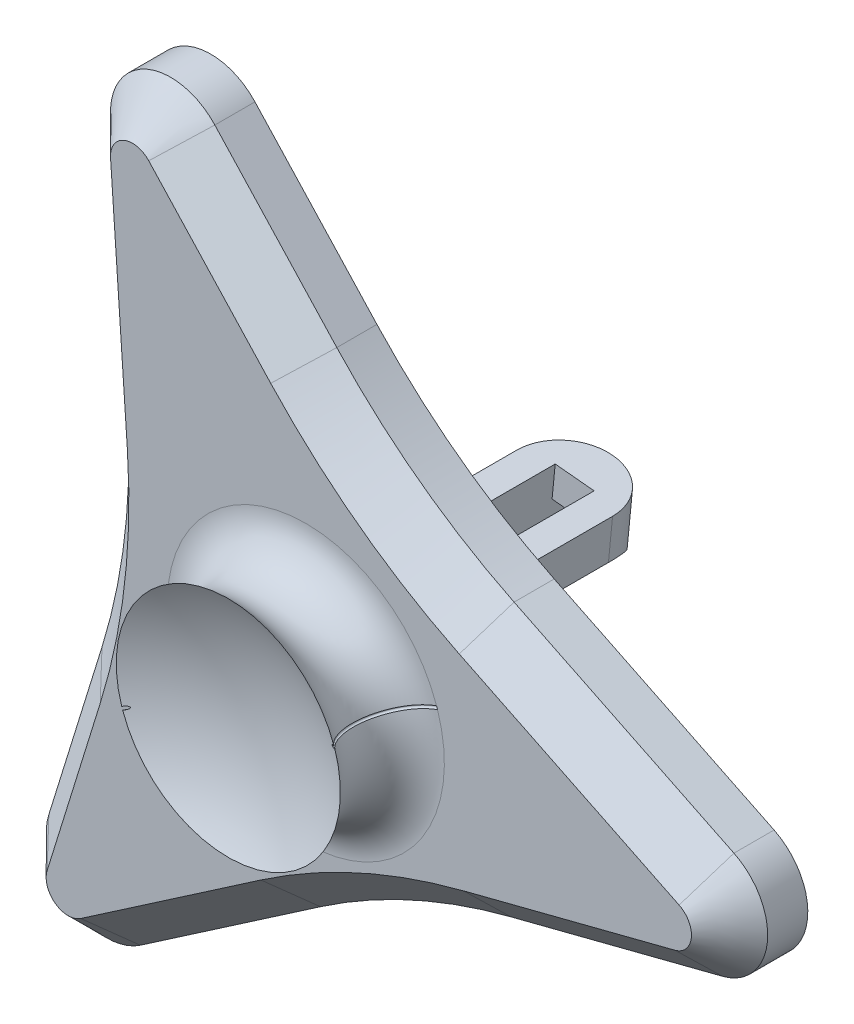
ISO-10303-21;
HEADER;
FILE_DESCRIPTION(('STEP AP214'),'2;1');
FILE_NAME('part.step','',(''),(''),'','','');
FILE_SCHEMA(('AUTOMOTIVE_DESIGN { 1 0 10303 214 1 1 1 1 }'));
ENDSEC;
DATA;
#1=APPLICATION_CONTEXT('core data for automotive mechanical design processes');
#2=APPLICATION_PROTOCOL_DEFINITION('international standard','automotive_design',2000,#1);
#3=PRODUCT_CONTEXT('',#1,'mechanical');
#4=PRODUCT('Part','Part','',(#3));
#5=PRODUCT_RELATED_PRODUCT_CATEGORY('part','',(#4));
#6=PRODUCT_DEFINITION_FORMATION('','',#4);
#7=PRODUCT_DEFINITION_CONTEXT('part definition',#1,'design');
#8=PRODUCT_DEFINITION('design','',#6,#7);
#9=PRODUCT_DEFINITION_SHAPE('','',#8);
#10=(LENGTH_UNIT() NAMED_UNIT(*) SI_UNIT(.MILLI.,.METRE.));
#11=(NAMED_UNIT(*) PLANE_ANGLE_UNIT() SI_UNIT($,.RADIAN.));
#12=(NAMED_UNIT(*) SI_UNIT($,.STERADIAN.) SOLID_ANGLE_UNIT());
#13=UNCERTAINTY_MEASURE_WITH_UNIT(LENGTH_MEASURE(1.E-05),#10,'distance_accuracy_value','');
#14=(GEOMETRIC_REPRESENTATION_CONTEXT(3) GLOBAL_UNCERTAINTY_ASSIGNED_CONTEXT((#13)) GLOBAL_UNIT_ASSIGNED_CONTEXT((#10,
#11,#12)) REPRESENTATION_CONTEXT('',''));
#15=CARTESIAN_POINT('',(0.,0.,0.));
#16=DIRECTION('',(0.,0.,1.));
#17=DIRECTION('',(1.,0.,0.));
#18=AXIS2_PLACEMENT_3D('',#15,#16,#17);
#19=CARTESIAN_POINT('',(0.,0.,12.1133713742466));
#20=DIRECTION('',(0.,0.,-1.));
#21=DIRECTION('',(-1.,0.,0.));
#22=AXIS2_PLACEMENT_3D('',#19,#20,#21);
#23=TOROIDAL_SURFACE('',#22,13.8133713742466,4.31337137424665);
#24=CARTESIAN_POINT('',(0.,0.,15.526094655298));
#25=DIRECTION('',(0.,0.,-1.));
#26=DIRECTION('',(-1.,0.,0.));
#27=AXIS2_PLACEMENT_3D('',#24,#25,#26);
#28=CIRCLE('',#27,11.1754759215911);
#29=CARTESIAN_POINT('',(-10.5364329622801,-3.7248949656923,15.526094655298));
#30=VERTEX_POINT('',#29);
#31=CARTESIAN_POINT('',(10.6326196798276,3.44073550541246,15.526094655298));
#32=VERTEX_POINT('',#31);
#33=EDGE_CURVE('E60',#30,#32,#28,.F.);
#34=ORIENTED_EDGE('',*,*,#33,.F.);
#35=CARTESIAN_POINT('',(-10.9804494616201,-3.87519308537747,15.8416240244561));
#36=CARTESIAN_POINT('',(-10.9394950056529,-3.86133014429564,15.816468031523));
#37=CARTESIAN_POINT('',(-10.8989642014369,-3.84761060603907,15.7905685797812));
#38=CARTESIAN_POINT('',(-10.8187381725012,-3.82045436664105,15.7372696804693));
#39=CARTESIAN_POINT('',(-10.7790438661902,-3.80701797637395,15.7098686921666));
#40=CARTESIAN_POINT('',(-10.5811781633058,-3.74004108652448,15.5680167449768));
#41=CARTESIAN_POINT('',(-10.4299847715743,-3.68886258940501,15.4423632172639));
#42=CARTESIAN_POINT('',(-10.1457199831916,-3.59263977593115,15.1697980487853));
#43=CARTESIAN_POINT('',(-10.012670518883,-3.54760288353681,15.0228611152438));
#44=CARTESIAN_POINT('',(-9.76751112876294,-3.46461702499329,14.7107729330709));
#45=CARTESIAN_POINT('',(-9.65538802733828,-3.42666359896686,14.5456332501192));
#46=CARTESIAN_POINT('',(-9.45423376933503,-3.35857327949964,14.2003844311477));
#47=CARTESIAN_POINT('',(-9.36520424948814,-3.32843694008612,14.0202742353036));
#48=CARTESIAN_POINT('',(-9.19696931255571,-3.27148967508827,13.6121073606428));
#49=CARTESIAN_POINT('',(-9.12310480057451,-3.24648663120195,13.3815698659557));
#50=CARTESIAN_POINT('',(-9.01306869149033,-3.20923953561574,12.9105942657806));
#51=CARTESIAN_POINT('',(-8.97691653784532,-3.19700206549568,12.670151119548));
#52=CARTESIAN_POINT('',(-8.94337628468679,-3.18564872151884,12.1863305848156));
#53=CARTESIAN_POINT('',(-8.94597681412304,-3.18652899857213,11.9429540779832));
#54=CARTESIAN_POINT('',(-8.9898454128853,-3.20137847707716,11.4601484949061));
#55=CARTESIAN_POINT('',(-9.03110891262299,-3.21534613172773,11.220718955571));
#56=CARTESIAN_POINT('',(-9.15112236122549,-3.2559705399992,10.7525703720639));
#57=CARTESIAN_POINT('',(-9.22987231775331,-3.28262729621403,10.5238513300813));
#58=CARTESIAN_POINT('',(-9.42262823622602,-3.3478748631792,10.0836019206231));
#59=CARTESIAN_POINT('',(-9.53663637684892,-3.38646641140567,9.87207261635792));
#60=CARTESIAN_POINT('',(-9.79668060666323,-3.47449082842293,9.47220295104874));
#61=CARTESIAN_POINT('',(-9.94271955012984,-3.52392466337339,9.2838646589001));
#62=CARTESIAN_POINT('',(-10.2626590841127,-3.632223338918,8.93575870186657));
#63=CARTESIAN_POINT('',(-10.4365572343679,-3.69108735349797,8.77598853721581));
#64=CARTESIAN_POINT('',(-10.807318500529,-3.81658885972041,8.48950734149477));
#65=CARTESIAN_POINT('',(-11.0041855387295,-3.8832276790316,8.36280196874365));
#66=CARTESIAN_POINT('',(-11.4152720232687,-4.02237896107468,8.14608285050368));
#67=CARTESIAN_POINT('',(-11.6294908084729,-4.09489120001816,8.05606770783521));
#68=CARTESIAN_POINT('',(-12.0415355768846,-4.23436670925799,7.92413992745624));
#69=CARTESIAN_POINT('',(-12.2380359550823,-4.3008812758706,7.87760212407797));
#70=CARTESIAN_POINT('',(-12.5358723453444,-4.40169763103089,7.8310222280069));
#71=CARTESIAN_POINT('',(-12.6356805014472,-4.43548226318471,7.81936672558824));
#72=CARTESIAN_POINT('',(-12.8358509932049,-4.5032391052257,7.80383718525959));
#73=CARTESIAN_POINT('',(-12.9362133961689,-4.53721133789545,7.7999641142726));
#74=CARTESIAN_POINT('',(-13.0366078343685,-4.57119441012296,7.80000023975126));
#75=B_SPLINE_CURVE_WITH_KNOTS('',3,(#35,#36,#37,#38,#39,#40,#41,#42,#43,#44,#45,#46,#47,#48,#49,
#50,#51,#52,#53,#54,#55,#56,#57,#58,#59,#60,#61,#62,#63,#64,#65,#66,#67,#68,#69,#70,#71,#72,#73,
#74),.UNSPECIFIED.,.F.,.F.,(4,2,2,2,2,2,2,2,2,2,2,2,2,2,2,2,2,2,2,4),(0.,0.15003512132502,
0.300227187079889,0.907381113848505,1.51526258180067,2.12276001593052,2.73030049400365,
3.45685399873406,4.18378190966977,4.91049652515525,5.63712526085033,6.36375414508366,
7.09042793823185,7.81716651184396,8.54384146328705,9.27064068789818,9.9974122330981,
10.6328010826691,10.9505899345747,11.268418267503),.UNSPECIFIED.);
#76=CARTESIAN_POINT('',(-13.0352455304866,-4.57073327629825,7.8));
#77=VERTEX_POINT('',#76);
#78=EDGE_CURVE('E53',#30,#77,#75,.T.);
#79=ORIENTED_EDGE('',*,*,#78,.T.);
#80=CARTESIAN_POINT('',(0.,0.,7.8));
#81=DIRECTION('',(0.,0.,-1.));
#82=DIRECTION('',(-1.,0.,0.));
#83=AXIS2_PLACEMENT_3D('',#80,#81,#82);
#84=CIRCLE('',#83,13.8133713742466);
#85=CARTESIAN_POINT('',(13.1314330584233,4.28657142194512,7.8));
#86=VERTEX_POINT('',#85);
#87=EDGE_CURVE('E573',#86,#77,#84,.T.);
#88=ORIENTED_EDGE('',*,*,#87,.F.);
#89=CARTESIAN_POINT('',(11.0766364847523,3.59103272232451,15.8416240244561));
#90=CARTESIAN_POINT('',(11.0356820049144,3.57716985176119,15.8164680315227));
#91=CARTESIAN_POINT('',(10.9951511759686,3.56345038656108,15.7905685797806));
#92=CARTESIAN_POINT('',(10.9149250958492,3.5362942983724,15.7372696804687));
#93=CARTESIAN_POINT('',(10.8752307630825,3.52285798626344,15.7098686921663));
#94=CARTESIAN_POINT('',(10.6773649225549,3.45588150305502,15.5680167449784));
#95=CARTESIAN_POINT('',(10.5261714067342,3.40470337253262,15.4423632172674));
#96=CARTESIAN_POINT('',(10.2419063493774,3.30848135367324,15.1697980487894));
#97=CARTESIAN_POINT('',(10.1088567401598,3.26344488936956,15.022861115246));
#98=CARTESIAN_POINT('',(9.86369705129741,3.18045991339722,14.7107729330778));
#99=CARTESIAN_POINT('',(9.75157379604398,3.14250694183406,14.5456332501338));
#100=CARTESIAN_POINT('',(9.55041923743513,3.07441751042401,14.2003844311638));
#101=CARTESIAN_POINT('',(9.46138957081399,3.04428160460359,14.020274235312));
#102=CARTESIAN_POINT('',(9.29315433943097,2.9873352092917,13.6121073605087));
#103=CARTESIAN_POINT('',(9.21928968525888,2.96233258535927,13.3815698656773));
#104=CARTESIAN_POINT('',(9.10925335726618,2.92508613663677,12.9105942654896));
#105=CARTESIAN_POINT('',(9.07310112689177,2.91284889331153,12.6701511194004));
#106=CARTESIAN_POINT('',(9.03956080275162,2.90149575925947,12.1863305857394));
#107=CARTESIAN_POINT('',(9.04216133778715,2.90237601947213,11.9429540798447));
#108=CARTESIAN_POINT('',(9.08603002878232,2.91722522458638,11.4601484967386));
#109=CARTESIAN_POINT('',(9.12729361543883,2.93119262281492,11.2207189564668));
#110=CARTESIAN_POINT('',(9.24730730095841,2.97181633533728,10.7525703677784));
#111=CARTESIAN_POINT('',(9.32605740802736,2.99847265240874,10.5238513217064));
#112=CARTESIAN_POINT('',(9.51881365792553,3.06371924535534,10.0836019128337));
#113=CARTESIAN_POINT('',(9.63282197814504,3.10231025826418,9.87207261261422));
#114=CARTESIAN_POINT('',(9.89286655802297,3.19033359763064,9.47220296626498));
#115=CARTESIAN_POINT('',(10.0389056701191,3.23976688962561,9.28386468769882));
#116=CARTESIAN_POINT('',(10.3588455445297,3.3480645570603,8.93575872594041));
#117=CARTESIAN_POINT('',(10.5327438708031,3.40692810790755,8.77598854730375));
#118=CARTESIAN_POINT('',(10.9035054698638,3.53242880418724,8.48950730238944));
#119=CARTESIAN_POINT('',(11.1003726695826,3.59906727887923,8.36280190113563));
#120=CARTESIAN_POINT('',(11.5114594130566,3.73821798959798,8.14608279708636));
#121=CARTESIAN_POINT('',(11.725678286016,3.81072999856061,8.05606767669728));
#122=CARTESIAN_POINT('',(12.1376608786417,3.95018409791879,7.92415980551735));
#123=CARTESIAN_POINT('',(12.3340962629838,4.01667654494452,7.87763221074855));
#124=CARTESIAN_POINT('',(12.6318340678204,4.11745941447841,7.83105243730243));
#125=CARTESIAN_POINT('',(12.7316090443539,4.15123278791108,7.81939444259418));
#126=CARTESIAN_POINT('',(12.9317133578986,4.21896719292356,7.80385481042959));
#127=CARTESIAN_POINT('',(13.0320427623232,4.25292824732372,7.79997414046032));
#128=CARTESIAN_POINT('',(13.1324045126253,4.28690025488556,7.80000012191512));
#129=B_SPLINE_CURVE_WITH_KNOTS('',3,(#89,#90,#91,#92,#93,#94,#95,#96,#97,#98,#99,#100,#101,#102,
#103,#104,#105,#106,#107,#108,#109,#110,#111,#112,#113,#114,#115,#116,#117,#118,#119,#120,#121,
#122,#123,#124,#125,#126,#127,#128),.UNSPECIFIED.,.F.,.F.,(4,2,2,2,2,2,2,2,2,2,2,2,2,2,2,2,2,2,
2,4),(0.,0.150035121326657,0.30022718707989,0.907381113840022,1.51526258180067,2.12276001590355,
2.73030049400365,3.45685399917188,4.18378190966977,4.91049652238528,5.63712526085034,
6.36375415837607,7.09042793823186,7.81716645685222,8.54384146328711,9.27064089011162,
9.99741223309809,10.6325959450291,10.9502813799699,11.2680063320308),.UNSPECIFIED.);
#130=EDGE_CURVE('E380',#32,#86,#129,.T.);
#131=ORIENTED_EDGE('',*,*,#130,.F.);
#132=EDGE_LOOP('',(#34,#79,#88,#131));
#133=FACE_BOUND('',#132,.T.);
#134=ADVANCED_FACE('F38',(#133),#23,.F.);
#135=CARTESIAN_POINT('',(0.,0.,15.526094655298));
#136=DIRECTION('',(0.,0.,-1.));
#137=DIRECTION('',(-1.,0.,0.));
#138=AXIS2_PLACEMENT_3D('',#135,#136,#137);
#139=CIRCLE('',#138,11.1754759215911);
#140=CARTESIAN_POINT('',(10.53643296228,3.72489496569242,15.526094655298));
#141=VERTEX_POINT('',#140);
#142=CARTESIAN_POINT('',(-10.6326196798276,-3.44073550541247,15.526094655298));
#143=VERTEX_POINT('',#142);
#144=EDGE_CURVE('E368',#141,#143,#139,.F.);
#145=ORIENTED_EDGE('',*,*,#144,.F.);
#146=CARTESIAN_POINT('',(13.0366078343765,4.57119441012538,7.80000023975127));
#147=CARTESIAN_POINT('',(12.9892259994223,4.55515586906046,7.79998517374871));
#148=CARTESIAN_POINT('',(12.9418559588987,4.53912131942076,7.80083765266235));
#149=CARTESIAN_POINT('',(12.8471231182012,4.50705466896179,7.80428275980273));
#150=CARTESIAN_POINT('',(12.7997603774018,4.49102258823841,7.80687720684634));
#151=CARTESIAN_POINT('',(12.5611603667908,4.41025752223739,7.82435997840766));
#152=CARTESIAN_POINT('',(12.3706144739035,4.34575854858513,7.85263608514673));
#153=CARTESIAN_POINT('',(11.9950519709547,4.21863219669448,7.93718448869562));
#154=CARTESIAN_POINT('',(11.8100422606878,4.1560071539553,7.99349029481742));
#155=CARTESIAN_POINT('',(11.4494372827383,4.03394376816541,8.1329631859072));
#156=CARTESIAN_POINT('',(11.2738361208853,3.97450342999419,8.21611321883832));
#157=CARTESIAN_POINT('',(10.9354531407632,3.85996199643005,8.4076131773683));
#158=CARTESIAN_POINT('',(10.7726722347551,3.80486120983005,8.51596489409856));
#159=CARTESIAN_POINT('',(10.4327214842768,3.6897889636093,8.77933564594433));
#160=CARTESIAN_POINT('',(10.2589869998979,3.63098034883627,8.93933922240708));
#161=CARTESIAN_POINT('',(9.93937424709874,3.52279228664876,9.28792878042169));
#162=CARTESIAN_POINT('',(9.79351039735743,3.47341771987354,9.47652946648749));
#163=CARTESIAN_POINT('',(9.53388105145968,3.38553373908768,9.8768702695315));
#164=CARTESIAN_POINT('',(9.42010738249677,3.3470215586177,10.0886044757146));
#165=CARTESIAN_POINT('',(9.22786548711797,3.28194798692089,10.5292078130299));
#166=CARTESIAN_POINT('',(9.14939307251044,3.25538517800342,10.7580749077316));
#167=CARTESIAN_POINT('',(9.02996501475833,3.21495892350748,11.2264522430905));
#168=CARTESIAN_POINT('',(8.98900642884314,3.20109448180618,11.4659616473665));
#169=CARTESIAN_POINT('',(8.94575905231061,3.18645528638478,11.9488553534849));
#170=CARTESIAN_POINT('',(8.94347261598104,3.18568132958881,12.1922398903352));
#171=CARTESIAN_POINT('',(8.97763908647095,3.19724664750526,12.6759424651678));
#172=CARTESIAN_POINT('',(9.01408937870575,3.2095850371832,12.9162607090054));
#173=CARTESIAN_POINT('',(9.12468481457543,3.24702146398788,13.3870047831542));
#174=CARTESIAN_POINT('',(9.19882663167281,3.27211837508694,13.6174314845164));
#175=CARTESIAN_POINT('',(9.38270358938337,3.33436043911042,14.0618925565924));
#176=CARTESIAN_POINT('',(9.49244171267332,3.37150660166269,14.2759255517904));
#177=CARTESIAN_POINT('',(9.74439314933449,3.45679164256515,14.6815033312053));
#178=CARTESIAN_POINT('',(9.88660525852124,3.50493011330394,14.8730489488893));
#179=CARTESIAN_POINT('',(10.1797838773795,3.60417031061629,15.2058743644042));
#180=CARTESIAN_POINT('',(10.327401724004,3.65413853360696,15.3504461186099));
#181=CARTESIAN_POINT('',(10.5625605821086,3.73373908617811,15.5488748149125));
#182=CARTESIAN_POINT('',(10.6432484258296,3.76105166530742,15.6119541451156));
#183=CARTESIAN_POINT('',(10.8088102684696,3.81709380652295,15.7316842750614));
#184=CARTESIAN_POINT('',(10.8936847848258,3.84582354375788,15.7883342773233));
#185=CARTESIAN_POINT('',(10.9804494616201,3.87519308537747,15.8416240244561));
#186=B_SPLINE_CURVE_WITH_KNOTS('',3,(#146,#147,#148,#149,#150,#151,#152,#153,#154,#155,#156,
#157,#158,#159,#160,#161,#162,#163,#164,#165,#166,#167,#168,#169,#170,#171,#172,#173,#174,#175,
#176,#177,#178,#179,#180,#181,#182,#183,#184,#185),.UNSPECIFIED.,.F.,.F.,(4,2,2,2,2,2,2,2,2,2,2,
2,2,2,2,2,2,2,2,4),(0.,0.150035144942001,0.300227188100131,0.907380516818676,1.51526144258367,
2.12275698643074,2.73029571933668,3.45693909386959,4.18395738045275,4.91079034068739,
5.63753704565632,6.36422673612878,7.09096066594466,7.81764554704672,8.54426630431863,
9.27094796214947,9.99760267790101,10.6328970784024,10.9506377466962,11.2684177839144),.UNSPECIFIED.);
#187=CARTESIAN_POINT('',(13.0352455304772,4.57073327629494,7.8));
#188=VERTEX_POINT('',#187);
#189=EDGE_CURVE('E375',#188,#141,#186,.T.);
#190=ORIENTED_EDGE('',*,*,#189,.F.);
#191=CARTESIAN_POINT('',(-13.1314330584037,-4.28657142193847,7.8));
#192=VERTEX_POINT('',#191);
#193=EDGE_CURVE('E725',#192,#188,#84,.T.);
#194=ORIENTED_EDGE('',*,*,#193,.F.);
#195=CARTESIAN_POINT('',(-13.1324045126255,-4.28690025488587,7.80000012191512));
#196=CARTESIAN_POINT('',(-13.0850226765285,-4.27086171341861,7.79998984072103));
#197=CARTESIAN_POINT('',(-13.0376527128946,-4.2548271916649,7.80084710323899));
#198=CARTESIAN_POINT('',(-12.9429201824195,-4.22276065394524,7.80430177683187));
#199=CARTESIAN_POINT('',(-12.8955576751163,-4.2067286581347,7.80690100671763));
#200=CARTESIAN_POINT('',(-12.6569592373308,-4.12596416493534,7.82440787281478));
#201=CARTESIAN_POINT('',(-12.466415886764,-4.06146611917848,7.85270322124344));
#202=CARTESIAN_POINT('',(-12.0908609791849,-3.93434255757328,7.93728954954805));
#203=CARTESIAN_POINT('',(-11.9058563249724,-3.87171937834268,7.99361403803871));
#204=CARTESIAN_POINT('',(-11.5452638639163,-3.74966062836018,8.13312334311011));
#205=CARTESIAN_POINT('',(-11.3696701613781,-3.69022306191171,8.21629110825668));
#206=CARTESIAN_POINT('',(-11.0313043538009,-3.57568803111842,8.4078252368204));
#207=CARTESIAN_POINT('',(-10.8685331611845,-3.52059087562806,8.51619339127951));
#208=CARTESIAN_POINT('',(-10.5286060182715,-3.4055274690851,8.77959847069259));
#209=CARTESIAN_POINT('',(-10.3548858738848,-3.34672423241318,8.93961958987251));
#210=CARTESIAN_POINT('',(-10.0353043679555,-3.2385478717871,9.28824142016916));
#211=CARTESIAN_POINT('',(-9.88945742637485,-3.18917962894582,9.47685683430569));
#212=CARTESIAN_POINT('',(-9.62986399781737,-3.10130900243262,9.8772238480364));
#213=CARTESIAN_POINT('',(-9.51610933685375,-3.06280385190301,10.0889695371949));
#214=CARTESIAN_POINT('',(-9.32390704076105,-2.99774476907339,10.5295922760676));
#215=CARTESIAN_POINT('',(-9.24545521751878,-2.97118941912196,10.7584672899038));
#216=CARTESIAN_POINT('',(-9.12606936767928,-2.93077822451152,11.2268566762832));
#217=CARTESIAN_POINT('',(-9.08513239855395,-2.91692138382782,11.4663702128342));
#218=CARTESIAN_POINT('',(-9.04192868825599,-2.90229726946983,11.9492682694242));
#219=CARTESIAN_POINT('',(-9.03966429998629,-2.9015307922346,12.1926530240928));
#220=CARTESIAN_POINT('',(-9.07387466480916,-2.91311072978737,12.6763521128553));
#221=CARTESIAN_POINT('',(-9.11034680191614,-2.925456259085,12.9166666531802));
#222=CARTESIAN_POINT('',(-9.22098510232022,-2.96290647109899,13.3873995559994));
#223=CARTESIAN_POINT('',(-9.2951479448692,-2.98801002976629,13.6178187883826));
#224=CARTESIAN_POINT('',(-9.47906551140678,-3.05026478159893,14.0622613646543));
#225=CARTESIAN_POINT('',(-9.58882322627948,-3.08741698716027,14.2762833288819));
#226=CARTESIAN_POINT('',(-9.8408118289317,-3.17271341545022,14.68183569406));
#227=CARTESIAN_POINT('',(-9.98304149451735,-3.22085722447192,14.8733669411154));
#228=CARTESIAN_POINT('',(-10.276206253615,-3.32009166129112,15.2061124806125));
#229=CARTESIAN_POINT('',(-10.4237860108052,-3.37004651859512,15.3506259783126));
#230=CARTESIAN_POINT('',(-10.6588778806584,-3.44962375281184,15.5489784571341));
#231=CARTESIAN_POINT('',(-10.7395416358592,-3.47692797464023,15.6120341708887));
#232=CARTESIAN_POINT('',(-10.9050524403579,-3.53295245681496,15.7317211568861));
#233=CARTESIAN_POINT('',(-10.9899000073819,-3.56167289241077,15.7883516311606));
#234=CARTESIAN_POINT('',(-11.0766364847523,-3.59103272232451,15.8416240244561));
#235=B_SPLINE_CURVE_WITH_KNOTS('',3,(#195,#196,#197,#198,#199,#200,#201,#202,#203,#204,#205,
#206,#207,#208,#209,#210,#211,#212,#213,#214,#215,#216,#217,#218,#219,#220,#221,#222,#223,#224,
#225,#226,#227,#228,#229,#230,#231,#232,#233,#234),.UNSPECIFIED.,.F.,.F.,(4,2,2,2,2,2,2,2,2,2,2,
2,2,2,2,2,2,2,2,4),(0.,0.150035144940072,0.300227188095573,0.907380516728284,1.51526144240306,
2.122756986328,2.73029571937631,3.45693908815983,4.18395736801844,4.91079030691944,
5.63753699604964,6.36422667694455,7.09096057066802,7.81764538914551,8.5442661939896,
9.27094806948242,9.99760259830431,10.6326918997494,10.9503291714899,11.2680058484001),.UNSPECIFIED.);
#236=EDGE_CURVE('E377',#192,#143,#235,.T.);
#237=ORIENTED_EDGE('',*,*,#236,.T.);
#238=EDGE_LOOP('',(#145,#190,#194,#237));
#239=FACE_BOUND('',#238,.T.);
#240=ADVANCED_FACE('F373',(#239),#23,.F.);
#241=CARTESIAN_POINT('',(-13.0841107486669,-4.42891348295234,12.1133713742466));
#242=DIRECTION('',(-0.320625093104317,0.947206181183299,0.));
#243=DIRECTION('',(-0.947206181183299,-0.320625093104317,0.));
#244=AXIS2_PLACEMENT_3D('',#241,#242,#243);
#245=TOROIDAL_SURFACE('',#244,4.31337137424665,0.15);
#246=CARTESIAN_POINT('',(-11.1557785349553,-3.62413213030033,15.8416240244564));
#247=CARTESIAN_POINT('',(-11.1352629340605,-3.61735606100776,15.828926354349));
#248=CARTESIAN_POINT('',(-11.1147522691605,-3.61049907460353,15.8162639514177));
#249=CARTESIAN_POINT('',(-11.073739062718,-3.59662515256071,15.791009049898));
#250=CARTESIAN_POINT('',(-11.0532365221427,-3.58960820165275,15.7784165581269));
#251=CARTESIAN_POINT('',(-10.9919391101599,-3.56838961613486,15.7408659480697));
#252=CARTESIAN_POINT('',(-10.9511595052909,-3.55395580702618,15.7160140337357));
#253=CARTESIAN_POINT('',(-10.8696035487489,-3.52475035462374,15.6666238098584));
#254=CARTESIAN_POINT('',(-10.8288272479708,-3.50997912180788,15.6420851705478));
#255=CARTESIAN_POINT('',(-10.7470581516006,-3.48057841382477,15.5932858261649));
#256=CARTESIAN_POINT('',(-10.706065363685,-3.46594893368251,15.5690251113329));
#257=CARTESIAN_POINT('',(-10.6232595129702,-3.43739765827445,15.5205601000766));
#258=CARTESIAN_POINT('',(-10.581442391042,-3.42348338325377,15.4963582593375));
#259=CARTESIAN_POINT('',(-10.4971167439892,-3.3974818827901,15.4482758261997));
#260=CARTESIAN_POINT('',(-10.454609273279,-3.38539211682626,15.4243948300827));
#261=CARTESIAN_POINT('',(-10.3897577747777,-3.36973417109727,15.3887047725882));
#262=CARTESIAN_POINT('',(-10.3678056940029,-3.36490343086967,15.3767490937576));
#263=CARTESIAN_POINT('',(-10.3235242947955,-3.3564646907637,15.3529429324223));
#264=CARTESIAN_POINT('',(-10.3011940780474,-3.35286022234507,15.3410928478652));
#265=CARTESIAN_POINT('',(-10.2564449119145,-3.34747396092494,15.3177420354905));
#266=CARTESIAN_POINT('',(-10.2340302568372,-3.34567077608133,15.3062388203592));
#267=CARTESIAN_POINT('',(-10.2002554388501,-3.34511502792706,15.2893283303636));
#268=CARTESIAN_POINT('',(-10.1889964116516,-3.34528525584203,15.2837606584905));
#269=CARTESIAN_POINT('',(-10.1664572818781,-3.34660418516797,15.2727974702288));
#270=CARTESIAN_POINT('',(-10.1551772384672,-3.34775137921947,15.2674017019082));
#271=CARTESIAN_POINT('',(-10.1357449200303,-3.35097886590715,15.2583301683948));
#272=CARTESIAN_POINT('',(-10.1275711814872,-3.35272321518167,15.2545836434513));
#273=CARTESIAN_POINT('',(-10.1114154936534,-3.3572952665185,15.2473741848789));
#274=CARTESIAN_POINT('',(-10.1034328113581,-3.36011772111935,15.2439099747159));
#275=CARTESIAN_POINT('',(-10.0923284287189,-3.36536596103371,15.2393157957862));
#276=CARTESIAN_POINT('',(-10.0889883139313,-3.36712851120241,15.2379651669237));
#277=CARTESIAN_POINT('',(-10.0824745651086,-3.37105193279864,15.2354131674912));
#278=CARTESIAN_POINT('',(-10.0793012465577,-3.37321352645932,15.2342120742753));
#279=CARTESIAN_POINT('',(-10.073193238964,-3.37804655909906,15.2320128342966));
#280=CARTESIAN_POINT('',(-10.0702629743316,-3.38072533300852,15.2310180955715));
#281=CARTESIAN_POINT('',(-10.0648975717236,-3.38662398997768,15.229362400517));
#282=CARTESIAN_POINT('',(-10.0624602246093,-3.38984133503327,15.2286999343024));
#283=CARTESIAN_POINT('',(-10.0590012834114,-3.39561856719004,15.2279613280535));
#284=CARTESIAN_POINT('',(-10.0577782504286,-3.39804256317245,15.2277635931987));
#285=CARTESIAN_POINT('',(-10.0557137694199,-3.40305604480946,15.2275830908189));
#286=CARTESIAN_POINT('',(-10.0548721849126,-3.40564547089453,15.2276002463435));
#287=CARTESIAN_POINT('',(-10.0535949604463,-3.41090656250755,15.227847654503));
#288=CARTESIAN_POINT('',(-10.0531585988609,-3.41357807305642,15.2280775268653));
#289=CARTESIAN_POINT('',(-10.0526686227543,-3.41893246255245,15.2287272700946));
#290=CARTESIAN_POINT('',(-10.0526153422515,-3.42161534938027,15.2291473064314));
#291=CARTESIAN_POINT('',(-10.0528968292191,-3.42814337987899,15.230371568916));
#292=CARTESIAN_POINT('',(-10.0534186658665,-3.43196345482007,15.2312636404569));
#293=CARTESIAN_POINT('',(-10.0550034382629,-3.43942369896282,15.2332845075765));
#294=CARTESIAN_POINT('',(-10.0560678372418,-3.44306335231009,15.2344139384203));
#295=CARTESIAN_POINT('',(-10.0595662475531,-3.45287317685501,15.2377690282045));
#296=CARTESIAN_POINT('',(-10.0624234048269,-3.45882965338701,15.240168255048));
#297=CARTESIAN_POINT('',(-10.0688788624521,-3.47018821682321,15.245243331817));
#298=CARTESIAN_POINT('',(-10.0724792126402,-3.47558870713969,15.2479199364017));
#299=CARTESIAN_POINT('',(-10.0819169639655,-3.48831138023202,15.2547027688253));
#300=CARTESIAN_POINT('',(-10.0880238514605,-3.49538127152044,15.2589024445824));
#301=CARTESIAN_POINT('',(-10.1008498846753,-3.50881948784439,15.2674983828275));
#302=CARTESIAN_POINT('',(-10.1075703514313,-3.51518623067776,15.2718950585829));
#303=CARTESIAN_POINT('',(-10.1283889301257,-3.53352715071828,15.2853017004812));
#304=CARTESIAN_POINT('',(-10.1430907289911,-3.54467926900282,15.2944914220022));
#305=CARTESIAN_POINT('',(-10.1723461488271,-3.56487348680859,15.312493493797));
#306=CARTESIAN_POINT('',(-10.1868493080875,-3.57400484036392,15.3212924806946));
#307=CARTESIAN_POINT('',(-10.2163330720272,-3.5913322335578,15.3390190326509));
#308=CARTESIAN_POINT('',(-10.2313138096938,-3.59952800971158,15.3479466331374));
#309=CARTESIAN_POINT('',(-10.2767983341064,-3.62308279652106,15.3749007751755));
#310=CARTESIAN_POINT('',(-10.3077765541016,-3.6373659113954,15.3930574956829));
#311=CARTESIAN_POINT('',(-10.3704675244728,-3.66416194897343,15.4296459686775));
#312=CARTESIAN_POINT('',(-10.4021824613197,-3.6766685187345,15.4480784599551));
#313=CARTESIAN_POINT('',(-10.4659099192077,-3.7004723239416,15.4850982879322));
#314=CARTESIAN_POINT('',(-10.4979220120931,-3.71177107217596,15.5036853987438));
#315=CARTESIAN_POINT('',(-10.574996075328,-3.73804727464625,15.5485332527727));
#316=CARTESIAN_POINT('',(-10.6201283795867,-3.75267660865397,15.5748736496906));
#317=CARTESIAN_POINT('',(-10.7103624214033,-3.78149350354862,15.6278932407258));
#318=CARTESIAN_POINT('',(-10.7554641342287,-3.79568085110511,15.6545725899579));
#319=CARTESIAN_POINT('',(-10.8446094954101,-3.82404762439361,15.7078012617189));
#320=CARTESIAN_POINT('',(-10.8886579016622,-3.83822289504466,15.7343447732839));
#321=CARTESIAN_POINT('',(-10.9544289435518,-3.85992165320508,15.7743988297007));
#322=CARTESIAN_POINT('',(-10.9762982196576,-3.86722577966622,15.7877874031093));
#323=CARTESIAN_POINT('',(-11.0199369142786,-3.88198413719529,15.8146453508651));
#324=CARTESIAN_POINT('',(-11.0417063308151,-3.8894383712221,15.8281147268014));
#325=CARTESIAN_POINT('',(-11.063424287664,-3.89696952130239,15.8416240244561));
#326=B_SPLINE_CURVE_WITH_KNOTS('',3,(#246,#247,#248,#249,#250,#251,#252,#253,#254,#255,#256,
#257,#258,#259,#260,#261,#262,#263,#264,#265,#266,#267,#268,#269,#270,#271,#272,#273,#274,#275,
#276,#277,#278,#279,#280,#281,#282,#283,#284,#285,#286,#287,#288,#289,#290,#291,#292,#293,#294,
#295,#296,#297,#298,#299,#300,#301,#302,#303,#304,#305,#306,#307,#308,#309,#310,#311,#312,#313,
#314,#315,#316,#317,#318,#319,#320,#321,#322,#323,#324,#325),.UNSPECIFIED.,.F.,.F.,(4,2,2,2,2,2,
2,2,2,2,2,2,2,2,2,2,2,2,2,2,2,2,2,2,2,2,2,2,2,2,2,2,2,2,2,2,2,2,2,4),(0.,0.0751817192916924,
0.150370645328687,0.300034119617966,0.44952431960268,0.599009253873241,0.749834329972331,
0.900447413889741,0.976800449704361,1.0533715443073,1.12902207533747,1.16668343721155,
1.20428679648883,1.23172813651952,1.25903757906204,1.27105128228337,1.28308694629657,
1.29530784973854,1.30747270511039,1.31560262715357,1.32372963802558,1.33184214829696,
1.3399617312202,1.35176599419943,1.36360226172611,1.38456876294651,1.40559388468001,
1.43624571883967,1.46696517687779,1.52867250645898,1.58644031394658,1.64422435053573,
1.76006276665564,1.87630552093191,1.99240093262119,2.15518896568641,2.31805439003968,
2.47808677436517,2.55807245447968,2.63805971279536),.UNSPECIFIED.);
#327=EDGE_CURVE('E1062',#143,#30,#326,.T.);
#328=ORIENTED_EDGE('',*,*,#327,.F.);
#329=ORIENTED_EDGE('',*,*,#236,.F.);
#330=CARTESIAN_POINT('',(-11.9956200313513,-4.06807601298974,7.8));
#331=CARTESIAN_POINT('',(-11.995948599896,-4.0657639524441,7.8));
#332=CARTESIAN_POINT('',(-11.996479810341,-4.06348058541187,7.8));
#333=CARTESIAN_POINT('',(-11.9979490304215,-4.05904770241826,7.8));
#334=CARTESIAN_POINT('',(-11.9988871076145,-4.05689820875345,7.8));
#335=CARTESIAN_POINT('',(-12.001117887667,-4.05280740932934,7.8));
#336=CARTESIAN_POINT('',(-12.0024089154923,-4.0508651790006,7.8));
#337=CARTESIAN_POINT('',(-12.0052744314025,-4.04720381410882,7.8));
#338=CARTESIAN_POINT('',(-12.0068491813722,-4.04548488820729,7.8));
#339=CARTESIAN_POINT('',(-12.0111553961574,-4.04136136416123,7.8));
#340=CARTESIAN_POINT('',(-12.0140385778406,-4.03911632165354,7.8));
#341=CARTESIAN_POINT('',(-12.0201095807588,-4.03508669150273,7.8));
#342=CARTESIAN_POINT('',(-12.023298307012,-4.03330353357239,7.8));
#343=CARTESIAN_POINT('',(-12.0329262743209,-4.02860091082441,7.8));
#344=CARTESIAN_POINT('',(-12.0396074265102,-4.02618569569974,7.8));
#345=CARTESIAN_POINT('',(-12.0532183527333,-4.02224385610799,7.8));
#346=CARTESIAN_POINT('',(-12.0601488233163,-4.02071996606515,7.8));
#347=CARTESIAN_POINT('',(-12.0787774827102,-4.0174716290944,7.8));
#348=CARTESIAN_POINT('',(-12.0905683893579,-4.01629303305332,7.8));
#349=CARTESIAN_POINT('',(-12.1142147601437,-4.01497735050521,7.8));
#350=CARTESIAN_POINT('',(-12.1260703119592,-4.014842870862,7.8));
#351=CARTESIAN_POINT('',(-12.149826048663,-4.01530647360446,7.8));
#352=CARTESIAN_POINT('',(-12.1617261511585,-4.01590831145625,7.8));
#353=CARTESIAN_POINT('',(-12.1854669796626,-4.01766015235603,7.8));
#354=CARTESIAN_POINT('',(-12.1973077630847,-4.01880943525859,7.8));
#355=CARTESIAN_POINT('',(-12.2364441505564,-4.02331111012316,7.8));
#356=CARTESIAN_POINT('',(-12.2636338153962,-4.02757563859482,7.8));
#357=CARTESIAN_POINT('',(-12.3177593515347,-4.03751153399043,7.8));
#358=CARTESIAN_POINT('',(-12.3446950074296,-4.0431839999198,7.8));
#359=CARTESIAN_POINT('',(-12.4252988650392,-4.06167101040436,7.8));
#360=CARTESIAN_POINT('',(-12.4786307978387,-4.07593451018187,7.8));
#361=CARTESIAN_POINT('',(-12.5847403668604,-4.10643755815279,7.8));
#362=CARTESIAN_POINT('',(-12.6375175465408,-4.12267861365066,7.8));
#363=CARTESIAN_POINT('',(-12.7426753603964,-4.15614997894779,7.8));
#364=CARTESIAN_POINT('',(-12.7950564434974,-4.17337888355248,7.8));
#365=CARTESIAN_POINT('',(-12.9104065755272,-4.21179841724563,7.8));
#366=CARTESIAN_POINT('',(-12.9733456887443,-4.23307739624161,7.8));
#367=CARTESIAN_POINT('',(-13.0992433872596,-4.27566745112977,7.8));
#368=CARTESIAN_POINT('',(-13.1622019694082,-4.29697853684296,7.8));
#369=CARTESIAN_POINT('',(-13.287954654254,-4.33957005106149,7.8));
#370=CARTESIAN_POINT('',(-13.3507487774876,-4.36085042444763,7.8));
#371=CARTESIAN_POINT('',(-13.4761390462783,-4.40394656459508,7.8));
#372=CARTESIAN_POINT('',(-13.5387352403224,-4.42576218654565,7.8));
#373=CARTESIAN_POINT('',(-13.6322154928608,-4.45972406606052,7.8));
#374=CARTESIAN_POINT('',(-13.6633208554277,-4.47125671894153,7.8));
#375=CARTESIAN_POINT('',(-13.7253080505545,-4.49494946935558,7.8));
#376=CARTESIAN_POINT('',(-13.7561897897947,-4.507109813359,7.8));
#377=CARTESIAN_POINT('',(-13.8177200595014,-4.53238600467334,7.8));
#378=CARTESIAN_POINT('',(-13.8483669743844,-4.54550580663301,7.8));
#379=CARTESIAN_POINT('',(-13.9090494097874,-4.57304716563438,7.8));
#380=CARTESIAN_POINT('',(-13.9390855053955,-4.58746742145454,7.8));
#381=CARTESIAN_POINT('',(-13.9834740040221,-4.61066866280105,7.8));
#382=CARTESIAN_POINT('',(-13.9982172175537,-4.61869976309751,7.8));
#383=CARTESIAN_POINT('',(-14.0273527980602,-4.63544332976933,7.8));
#384=CARTESIAN_POINT('',(-14.0417445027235,-4.64415696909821,7.8));
#385=CARTESIAN_POINT('',(-14.0698797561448,-4.66244129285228,7.8));
#386=CARTESIAN_POINT('',(-14.0836259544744,-4.67200790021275,7.8));
#387=CARTESIAN_POINT('',(-14.110139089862,-4.69239670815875,7.8));
#388=CARTESIAN_POINT('',(-14.1229094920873,-4.7032140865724,7.8));
#389=CARTESIAN_POINT('',(-14.1405554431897,-4.72106476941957,7.8));
#390=CARTESIAN_POINT('',(-14.146209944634,-4.72732076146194,7.8));
#391=CARTESIAN_POINT('',(-14.1565775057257,-4.74054919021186,7.8));
#392=CARTESIAN_POINT('',(-14.1612977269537,-4.7475155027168,7.8));
#393=CARTESIAN_POINT('',(-14.1664184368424,-4.75754317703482,7.8));
#394=CARTESIAN_POINT('',(-14.1676274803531,-4.76018542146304,7.8));
#395=CARTESIAN_POINT('',(-14.1697465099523,-4.76559464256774,7.8));
#396=CARTESIAN_POINT('',(-14.1706560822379,-4.76836178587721,7.8));
#397=CARTESIAN_POINT('',(-14.1720854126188,-4.77403580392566,7.8));
#398=CARTESIAN_POINT('',(-14.1726002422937,-4.77694397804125,7.8));
#399=CARTESIAN_POINT('',(-14.1730943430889,-4.78280488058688,7.8));
#400=CARTESIAN_POINT('',(-14.1730752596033,-4.78575744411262,7.8));
#401=CARTESIAN_POINT('',(-14.1724871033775,-4.7908728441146,7.8));
#402=CARTESIAN_POINT('',(-14.1720544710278,-4.79305129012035,7.8));
#403=CARTESIAN_POINT('',(-14.1708210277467,-4.79730147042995,7.8));
#404=CARTESIAN_POINT('',(-14.1700203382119,-4.79937323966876,7.8));
#405=CARTESIAN_POINT('',(-14.1680842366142,-4.80334561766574,7.8));
#406=CARTESIAN_POINT('',(-14.1669497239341,-4.80524666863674,7.8));
#407=CARTESIAN_POINT('',(-14.1644036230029,-4.80885246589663,7.8));
#408=CARTESIAN_POINT('',(-14.1629917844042,-4.81055703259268,7.8));
#409=CARTESIAN_POINT('',(-14.1591562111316,-4.81460816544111,7.8));
#410=CARTESIAN_POINT('',(-14.1565910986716,-4.81682018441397,7.8));
#411=CARTESIAN_POINT('',(-14.1511523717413,-4.82082411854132,7.8));
#412=CARTESIAN_POINT('',(-14.1482778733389,-4.82261478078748,7.8));
#413=CARTESIAN_POINT('',(-14.1398057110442,-4.82723761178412,7.8));
#414=CARTESIAN_POINT('',(-14.133982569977,-4.82964986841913,7.8));
#415=CARTESIAN_POINT('',(-14.1220739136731,-4.83367663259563,7.8));
#416=CARTESIAN_POINT('',(-14.115987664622,-4.83528872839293,7.8));
#417=CARTESIAN_POINT('',(-14.100087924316,-4.83873452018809,7.8));
#418=CARTESIAN_POINT('',(-14.0901842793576,-4.84014252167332,7.8));
#419=CARTESIAN_POINT('',(-14.0702849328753,-4.84206201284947,7.8));
#420=CARTESIAN_POINT('',(-14.060289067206,-4.84257133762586,7.8));
#421=CARTESIAN_POINT('',(-14.0301992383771,-4.84316195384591,7.8));
#422=CARTESIAN_POINT('',(-14.0100898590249,-4.84229326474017,7.8));
#423=CARTESIAN_POINT('',(-13.9684802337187,-4.83896827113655,7.8));
#424=CARTESIAN_POINT('',(-13.9469915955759,-4.8363953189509,7.8));
#425=CARTESIAN_POINT('',(-13.9041770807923,-4.8301086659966,7.8));
#426=CARTESIAN_POINT('',(-13.8828512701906,-4.82639452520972,7.8));
#427=CARTESIAN_POINT('',(-13.8190052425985,-4.81403056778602,7.8));
#428=CARTESIAN_POINT('',(-13.7767242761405,-4.80417177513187,7.8));
#429=CARTESIAN_POINT('',(-13.6926270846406,-4.7826229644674,7.8));
#430=CARTESIAN_POINT('',(-13.6508111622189,-4.77093182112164,7.8));
#431=CARTESIAN_POINT('',(-13.5675659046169,-4.74644623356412,7.8));
#432=CARTESIAN_POINT('',(-13.5261361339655,-4.73365325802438,7.8));
#433=CARTESIAN_POINT('',(-13.4416748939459,-4.70684735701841,7.8));
#434=CARTESIAN_POINT('',(-13.3986527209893,-4.69280554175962,7.8));
#435=CARTESIAN_POINT('',(-13.3127089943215,-4.66437032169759,7.8));
#436=CARTESIAN_POINT('',(-13.26978748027,-4.64997679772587,7.8));
#437=CARTESIAN_POINT('',(-13.1840629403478,-4.62109934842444,7.8));
#438=CARTESIAN_POINT('',(-13.1412598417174,-4.60661563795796,7.8));
#439=CARTESIAN_POINT('',(-13.0556553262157,-4.57764312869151,7.8));
#440=CARTESIAN_POINT('',(-13.0128539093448,-4.56315432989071,7.8));
#441=CARTESIAN_POINT('',(-12.9128009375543,-4.52928303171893,7.8));
#442=CARTESIAN_POINT('',(-12.855549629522,-4.50989988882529,7.8));
#443=CARTESIAN_POINT('',(-12.7411322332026,-4.4708094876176,7.8));
#444=CARTESIAN_POINT('',(-12.6839661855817,-4.45110210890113,7.8));
#445=CARTESIAN_POINT('',(-12.588971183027,-4.41739940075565,7.8));
#446=CARTESIAN_POINT('',(-12.5510429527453,-4.40368764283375,7.8));
#447=CARTESIAN_POINT('',(-12.4754799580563,-4.37548189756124,7.8));
#448=CARTESIAN_POINT('',(-12.4378451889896,-4.36098792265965,7.8));
#449=CARTESIAN_POINT('',(-12.3498871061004,-4.32548180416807,7.8));
#450=CARTESIAN_POINT('',(-12.2997570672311,-4.30397020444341,7.8));
#451=CARTESIAN_POINT('',(-12.2169968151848,-4.26430425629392,7.8));
#452=CARTESIAN_POINT('',(-12.1838537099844,-4.24724520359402,7.8));
#453=CARTESIAN_POINT('',(-12.1294009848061,-4.21566553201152,7.8));
#454=CARTESIAN_POINT('',(-12.1076144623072,-4.20200329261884,7.8));
#455=CARTESIAN_POINT('',(-12.0769231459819,-4.18001465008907,7.8));
#456=CARTESIAN_POINT('',(-12.0673045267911,-4.17269229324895,7.8));
#457=CARTESIAN_POINT('',(-12.0487258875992,-4.15727192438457,7.8));
#458=CARTESIAN_POINT('',(-12.0397641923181,-4.14917601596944,7.8));
#459=CARTESIAN_POINT('',(-12.0276460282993,-4.13662861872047,7.8));
#460=CARTESIAN_POINT('',(-12.0240180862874,-4.13263530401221,7.8));
#461=CARTESIAN_POINT('',(-12.0170882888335,-4.12434945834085,7.8));
#462=CARTESIAN_POINT('',(-12.0137874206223,-4.12005608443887,7.8));
#463=CARTESIAN_POINT('',(-12.0076476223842,-4.11105970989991,7.8));
#464=CARTESIAN_POINT('',(-12.0048155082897,-4.10635197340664,7.8));
#465=CARTESIAN_POINT('',(-11.9999933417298,-4.09651633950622,7.8));
#466=CARTESIAN_POINT('',(-11.9979989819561,-4.09139075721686,7.8));
#467=CARTESIAN_POINT('',(-11.9960052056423,-4.08314092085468,7.8));
#468=CARTESIAN_POINT('',(-11.9955130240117,-4.08014047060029,7.8));
#469=CARTESIAN_POINT('',(-11.9951091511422,-4.074102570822,7.8));
#470=CARTESIAN_POINT('',(-11.9951952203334,-4.07106530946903,7.8));
#471=CARTESIAN_POINT('',(-11.9956200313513,-4.06807601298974,7.8));
#472=B_SPLINE_CURVE_WITH_KNOTS('',3,(#330,#331,#332,#333,#334,#335,#336,#337,#338,#339,#340,
#341,#342,#343,#344,#345,#346,#347,#348,#349,#350,#351,#352,#353,#354,#355,#356,#357,#358,#359,
#360,#361,#362,#363,#364,#365,#366,#367,#368,#369,#370,#371,#372,#373,#374,#375,#376,#377,#378,
#379,#380,#381,#382,#383,#384,#385,#386,#387,#388,#389,#390,#391,#392,#393,#394,#395,#396,#397,
#398,#399,#400,#401,#402,#403,#404,#405,#406,#407,#408,#409,#410,#411,#412,#413,#414,#415,#416,
#417,#418,#419,#420,#421,#422,#423,#424,#425,#426,#427,#428,#429,#430,#431,#432,#433,#434,#435,
#436,#437,#438,#439,#440,#441,#442,#443,#444,#445,#446,#447,#448,#449,#450,#451,#452,#453,#454,
#455,#456,#457,#458,#459,#460,#461,#462,#463,#464,#465,#466,#467,#468,#469,#470,#471),
.UNSPECIFIED.,.T.,.F.,(4,2,2,2,2,2,2,2,2,2,2,2,2,2,2,2,2,2,2,2,2,2,2,2,2,2,2,2,2,2,2,2,2,2,2,2,
2,2,2,2,2,2,2,2,2,2,2,2,2,2,2,2,2,2,2,2,2,2,2,2,2,2,2,2,2,2,2,2,2,2,4),(0.,0.00699577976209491,
0.0139927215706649,0.020957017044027,0.0279277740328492,0.038827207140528,0.0497599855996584,
0.0709536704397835,0.0922120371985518,0.127668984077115,0.163214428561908,0.198941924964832,
0.23462255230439,0.317117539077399,0.399677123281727,0.565199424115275,0.730848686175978,
0.896267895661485,1.09558518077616,1.29498750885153,1.49389511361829,1.69274948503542,
1.79226873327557,1.89182736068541,1.9918223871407,2.09171844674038,2.14207355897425,
2.19251719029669,2.24273145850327,2.29275821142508,2.31802243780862,2.34308478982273,
2.3517884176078,2.36050402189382,2.36932674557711,2.37812228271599,2.38475430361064,
2.39138413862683,2.39799627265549,2.40461440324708,2.41471726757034,2.42484980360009,
2.44365258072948,2.46251169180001,2.49244443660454,2.52244919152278,2.58271969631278,
2.64761245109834,2.71253025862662,2.84269054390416,2.97293108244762,3.10300062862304,
3.23876531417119,3.37457665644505,3.51013830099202,3.64569996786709,3.82703077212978,
4.00843050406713,4.12941550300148,4.25039857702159,4.4139373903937,4.52566837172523,
4.60268060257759,4.63892425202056,4.67507200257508,4.69124546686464,4.70746634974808,
4.72390557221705,4.74025920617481,4.74933929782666,4.75838424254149),.UNSPECIFIED.);
#473=CARTESIAN_POINT('',(-13.1322045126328,-4.28683255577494,7.8));
#474=VERTEX_POINT('',#473);
#475=EDGE_CURVE('E423',#192,#474,#472,.T.);
#476=ORIENTED_EDGE('',*,*,#475,.T.);
#477=CARTESIAN_POINT('',(-13.0841107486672,-4.42891348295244,7.8));
#478=DIRECTION('',(-0.947206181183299,-0.320625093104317,0.));
#479=DIRECTION('',(0.320625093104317,-0.947206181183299,0.));
#480=AXIS2_PLACEMENT_3D('',#477,#478,#479);
#481=CIRCLE('',#480,0.15);
#482=CARTESIAN_POINT('',(-13.0360169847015,-4.57099441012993,7.8));
#483=VERTEX_POINT('',#482);
#484=EDGE_CURVE('E1077',#474,#483,#481,.T.);
#485=ORIENTED_EDGE('',*,*,#484,.T.);
#486=EDGE_CURVE('E644',#483,#77,#472,.T.);
#487=ORIENTED_EDGE('',*,*,#486,.T.);
#488=ORIENTED_EDGE('',*,*,#78,.F.);
#489=EDGE_LOOP('',(#328,#329,#476,#485,#487,#488));
#490=FACE_BOUND('',#489,.T.);
#491=ADVANCED_FACE('F405',(#490),#245,.F.);
#492=CARTESIAN_POINT('',(13.0841107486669,4.42891348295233,12.1133713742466));
#493=DIRECTION('',(0.320625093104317,-0.947206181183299,0.));
#494=DIRECTION('',(0.947206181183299,0.320625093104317,0.));
#495=AXIS2_PLACEMENT_3D('',#492,#493,#494);
#496=TOROIDAL_SURFACE('',#495,4.31337137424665,0.15);
#497=ORIENTED_EDGE('',*,*,#189,.T.);
#498=CARTESIAN_POINT('',(11.3310823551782,3.99251662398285,16.0113951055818));
#499=CARTESIAN_POINT('',(11.2908412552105,3.97806436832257,15.985436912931));
#500=CARTESIAN_POINT('',(11.2505563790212,3.96348031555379,15.9596167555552));
#501=CARTESIAN_POINT('',(11.1698000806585,3.9344370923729,15.9082738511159));
#502=CARTESIAN_POINT('',(11.1293288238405,3.91997783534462,15.8827508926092));
#503=CARTESIAN_POINT('',(11.0802718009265,3.90282164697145,15.8521137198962));
#504=CARTESIAN_POINT('',(11.071851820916,3.89989011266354,15.8468658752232));
#505=CARTESIAN_POINT('',(11.0226697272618,3.88284588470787,15.8162750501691));
#506=CARTESIAN_POINT('',(10.9817385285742,3.86897815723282,15.7910662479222));
#507=CARTESIAN_POINT('',(10.8995674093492,3.84178393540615,15.7409590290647));
#508=CARTESIAN_POINT('',(10.8583278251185,3.82845693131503,15.716060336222));
#509=CARTESIAN_POINT('',(10.7756996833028,3.80208981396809,15.6666099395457));
#510=CARTESIAN_POINT('',(10.7343117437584,3.78904907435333,15.6420575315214));
#511=CARTESIAN_POINT('',(10.6514498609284,3.76272335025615,15.5932309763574));
#512=CARTESIAN_POINT('',(10.6099759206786,3.74943837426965,15.5689568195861));
#513=CARTESIAN_POINT('',(10.5268534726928,3.72182144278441,15.5204924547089));
#514=CARTESIAN_POINT('',(10.4852061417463,3.70748210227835,15.4963043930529));
#515=CARTESIAN_POINT('',(10.4024716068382,3.6769334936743,15.4482491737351));
#516=CARTESIAN_POINT('',(10.3613836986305,3.66072687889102,15.4243816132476));
#517=CARTESIAN_POINT('',(10.3003800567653,3.63378600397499,15.3887061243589));
#518=CARTESIAN_POINT('',(10.2800094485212,3.62429104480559,15.3767517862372));
#519=CARTESIAN_POINT('',(10.2397111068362,3.60410095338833,15.3529482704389));
#520=CARTESIAN_POINT('',(10.2197848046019,3.5934024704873,15.3410994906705));
#521=CARTESIAN_POINT('',(10.1809641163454,3.57050158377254,15.317748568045));
#522=CARTESIAN_POINT('',(10.1620603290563,3.55831841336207,15.3062439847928));
#523=CARTESIAN_POINT('',(10.1348887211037,3.53824333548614,15.2893314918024));
#524=CARTESIAN_POINT('',(10.1260468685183,3.53126874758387,15.2837631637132));
#525=CARTESIAN_POINT('',(10.108940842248,3.51652932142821,15.2727986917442));
#526=CARTESIAN_POINT('',(10.1006757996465,3.50876571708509,15.2674022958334));
#527=CARTESIAN_POINT('',(10.0871981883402,3.49439766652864,15.2583301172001));
#528=CARTESIAN_POINT('',(10.0817644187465,3.48804717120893,15.2545835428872));
#529=CARTESIAN_POINT('',(10.0717074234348,3.47460221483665,15.2473740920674));
#530=CARTESIAN_POINT('',(10.0670804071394,3.4675114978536,15.2439099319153));
#531=CARTESIAN_POINT('',(10.0614469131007,3.45659765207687,15.2393157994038));
#532=CARTESIAN_POINT('',(10.0598640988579,3.45316872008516,15.2379651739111));
#533=CARTESIAN_POINT('',(10.0570726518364,3.44609553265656,15.2354131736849));
#534=CARTESIAN_POINT('',(10.0558647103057,3.44245089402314,15.2342120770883));
#535=CARTESIAN_POINT('',(10.053948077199,3.43490154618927,15.2320128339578));
#536=CARTESIAN_POINT('',(10.0532473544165,3.43099369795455,15.2310180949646));
#537=CARTESIAN_POINT('',(10.0525679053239,3.42304888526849,15.2293624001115));
#538=CARTESIAN_POINT('',(10.0525858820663,3.41901259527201,15.2286999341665));
#539=CARTESIAN_POINT('',(10.0533471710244,3.41232221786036,15.227961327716));
#540=CARTESIAN_POINT('',(10.05384792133,3.40965372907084,15.227763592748));
#541=CARTESIAN_POINT('',(10.0552530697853,3.40441706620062,15.2275830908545));
#542=CARTESIAN_POINT('',(10.0561573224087,3.40184885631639,15.2276002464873));
#543=CARTESIAN_POINT('',(10.058338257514,3.39689368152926,15.2278476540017));
#544=CARTESIAN_POINT('',(10.0596142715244,3.39450640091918,15.2280775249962));
#545=CARTESIAN_POINT('',(10.0624772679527,3.38995526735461,15.2287272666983));
#546=CARTESIAN_POINT('',(10.0640645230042,3.38779161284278,15.229147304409));
#547=CARTESIAN_POINT('',(10.0682532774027,3.38277667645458,15.2303715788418));
#548=CARTESIAN_POINT('',(10.0709881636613,3.38005894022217,15.2312636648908));
#549=CARTESIAN_POINT('',(10.0767784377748,3.37509512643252,15.2332845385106));
#550=CARTESIAN_POINT('',(10.0798346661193,3.37285033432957,15.2344139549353));
#551=CARTESIAN_POINT('',(10.0885719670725,3.36718252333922,15.2377689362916));
#552=CARTESIAN_POINT('',(10.0944593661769,3.36418623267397,15.2401680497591));
#553=CARTESIAN_POINT('',(10.1064867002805,3.35908394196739,15.2452431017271));
#554=CARTESIAN_POINT('',(10.1126273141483,3.35698053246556,15.2479198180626));
#555=CARTESIAN_POINT('',(10.1278533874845,3.35260580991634,15.2547031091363));
#556=CARTESIAN_POINT('',(10.1369996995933,3.35069868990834,15.2589031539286));
#557=CARTESIAN_POINT('',(10.155352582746,3.34781378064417,15.267499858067));
#558=CARTESIAN_POINT('',(10.1645592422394,3.34683805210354,15.2718969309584));
#559=CARTESIAN_POINT('',(10.1922369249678,3.34491357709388,15.2853032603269));
#560=CARTESIAN_POINT('',(10.2106881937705,3.34498421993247,15.2944922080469));
#561=CARTESIAN_POINT('',(10.2462104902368,3.34671234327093,15.3125023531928));
#562=CARTESIAN_POINT('',(10.2632954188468,3.34826987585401,15.3213103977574));
#563=CARTESIAN_POINT('',(10.2972760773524,3.35241968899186,15.3390552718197));
#564=CARTESIAN_POINT('',(10.3141717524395,3.35501226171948,15.3479921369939));
#565=CARTESIAN_POINT('',(10.3646623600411,3.36394135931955,15.3749744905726));
#566=CARTESIAN_POINT('',(10.39798016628,3.37142243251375,15.3931503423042));
#567=CARTESIAN_POINT('',(10.4640553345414,3.3882217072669,15.4297398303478));
#568=CARTESIAN_POINT('',(10.4968118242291,3.39754252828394,15.4481537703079));
#569=CARTESIAN_POINT('',(10.561827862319,3.41732273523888,15.4851361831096));
#570=CARTESIAN_POINT('',(10.5940879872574,3.42778066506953,15.5037044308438));
#571=CARTESIAN_POINT('',(10.6708970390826,3.45359427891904,15.54833234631));
#572=CARTESIAN_POINT('',(10.715294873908,3.46926005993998,15.5744693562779));
#573=CARTESIAN_POINT('',(10.8037969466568,3.50092387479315,15.6270749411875));
#574=CARTESIAN_POINT('',(10.8479010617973,3.51692203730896,15.6535436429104));
#575=CARTESIAN_POINT('',(10.935942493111,3.54854235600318,15.706757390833));
#576=CARTESIAN_POINT('',(10.9798799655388,3.56416522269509,15.7335017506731));
#577=CARTESIAN_POINT('',(11.0677983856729,3.59468979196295,15.78731819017));
#578=CARTESIAN_POINT('',(11.1117793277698,3.6095915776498,15.8143902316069));
#579=CARTESIAN_POINT('',(11.1634989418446,3.62668351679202,15.8464026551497));
#580=CARTESIAN_POINT('',(11.1712199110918,3.62922378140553,15.8511862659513));
#581=CARTESIAN_POINT('',(11.2277985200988,3.64776009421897,15.8862748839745));
#582=CARTESIAN_POINT('',(11.2766709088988,3.66334261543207,15.9167740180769));
#583=CARTESIAN_POINT('',(11.3742476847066,3.69423882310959,15.9781648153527));
#584=CARTESIAN_POINT('',(11.422952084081,3.70955252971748,16.0090564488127));
#585=CARTESIAN_POINT('',(11.4955918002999,3.7330937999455,16.0556649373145));
#586=CARTESIAN_POINT('',(11.5197158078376,3.74102922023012,16.0712333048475));
#587=CARTESIAN_POINT('',(11.567775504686,3.75726511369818,16.1024642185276));
#588=CARTESIAN_POINT('',(11.5917112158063,3.76556554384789,16.1181267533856));
#589=CARTESIAN_POINT('',(11.6393418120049,3.7827316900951,16.1495534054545));
#590=CARTESIAN_POINT('',(11.6630365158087,3.79159779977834,16.1653175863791));
#591=CARTESIAN_POINT('',(11.7100593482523,3.81016143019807,16.1969244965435));
#592=CARTESIAN_POINT('',(11.7333873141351,3.81985930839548,16.2127672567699));
#593=CARTESIAN_POINT('',(11.7564672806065,3.83010510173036,16.2286364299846));
#594=B_SPLINE_CURVE_WITH_KNOTS('',3,(#498,#499,#500,#501,#502,#503,#504,#505,#506,#507,#508,
#509,#510,#511,#512,#513,#514,#515,#516,#517,#518,#519,#520,#521,#522,#523,#524,#525,#526,#527,
#528,#529,#530,#531,#532,#533,#534,#535,#536,#537,#538,#539,#540,#541,#542,#543,#544,#545,#546,
#547,#548,#549,#550,#551,#552,#553,#554,#555,#556,#557,#558,#559,#560,#561,#562,#563,#564,#565,
#566,#567,#568,#569,#570,#571,#572,#573,#574,#575,#576,#577,#578,#579,#580,#581,#582,#583,#584,
#585,#586,#587,#588,#589,#590,#591,#592,#593),.UNSPECIFIED.,.F.,.F.,(4,2,2,2,2,2,2,2,2,2,2,2,2,
2,2,2,2,2,2,2,2,2,2,2,2,2,2,2,2,2,2,2,2,2,2,2,2,2,2,2,2,2,2,2,2,2,2,4),(0.,0.150064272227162,
0.300014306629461,0.331050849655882,0.481139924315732,0.631084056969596,0.780658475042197,
0.930227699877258,1.08096834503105,1.23149737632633,1.30784181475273,1.38440431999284,
1.46006349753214,1.49772913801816,1.53533675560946,1.5627784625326,1.59008753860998,
1.60210121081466,1.61413690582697,1.62635781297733,1.63852266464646,1.6466525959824,
1.65477959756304,1.66289207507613,1.67101169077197,1.68281611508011,1.69465222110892,
1.71561782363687,1.73664384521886,1.76729826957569,1.79802036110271,1.85972247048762,
1.91754907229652,1.97539200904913,2.09134975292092,2.20747380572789,2.32345087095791,
2.48498958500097,2.64659205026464,2.80785961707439,2.96910855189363,2.99740241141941,
3.17643341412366,3.35545094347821,3.4448122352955,3.53416301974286,3.62357666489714,
3.71302893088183),.UNSPECIFIED.);
#595=EDGE_CURVE('E11',#141,#32,#594,.T.);
#596=ORIENTED_EDGE('',*,*,#595,.T.);
#597=ORIENTED_EDGE('',*,*,#130,.T.);
#598=CARTESIAN_POINT('',(11.9956200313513,4.06807601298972,7.8));
#599=CARTESIAN_POINT('',(11.9951761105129,4.07120331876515,7.8));
#600=CARTESIAN_POINT('',(11.9951025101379,4.07438652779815,7.8));
#601=CARTESIAN_POINT('',(11.9955807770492,4.08070872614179,7.8));
#602=CARTESIAN_POINT('',(11.9961359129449,4.08384739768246,7.8));
#603=CARTESIAN_POINT('',(11.998027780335,4.09121455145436,7.8));
#604=CARTESIAN_POINT('',(11.9995866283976,4.09538379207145,7.8));
#605=CARTESIAN_POINT('',(12.003298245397,4.10343919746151,7.8));
#606=CARTESIAN_POINT('',(12.0054519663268,4.10732489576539,7.8));
#607=CARTESIAN_POINT('',(12.0138911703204,4.12086646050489,7.8));
#608=CARTESIAN_POINT('',(12.0212786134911,4.12981847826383,7.8));
#609=CARTESIAN_POINT('',(12.0371747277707,4.14665860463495,7.8));
#610=CARTESIAN_POINT('',(12.0456903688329,4.15453942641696,7.8));
#611=CARTESIAN_POINT('',(12.0699804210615,4.17519122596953,7.8));
#612=CARTESIAN_POINT('',(12.0864065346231,4.18719393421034,7.8));
#613=CARTESIAN_POINT('',(12.1201871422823,4.20983222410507,7.8));
#614=CARTESIAN_POINT('',(12.1375440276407,4.22046401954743,7.8));
#615=CARTESIAN_POINT('',(12.1728605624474,4.24077751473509,7.8));
#616=CARTESIAN_POINT('',(12.1908215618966,4.25045686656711,7.8));
#617=CARTESIAN_POINT('',(12.2270850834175,4.26907635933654,7.8));
#618=CARTESIAN_POINT('',(12.2453870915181,4.27801751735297,7.8));
#619=CARTESIAN_POINT('',(12.3002133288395,4.30379577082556,7.8));
#620=CARTESIAN_POINT('',(12.3371115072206,4.31983479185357,7.8));
#621=CARTESIAN_POINT('',(12.4114658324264,4.35057158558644,7.8));
#622=CARTESIAN_POINT('',(12.4489222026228,4.36526880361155,7.8));
#623=CARTESIAN_POINT('',(12.5242199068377,4.39382138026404,7.8));
#624=CARTESIAN_POINT('',(12.5620617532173,4.40767537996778,7.8));
#625=CARTESIAN_POINT('',(12.6379350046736,4.4348563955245,7.8));
#626=CARTESIAN_POINT('',(12.6759664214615,4.44818337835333,7.8));
#627=CARTESIAN_POINT('',(12.7899901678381,4.48768843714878,7.8));
#628=CARTESIAN_POINT('',(12.866120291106,4.51346609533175,7.8));
#629=CARTESIAN_POINT('',(13.0183121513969,4.56501134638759,7.8));
#630=CARTESIAN_POINT('',(13.0943738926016,4.59077892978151,7.8));
#631=CARTESIAN_POINT('',(13.2190682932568,4.63290525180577,7.8));
#632=CARTESIAN_POINT('',(13.2676881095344,4.64930175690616,7.8));
#633=CARTESIAN_POINT('',(13.3650670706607,4.68176484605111,7.8));
#634=CARTESIAN_POINT('',(13.4138262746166,4.69783125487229,7.8));
#635=CARTESIAN_POINT('',(13.5118791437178,4.72924050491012,7.8));
#636=CARTESIAN_POINT('',(13.5611742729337,4.74457880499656,7.8));
#637=CARTESIAN_POINT('',(13.6601895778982,4.77367723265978,7.8));
#638=CARTESIAN_POINT('',(13.7099092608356,4.78743897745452,7.8));
#639=CARTESIAN_POINT('',(13.7852617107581,4.80596899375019,7.8));
#640=CARTESIAN_POINT('',(13.8106253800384,4.81181530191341,7.8));
#641=CARTESIAN_POINT('',(13.8616256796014,4.82247559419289,7.8));
#642=CARTESIAN_POINT('',(13.887262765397,4.82728742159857,7.8));
#643=CARTESIAN_POINT('',(13.9385964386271,4.83536712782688,7.8));
#644=CARTESIAN_POINT('',(13.9642910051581,4.83864674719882,7.8));
#645=CARTESIAN_POINT('',(14.0029428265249,4.8417155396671,7.8));
#646=CARTESIAN_POINT('',(14.0158247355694,4.84243035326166,7.8));
#647=CARTESIAN_POINT('',(14.0416040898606,4.84300895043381,7.8));
#648=CARTESIAN_POINT('',(14.054501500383,4.84287370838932,7.8));
#649=CARTESIAN_POINT('',(14.0779283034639,4.84147002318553,7.8));
#650=CARTESIAN_POINT('',(14.0884698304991,4.84040796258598,7.8));
#651=CARTESIAN_POINT('',(14.1093811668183,4.83697458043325,7.8));
#652=CARTESIAN_POINT('',(14.1197511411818,4.83460460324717,7.8));
#653=CARTESIAN_POINT('',(14.1347756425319,4.82929020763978,7.8));
#654=CARTESIAN_POINT('',(14.1397251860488,4.82720648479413,7.8));
#655=CARTESIAN_POINT('',(14.149168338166,4.8221908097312,7.8));
#656=CARTESIAN_POINT('',(14.1536653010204,4.81926583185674,7.8));
#657=CARTESIAN_POINT('',(14.1595009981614,4.81420374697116,7.8));
#658=CARTESIAN_POINT('',(14.1612217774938,4.81251081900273,7.8));
#659=CARTESIAN_POINT('',(14.1643879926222,4.80888231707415,7.8));
#660=CARTESIAN_POINT('',(14.1658336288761,4.8069469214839,7.8));
#661=CARTESIAN_POINT('',(14.1683773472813,4.80283277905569,7.8));
#662=CARTESIAN_POINT('',(14.1694722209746,4.80065201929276,7.8));
#663=CARTESIAN_POINT('',(14.1712299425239,4.79612288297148,7.8));
#664=CARTESIAN_POINT('',(14.1718929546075,4.79377457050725,7.8));
#665=CARTESIAN_POINT('',(14.1727344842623,4.78922177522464,7.8));
#666=CARTESIAN_POINT('',(14.1729524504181,4.78702432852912,7.8));
#667=CARTESIAN_POINT('',(14.1730547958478,4.78262250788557,7.8));
#668=CARTESIAN_POINT('',(14.172938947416,4.78041813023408,7.8));
#669=CARTESIAN_POINT('',(14.1722773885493,4.77482027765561,7.8));
#670=CARTESIAN_POINT('',(14.1715274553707,4.77145147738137,7.8));
#671=CARTESIAN_POINT('',(14.1695218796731,4.76486840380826,7.8));
#672=CARTESIAN_POINT('',(14.1682647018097,4.76165463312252,7.8));
#673=CARTESIAN_POINT('',(14.1641361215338,4.75265229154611,7.8));
#674=CARTESIAN_POINT('',(14.1608152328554,4.74707356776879,7.8));
#675=CARTESIAN_POINT('',(14.1534698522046,4.73640969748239,7.8));
#676=CARTESIAN_POINT('',(14.1494432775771,4.7313260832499,7.8));
#677=CARTESIAN_POINT('',(14.1383722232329,4.71857474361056,7.8));
#678=CARTESIAN_POINT('',(14.1309797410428,4.71121204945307,7.8));
#679=CARTESIAN_POINT('',(14.1155625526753,4.69717212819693,7.8));
#680=CARTESIAN_POINT('',(14.1075363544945,4.69049660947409,7.8));
#681=CARTESIAN_POINT('',(14.0910371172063,4.67763277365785,7.8));
#682=CARTESIAN_POINT('',(14.0825619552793,4.67144719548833,7.8));
#683=CARTESIAN_POINT('',(14.0653400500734,4.65949555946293,7.8));
#684=CARTESIAN_POINT('',(14.0565936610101,4.65372898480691,7.8));
#685=CARTESIAN_POINT('',(14.0283207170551,4.63582639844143,7.8));
#686=CARTESIAN_POINT('',(14.008400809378,4.62431290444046,7.8));
#687=CARTESIAN_POINT('',(13.9679785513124,4.60235018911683,7.8));
#688=CARTESIAN_POINT('',(13.9474757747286,4.59190177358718,7.8));
#689=CARTESIAN_POINT('',(13.885308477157,4.5616701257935,7.8));
#690=CARTESIAN_POINT('',(13.8430789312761,4.54305519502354,7.8));
#691=CARTESIAN_POINT('',(13.7578739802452,4.5076204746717,7.8));
#692=CARTESIAN_POINT('',(13.7148981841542,4.49080166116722,7.8));
#693=CARTESIAN_POINT('',(13.6285949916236,4.45827419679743,7.8));
#694=CARTESIAN_POINT('',(13.5852681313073,4.44256411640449,7.8));
#695=CARTESIAN_POINT('',(13.4999811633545,4.41230268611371,7.8));
#696=CARTESIAN_POINT('',(13.458028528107,4.39772997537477,7.8));
#697=CARTESIAN_POINT('',(13.3740198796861,4.36884123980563,7.8));
#698=CARTESIAN_POINT('',(13.3319638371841,4.35452530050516,7.8));
#699=CARTESIAN_POINT('',(13.2478990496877,4.32599223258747,7.8));
#700=CARTESIAN_POINT('',(13.2058903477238,4.31177497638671,7.8));
#701=CARTESIAN_POINT('',(13.1218744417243,4.2833358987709,7.8));
#702=CARTESIAN_POINT('',(13.0798672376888,4.26911407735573,7.8));
#703=CARTESIAN_POINT('',(12.9821941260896,4.23606889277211,7.8));
#704=CARTESIAN_POINT('',(12.926526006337,4.21725215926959,7.8));
#705=CARTESIAN_POINT('',(12.8150458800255,4.17998225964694,7.8));
#706=CARTESIAN_POINT('',(12.7592338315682,4.16152921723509,7.8));
#707=CARTESIAN_POINT('',(12.6660857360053,4.13171897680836,7.8));
#708=CARTESIAN_POINT('',(12.6288468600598,4.12006200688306,7.8));
#709=CARTESIAN_POINT('',(12.5541299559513,4.09754627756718,7.8));
#710=CARTESIAN_POINT('',(12.5166519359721,4.08668749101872,7.8));
#711=CARTESIAN_POINT('',(12.428682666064,4.06274679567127,7.8));
#712=CARTESIAN_POINT('',(12.3780542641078,4.05014557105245,7.8));
#713=CARTESIAN_POINT('',(12.2924271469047,4.03249890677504,7.8));
#714=CARTESIAN_POINT('',(12.2576734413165,4.02632801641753,7.8));
#715=CARTESIAN_POINT('',(12.1986619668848,4.01873056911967,7.8));
#716=CARTESIAN_POINT('',(12.174526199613,4.01642340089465,7.8));
#717=CARTESIAN_POINT('',(12.133389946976,4.01476358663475,7.8));
#718=CARTESIAN_POINT('',(12.1164292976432,4.01473048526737,7.8));
#719=CARTESIAN_POINT('',(12.090288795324,4.01639374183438,7.8));
#720=CARTESIAN_POINT('',(12.0810624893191,4.01731394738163,7.8));
#721=CARTESIAN_POINT('',(12.0627644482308,4.02012370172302,7.8));
#722=CARTESIAN_POINT('',(12.0536922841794,4.02200983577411,7.8));
#723=CARTESIAN_POINT('',(12.0411556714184,4.02579081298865,7.8));
#724=CARTESIAN_POINT('',(12.0375000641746,4.0270418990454,7.8));
#725=CARTESIAN_POINT('',(12.030316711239,4.02989976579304,7.8));
#726=CARTESIAN_POINT('',(12.0267892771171,4.03150735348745,7.8));
#727=CARTESIAN_POINT('',(12.0199185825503,4.03519897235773,7.8));
#728=CARTESIAN_POINT('',(12.0165788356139,4.03728972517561,7.8));
#729=CARTESIAN_POINT('',(12.0103432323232,4.04205175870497,7.8));
#730=CARTESIAN_POINT('',(12.0074451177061,4.04471990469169,7.8));
#731=CARTESIAN_POINT('',(12.0034511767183,4.04944741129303,7.8));
#732=CARTESIAN_POINT('',(12.0021076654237,4.0512968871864,7.8));
#733=CARTESIAN_POINT('',(11.9997471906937,4.05519359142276,7.8));
#734=CARTESIAN_POINT('',(11.9987297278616,4.05724051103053,7.8));
#735=CARTESIAN_POINT('',(11.9973533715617,4.06076218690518,7.8));
#736=CARTESIAN_POINT('',(11.9968881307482,4.06219620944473,7.8));
#737=CARTESIAN_POINT('',(11.9961272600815,4.06510793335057,7.8));
#738=CARTESIAN_POINT('',(11.995831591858,4.06658562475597,7.8));
#739=CARTESIAN_POINT('',(11.9956200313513,4.06807601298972,7.8));
#740=B_SPLINE_CURVE_WITH_KNOTS('',3,(#598,#599,#600,#601,#602,#603,#604,#605,#606,#607,#608,
#609,#610,#611,#612,#613,#614,#615,#616,#617,#618,#619,#620,#621,#622,#623,#624,#625,#626,#627,
#628,#629,#630,#631,#632,#633,#634,#635,#636,#637,#638,#639,#640,#641,#642,#643,#644,#645,#646,
#647,#648,#649,#650,#651,#652,#653,#654,#655,#656,#657,#658,#659,#660,#661,#662,#663,#664,#665,
#666,#667,#668,#669,#670,#671,#672,#673,#674,#675,#676,#677,#678,#679,#680,#681,#682,#683,#684,
#685,#686,#687,#688,#689,#690,#691,#692,#693,#694,#695,#696,#697,#698,#699,#700,#701,#702,#703,
#704,#705,#706,#707,#708,#709,#710,#711,#712,#713,#714,#715,#716,#717,#718,#719,#720,#721,#722,
#723,#724,#725,#726,#727,#728,#729,#730,#731,#732,#733,#734,#735,#736,#737,#738,#739),
.UNSPECIFIED.,.T.,.F.,(4,2,2,2,2,2,2,2,2,2,2,2,2,2,2,2,2,2,2,2,2,2,2,2,2,2,2,2,2,2,2,2,2,2,2,2,
2,2,2,2,2,2,2,2,2,2,2,2,2,2,2,2,2,2,2,2,2,2,2,2,2,2,2,2,2,2,2,2,2,2,4),(0.,0.00946749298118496,
0.0189844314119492,0.032260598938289,0.045558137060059,0.0801092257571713,0.114884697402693,
0.175756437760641,0.236792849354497,0.297976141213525,0.359073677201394,0.479721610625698,
0.60041919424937,0.721306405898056,0.842201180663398,1.0833261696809,1.32425047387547,
1.4781809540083,1.6321911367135,1.78706127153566,1.94177109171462,2.01984077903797,
2.09807168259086,2.17569289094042,2.21438190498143,2.25302657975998,2.28477981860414,
2.31650047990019,2.33256678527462,2.3485035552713,2.35572314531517,2.36293745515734,
2.37021598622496,2.37749174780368,2.38408834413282,2.39068944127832,2.40098341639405,
2.41130878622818,2.4306764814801,2.4501023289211,2.48132255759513,2.51261861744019,
2.5440788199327,2.57549953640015,2.64446454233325,2.71348134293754,2.85184009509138,
2.99027365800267,3.12852534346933,3.26175894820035,3.39503613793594,3.52808414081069,
3.66113214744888,3.83741934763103,4.01376551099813,4.13082092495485,4.24787235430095,
4.4042931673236,4.51008594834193,4.58274264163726,4.6335215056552,4.66131248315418,
4.68900588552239,4.70058412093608,4.71218883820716,4.72396591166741,4.73568058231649,
4.74251177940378,4.74933246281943,4.75384543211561,4.75835737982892),.UNSPECIFIED.);
#741=CARTESIAN_POINT('',(13.1322045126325,4.28683255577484,7.8));
#742=VERTEX_POINT('',#741);
#743=EDGE_CURVE('E420',#742,#86,#740,.T.);
#744=ORIENTED_EDGE('',*,*,#743,.F.);
#745=CARTESIAN_POINT('',(13.0841107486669,4.42891348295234,7.8));
#746=DIRECTION('',(-0.947206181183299,-0.320625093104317,0.));
#747=DIRECTION('',(0.320625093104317,-0.947206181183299,0.));
#748=AXIS2_PLACEMENT_3D('',#745,#746,#747);
#749=CIRCLE('',#748,0.15);
#750=CARTESIAN_POINT('',(13.0360169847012,4.57099441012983,7.8));
#751=VERTEX_POINT('',#750);
#752=EDGE_CURVE('E1085',#751,#742,#749,.T.);
#753=ORIENTED_EDGE('',*,*,#752,.F.);
#754=EDGE_CURVE('E67',#188,#751,#740,.T.);
#755=ORIENTED_EDGE('',*,*,#754,.F.);
#756=EDGE_LOOP('',(#497,#596,#597,#744,#753,#755));
#757=FACE_BOUND('',#756,.T.);
#758=ADVANCED_FACE('F379',(#757),#496,.F.);
#759=CARTESIAN_POINT('',(43.3170879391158,67.4940013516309,7.8));
#760=DIRECTION('',(0.,0.,1.));
#761=DIRECTION('',(1.,0.,0.));
#762=AXIS2_PLACEMENT_3D('',#759,#760,#761);
#763=PLANE('',#762);
#764=ORIENTED_EDGE('',*,*,#486,.F.);
#765=DIRECTION('',(0.320625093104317,-0.947206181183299,0.));
#766=VECTOR('',#765,1.);
#767=CARTESIAN_POINT('',(-29.1288925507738,42.9713581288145,7.8));
#768=LINE('',#767,#766);
#769=EDGE_CURVE('E421',#474,#483,#768,.T.);
#770=ORIENTED_EDGE('',*,*,#769,.F.);
#771=ORIENTED_EDGE('',*,*,#475,.F.);
#772=ORIENTED_EDGE('',*,*,#193,.T.);
#773=ORIENTED_EDGE('',*,*,#754,.T.);
#774=DIRECTION('',(0.320625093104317,-0.947206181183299,0.));
#775=VECTOR('',#774,1.);
#776=CARTESIAN_POINT('',(-2.96067105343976,51.8291850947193,7.8));
#777=LINE('',#776,#775);
#778=EDGE_CURVE('E1081',#751,#742,#777,.T.);
#779=ORIENTED_EDGE('',*,*,#778,.T.);
#780=ORIENTED_EDGE('',*,*,#743,.T.);
#781=ORIENTED_EDGE('',*,*,#87,.T.);
#782=EDGE_LOOP('',(#764,#770,#771,#772,#773,#779,#780,#781));
#783=FACE_BOUND('',#782,.T.);
#784=CARTESIAN_POINT('',(36.2481214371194,-2.51563869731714,7.8));
#785=DIRECTION('',(0.,0.,1.));
#786=DIRECTION('',(1.,0.,0.));
#787=AXIS2_PLACEMENT_3D('',#784,#785,#786);
#788=CIRCLE('',#787,2.20000000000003);
#789=CARTESIAN_POINT('',(36.7951955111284,-4.64653286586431,7.8));
#790=VERTEX_POINT('',#789);
#791=CARTESIAN_POINT('',(37.2144102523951,-0.539206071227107,7.8));
#792=VERTEX_POINT('',#791);
#793=EDGE_CURVE('E903',#790,#792,#788,.T.);
#794=ORIENTED_EDGE('',*,*,#793,.T.);
#795=DIRECTION('',(-0.898378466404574,0.43922218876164,0.));
#796=VECTOR('',#795,1.);
#797=CARTESIAN_POINT('',(15.2947122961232,10.1774551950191,7.8));
#798=LINE('',#797,#796);
#799=CARTESIAN_POINT('',(15.2947122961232,10.1774551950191,7.8));
#800=VERTEX_POINT('',#799);
#801=EDGE_CURVE('E905',#792,#800,#798,.T.);
#802=ORIENTED_EDGE('',*,*,#801,.T.);
#803=CARTESIAN_POINT('',(43.3170879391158,67.4940013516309,7.8));
#804=DIRECTION('',(0.,0.,1.));
#805=DIRECTION('',(1.,0.,0.));
#806=AXIS2_PLACEMENT_3D('',#803,#804,#805);
#807=CIRCLE('',#806,63.8);
#808=CARTESIAN_POINT('',(-3.50019187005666,24.1513859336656,7.8));
#809=VERTEX_POINT('',#808);
#810=EDGE_CURVE('E883',#800,#809,#807,.F.);
#811=ORIENTED_EDGE('',*,*,#810,.T.);
#812=DIRECTION('',(-0.679351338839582,0.733813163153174,0.));
#813=VECTOR('',#812,1.);
#814=CARTESIAN_POINT('',(-15.6595179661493,37.2854934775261,7.8));
#815=LINE('',#814,#813);
#816=CARTESIAN_POINT('',(-15.6595179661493,37.2854934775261,7.8));
#817=VERTEX_POINT('',#816);
#818=EDGE_CURVE('E885',#809,#817,#815,.T.);
#819=ORIENTED_EDGE('',*,*,#818,.T.);
#820=CARTESIAN_POINT('',(-17.2739069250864,35.790920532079,7.8));
#821=DIRECTION('',(0.,0.,1.));
#822=DIRECTION('',(1.,0.,0.));
#823=AXIS2_PLACEMENT_3D('',#820,#821,#822);
#824=CIRCLE('',#823,2.20000000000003);
#825=CARTESIAN_POINT('',(-19.4686921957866,35.6395348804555,7.8));
#826=VERTEX_POINT('',#825);
#827=EDGE_CURVE('E887',#817,#826,#824,.T.);
#828=ORIENTED_EDGE('',*,*,#827,.T.);
#829=DIRECTION('',(0.068811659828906,-0.997629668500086,0.));
#830=VECTOR('',#829,1.);
#831=CARTESIAN_POINT('',(-17.7897441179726,11.2981889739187,7.8));
#832=LINE('',#831,#830);
#833=CARTESIAN_POINT('',(-17.7897441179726,11.2981889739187,7.8));
#834=VERTEX_POINT('',#833);
#835=EDGE_CURVE('E889',#826,#834,#832,.T.);
#836=ORIENTED_EDGE('',*,*,#835,.T.);
#837=CARTESIAN_POINT('',(-81.4385169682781,6.90800507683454,7.8));
#838=DIRECTION('',(0.,0.,1.));
#839=DIRECTION('',(1.,0.,0.));
#840=AXIS2_PLACEMENT_3D('',#837,#838,#839);
#841=CIRCLE('',#840,63.8);
#842=CARTESIAN_POINT('',(-20.4940710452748,-11.9656408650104,7.8));
#843=VERTEX_POINT('',#842);
#844=EDGE_CURVE('E891',#834,#843,#841,.F.);
#845=ORIENTED_EDGE('',*,*,#844,.T.);
#846=DIRECTION('',(-0.295825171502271,-0.955242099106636,0.));
#847=VECTOR('',#846,1.);
#848=CARTESIAN_POINT('',(-25.7888787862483,-29.0629799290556,7.8));
#849=LINE('',#848,#847);
#850=CARTESIAN_POINT('',(-25.7888787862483,-29.0629799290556,7.8));
#851=VERTEX_POINT('',#850);
#852=EDGE_CURVE('E893',#843,#851,#849,.T.);
#853=ORIENTED_EDGE('',*,*,#852,.T.);
#854=CARTESIAN_POINT('',(-23.6873461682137,-29.7137953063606,7.8));
#855=DIRECTION('',(0.,0.,1.));
#856=DIRECTION('',(1.,0.,0.));
#857=AXIS2_PLACEMENT_3D('',#854,#855,#856);
#858=CIRCLE('',#857,2.20000000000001);
#859=CARTESIAN_POINT('',(-22.4438680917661,-31.5286678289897,7.8));
#860=VERTEX_POINT('',#859);
#861=EDGE_CURVE('E895',#851,#860,#858,.T.);
#862=ORIENTED_EDGE('',*,*,#861,.T.);
#863=DIRECTION('',(0.824942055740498,0.565217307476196,0.));
#864=VECTOR('',#863,1.);
#865=CARTESIAN_POINT('',(-4.48571086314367,-19.2244566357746,7.8));
#866=LINE('',#865,#864);
#867=CARTESIAN_POINT('',(-4.48571086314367,-19.2244566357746,7.8));
#868=VERTEX_POINT('',#867);
#869=EDGE_CURVE('E897',#860,#868,#866,.T.);
#870=ORIENTED_EDGE('',*,*,#869,.T.);
#871=CARTESIAN_POINT('',(31.5751533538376,-71.8557597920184,7.8));
#872=DIRECTION('',(0.,0.,1.));
#873=DIRECTION('',(1.,0.,0.));
#874=AXIS2_PLACEMENT_3D('',#871,#872,#873);
#875=CIRCLE('',#874,63.8);
#876=CARTESIAN_POINT('',(15.7100052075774,-10.059828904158,7.8));
#877=VERTEX_POINT('',#876);
#878=EDGE_CURVE('E899',#868,#877,#875,.F.);
#879=ORIENTED_EDGE('',*,*,#878,.T.);
#880=DIRECTION('',(0.968588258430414,0.248670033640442,0.));
#881=VECTOR('',#880,1.);
#882=CARTESIAN_POINT('',(36.7951955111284,-4.64653286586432,7.8));
#883=LINE('',#882,#881);
#884=EDGE_CURVE('E901',#877,#790,#883,.T.);
#885=ORIENTED_EDGE('',*,*,#884,.T.);
#886=EDGE_LOOP('',(#794,#802,#811,#819,#828,#836,#845,#853,#862,#870,#879,#885));
#887=FACE_BOUND('',#886,.T.);
#888=ADVANCED_FACE('F404',(#783,#887),#763,.T.);
#889=CARTESIAN_POINT('',(0.233257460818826,-0.396187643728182,-24.2));
#890=DIRECTION('',(0.0974421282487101,0.995241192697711,0.));
#891=DIRECTION('',(-0.995241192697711,0.0974421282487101,0.));
#892=AXIS2_PLACEMENT_3D('',#889,#890,#891);
#893=PLANE('',#892);
#894=DIRECTION('',(0.,0.,1.));
#895=VECTOR('',#894,1.);
#896=CARTESIAN_POINT('',(-3.64818319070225,-0.0161633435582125,-24.2));
#897=LINE('',#896,#895);
#898=CARTESIAN_POINT('',(-3.64818319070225,-0.0161633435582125,-10.9));
#899=VERTEX_POINT('',#898);
#900=CARTESIAN_POINT('',(-3.64818319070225,-0.0161633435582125,0.));
#901=VERTEX_POINT('',#900);
#902=EDGE_CURVE('E707',#899,#901,#897,.T.);
#903=ORIENTED_EDGE('',*,*,#902,.F.);
#904=DIRECTION('',(-0.995241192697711,0.0974421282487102,0.));
#905=VECTOR('',#904,1.);
#906=CARTESIAN_POINT('',(-3.64818319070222,-0.0161633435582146,-10.9));
#907=LINE('',#906,#905);
#908=CARTESIAN_POINT('',(0.233257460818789,-0.396187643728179,-10.9));
#909=VERTEX_POINT('',#908);
#910=EDGE_CURVE('E640',#909,#899,#907,.T.);
#911=ORIENTED_EDGE('',*,*,#910,.F.);
#912=DIRECTION('',(0.,0.,1.));
#913=VECTOR('',#912,1.);
#914=CARTESIAN_POINT('',(0.233257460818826,-0.396187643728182,-24.2));
#915=LINE('',#914,#913);
#916=CARTESIAN_POINT('',(0.233257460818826,-0.396187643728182,0.));
#917=VERTEX_POINT('',#916);
#918=EDGE_CURVE('E711',#909,#917,#915,.T.);
#919=ORIENTED_EDGE('',*,*,#918,.T.);
#920=DIRECTION('',(-0.995241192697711,0.0974421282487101,0.));
#921=VECTOR('',#920,1.);
#922=CARTESIAN_POINT('',(0.233257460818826,-0.396187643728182,0.));
#923=LINE('',#922,#921);
#924=EDGE_CURVE('E680',#917,#901,#923,.T.);
#925=ORIENTED_EDGE('',*,*,#924,.T.);
#926=EDGE_LOOP('',(#903,#911,#919,#925));
#927=FACE_BOUND('',#926,.T.);
#928=ADVANCED_FACE('F432',(#927),#893,.F.);
#929=CARTESIAN_POINT('',(0.23325746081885,-0.396187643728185,-23.786057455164));
#930=VERTEX_POINT('',#929);
#931=CARTESIAN_POINT('',(0.233257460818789,-0.396187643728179,-20.4));
#932=VERTEX_POINT('',#931);
#933=EDGE_CURVE('E712',#930,#932,#915,.T.);
#934=ORIENTED_EDGE('',*,*,#933,.T.);
#935=DIRECTION('',(0.995241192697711,-0.0974421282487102,0.));
#936=VECTOR('',#935,1.);
#937=CARTESIAN_POINT('',(-3.64818319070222,-0.0161633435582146,-20.4));
#938=LINE('',#937,#936);
#939=CARTESIAN_POINT('',(-3.64818319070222,-0.0161633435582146,-20.4));
#940=VERTEX_POINT('',#939);
#941=EDGE_CURVE('E643',#940,#932,#938,.T.);
#942=ORIENTED_EDGE('',*,*,#941,.F.);
#943=CARTESIAN_POINT('',(-3.64818319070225,-0.0161633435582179,-23.786057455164));
#944=VERTEX_POINT('',#943);
#945=EDGE_CURVE('E708',#944,#940,#897,.T.);
#946=ORIENTED_EDGE('',*,*,#945,.F.);
#947=CARTESIAN_POINT('',(-1.70746286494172,-0.206175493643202,-19.4));
#948=DIRECTION('',(0.0974421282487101,0.995241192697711,0.));
#949=DIRECTION('',(-0.995241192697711,0.0974421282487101,0.));
#950=AXIS2_PLACEMENT_3D('',#947,#948,#949);
#951=CIRCLE('',#950,4.8);
#952=EDGE_CURVE('E663',#930,#944,#951,.T.);
#953=ORIENTED_EDGE('',*,*,#952,.F.);
#954=EDGE_LOOP('',(#934,#942,#946,#953));
#955=FACE_BOUND('',#954,.T.);
#956=ADVANCED_FACE('F1042',(#955),#893,.F.);
#957=CARTESIAN_POINT('',(-6.17280577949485,3.44631853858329,-24.2));
#958=DIRECTION('',(-0.097442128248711,-0.995241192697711,0.));
#959=DIRECTION('',(0.995241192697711,-0.097442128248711,0.));
#960=AXIS2_PLACEMENT_3D('',#957,#958,#959);
#961=PLANE('',#960);
#962=DIRECTION('',(0.,0.,-1.));
#963=VECTOR('',#962,1.);
#964=CARTESIAN_POINT('',(0.545072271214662,2.78858417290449,-20.4));
#965=LINE('',#964,#963);
#966=CARTESIAN_POINT('',(0.545072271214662,2.78858417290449,-8.89999999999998));
#967=VERTEX_POINT('',#966);
#968=CARTESIAN_POINT('',(0.545072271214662,2.78858417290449,-20.4));
#969=VERTEX_POINT('',#968);
#970=EDGE_CURVE('E621',#967,#969,#965,.T.);
#971=ORIENTED_EDGE('',*,*,#970,.F.);
#972=DIRECTION('',(-0.995241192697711,0.097442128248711,0.));
#973=VECTOR('',#972,1.);
#974=CARTESIAN_POINT('',(-6.17280577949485,3.44631853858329,-8.89999999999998));
#975=LINE('',#974,#973);
#976=CARTESIAN_POINT('',(-3.33636838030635,3.16860847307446,-8.89999999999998));
#977=VERTEX_POINT('',#976);
#978=EDGE_CURVE('E613',#967,#977,#975,.T.);
#979=ORIENTED_EDGE('',*,*,#978,.T.);
#980=DIRECTION('',(0.,0.,1.));
#981=VECTOR('',#980,1.);
#982=CARTESIAN_POINT('',(-3.33636838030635,3.16860847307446,-20.4));
#983=LINE('',#982,#981);
#984=CARTESIAN_POINT('',(-3.33636838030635,3.16860847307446,-20.4));
#985=VERTEX_POINT('',#984);
#986=EDGE_CURVE('E633',#985,#977,#983,.T.);
#987=ORIENTED_EDGE('',*,*,#986,.F.);
#988=DIRECTION('',(-0.995241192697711,0.097442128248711,0.));
#989=VECTOR('',#988,1.);
#990=CARTESIAN_POINT('',(-3.33636838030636,3.16860847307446,-20.4));
#991=LINE('',#990,#989);
#992=EDGE_CURVE('E635',#969,#985,#991,.T.);
#993=ORIENTED_EDGE('',*,*,#992,.F.);
#994=EDGE_LOOP('',(#971,#979,#987,#993));
#995=FACE_BOUND('',#994,.T.);
#996=DIRECTION('',(0.,0.,1.));
#997=VECTOR('',#996,1.);
#998=CARTESIAN_POINT('',(3.38150967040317,2.51087410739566,-24.2));
#999=LINE('',#998,#997);
#1000=CARTESIAN_POINT('',(3.38150967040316,2.51087410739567,-19.4));
#1001=VERTEX_POINT('',#1000);
#1002=CARTESIAN_POINT('',(3.38150967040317,2.51087410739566,0.));
#1003=VERTEX_POINT('',#1002);
#1004=EDGE_CURVE('E721',#1001,#1003,#999,.T.);
#1005=ORIENTED_EDGE('',*,*,#1004,.F.);
#1006=CARTESIAN_POINT('',(-1.39564805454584,2.97859632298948,-19.4));
#1007=DIRECTION('',(0.097442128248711,0.995241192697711,0.));
#1008=DIRECTION('',(-0.995241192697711,0.097442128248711,0.));
#1009=AXIS2_PLACEMENT_3D('',#1006,#1007,#1008);
#1010=CIRCLE('',#1009,4.8);
#1011=CARTESIAN_POINT('',(-6.17280577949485,3.44631853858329,-19.4));
#1012=VERTEX_POINT('',#1011);
#1013=EDGE_CURVE('E660',#1001,#1012,#1010,.T.);
#1014=ORIENTED_EDGE('',*,*,#1013,.T.);
#1015=DIRECTION('',(0.,0.,1.));
#1016=VECTOR('',#1015,1.);
#1017=CARTESIAN_POINT('',(-6.17280577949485,3.44631853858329,-24.2));
#1018=LINE('',#1017,#1016);
#1019=CARTESIAN_POINT('',(-6.17280577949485,3.44631853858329,0.));
#1020=VERTEX_POINT('',#1019);
#1021=EDGE_CURVE('E723',#1012,#1020,#1018,.T.);
#1022=ORIENTED_EDGE('',*,*,#1021,.T.);
#1023=DIRECTION('',(0.995241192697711,-0.097442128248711,0.));
#1024=VECTOR('',#1023,1.);
#1025=CARTESIAN_POINT('',(-6.17280577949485,3.44631853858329,0.));
#1026=LINE('',#1025,#1024);
#1027=EDGE_CURVE('E695',#1020,#1003,#1026,.T.);
#1028=ORIENTED_EDGE('',*,*,#1027,.T.);
#1029=EDGE_LOOP('',(#1005,#1014,#1022,#1028));
#1030=FACE_BOUND('',#1029,.T.);
#1031=ADVANCED_FACE('F630',(#995,#1030),#961,.F.);
#1032=CARTESIAN_POINT('',(-0.049324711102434,-3.28238710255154,-24.2));
#1033=DIRECTION('',(0.995241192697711,-0.0974421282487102,0.));
#1034=DIRECTION('',(0.0974421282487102,0.995241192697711,0.));
#1035=AXIS2_PLACEMENT_3D('',#1032,#1033,#1034);
#1036=PLANE('',#1035);
#1037=DIRECTION('',(0.097442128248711,0.995241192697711,0.));
#1038=VECTOR('',#1037,1.);
#1039=CARTESIAN_POINT('',(-2.57307583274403,-29.0591339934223,-23.786057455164));
#1040=LINE('',#1039,#1038);
#1041=CARTESIAN_POINT('',(-0.0493247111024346,-3.28238710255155,-23.786057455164));
#1042=VERTEX_POINT('',#1041);
#1043=EDGE_CURVE('E657',#1042,#930,#1040,.T.);
#1044=ORIENTED_EDGE('',*,*,#1043,.F.);
#1045=DIRECTION('',(0.,0.,1.));
#1046=VECTOR('',#1045,1.);
#1047=CARTESIAN_POINT('',(-0.049324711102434,-3.28238710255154,-24.2));
#1048=LINE('',#1047,#1046);
#1049=CARTESIAN_POINT('',(-0.049324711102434,-3.28238710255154,0.));
#1050=VERTEX_POINT('',#1049);
#1051=EDGE_CURVE('E715',#1042,#1050,#1048,.T.);
#1052=ORIENTED_EDGE('',*,*,#1051,.T.);
#1053=DIRECTION('',(0.0974421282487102,0.995241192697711,0.));
#1054=VECTOR('',#1053,1.);
#1055=CARTESIAN_POINT('',(-0.049324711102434,-3.28238710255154,0.));
#1056=LINE('',#1055,#1054);
#1057=EDGE_CURVE('E683',#1050,#917,#1056,.T.);
#1058=ORIENTED_EDGE('',*,*,#1057,.T.);
#1059=ORIENTED_EDGE('',*,*,#918,.F.);
#1060=DIRECTION('',(-0.0974421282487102,-0.995241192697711,0.));
#1061=VECTOR('',#1060,1.);
#1062=CARTESIAN_POINT('',(1.5457417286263,13.0090861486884,-10.9));
#1063=LINE('',#1062,#1061);
#1064=CARTESIAN_POINT('',(0.35018801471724,0.798101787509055,-10.9));
#1065=VERTEX_POINT('',#1064);
#1066=EDGE_CURVE('E624',#1065,#909,#1063,.T.);
#1067=ORIENTED_EDGE('',*,*,#1066,.F.);
#1068=DIRECTION('',(-0.0689019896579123,-0.703741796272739,-0.707106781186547));
#1069=VECTOR('',#1068,1.);
#1070=CARTESIAN_POINT('',(-0.497558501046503,-7.86049658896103,-19.6));
#1071=LINE('',#1070,#1069);
#1072=EDGE_CURVE('E384',#1065,#967,#1071,.F.);
#1073=ORIENTED_EDGE('',*,*,#1072,.T.);
#1074=ORIENTED_EDGE('',*,*,#970,.T.);
#1075=DIRECTION('',(-0.0974421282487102,-0.995241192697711,0.));
#1076=VECTOR('',#1075,1.);
#1077=CARTESIAN_POINT('',(1.5457417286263,13.0090861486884,-20.4));
#1078=LINE('',#1077,#1076);
#1079=EDGE_CURVE('E649',#969,#932,#1078,.T.);
#1080=ORIENTED_EDGE('',*,*,#1079,.T.);
#1081=ORIENTED_EDGE('',*,*,#933,.F.);
#1082=EDGE_LOOP('',(#1044,#1052,#1058,#1059,#1067,#1073,#1074,#1080,#1081));
#1083=FACE_BOUND('',#1082,.T.);
#1084=ADVANCED_FACE('F620',(#1083),#1036,.F.);
#1085=CARTESIAN_POINT('',(0.91323006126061,-3.37662896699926,-24.2));
#1086=DIRECTION('',(0.0974421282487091,0.995241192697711,0.));
#1087=DIRECTION('',(-0.995241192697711,0.0974421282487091,0.));
#1088=AXIS2_PLACEMENT_3D('',#1085,#1086,#1087);
#1089=PLANE('',#1088);
#1090=CARTESIAN_POINT('',(-1.99004503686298,-3.09237495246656,-19.4));
#1091=DIRECTION('',(0.0974421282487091,0.995241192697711,0.));
#1092=DIRECTION('',(-0.995241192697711,0.0974421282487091,0.));
#1093=AXIS2_PLACEMENT_3D('',#1090,#1091,#1092);
#1094=CIRCLE('',#1093,4.8);
#1095=CARTESIAN_POINT('',(0.91323006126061,-3.37662896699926,-23.2118490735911));
#1096=VERTEX_POINT('',#1095);
#1097=EDGE_CURVE('E655',#1096,#1042,#1094,.T.);
#1098=ORIENTED_EDGE('',*,*,#1097,.F.);
#1099=DIRECTION('',(0.,0.,1.));
#1100=VECTOR('',#1099,1.);
#1101=CARTESIAN_POINT('',(0.91323006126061,-3.37662896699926,-24.2));
#1102=LINE('',#1101,#1100);
#1103=CARTESIAN_POINT('',(0.91323006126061,-3.37662896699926,0.));
#1104=VERTEX_POINT('',#1103);
#1105=EDGE_CURVE('E717',#1096,#1104,#1102,.T.);
#1106=ORIENTED_EDGE('',*,*,#1105,.T.);
#1107=DIRECTION('',(-0.995241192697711,0.0974421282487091,0.));
#1108=VECTOR('',#1107,1.);
#1109=CARTESIAN_POINT('',(0.91323006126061,-3.37662896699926,0.));
#1110=LINE('',#1109,#1108);
#1111=EDGE_CURVE('E686',#1104,#1050,#1110,.T.);
#1112=ORIENTED_EDGE('',*,*,#1111,.T.);
#1113=ORIENTED_EDGE('',*,*,#1051,.F.);
#1114=EDGE_LOOP('',(#1098,#1106,#1112,#1113));
#1115=FACE_BOUND('',#1114,.T.);
#1116=ADVANCED_FACE('F1026',(#1115),#1089,.F.);
#1117=CARTESIAN_POINT('',(2.97058088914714,-1.68621454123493,-24.2));
#1118=DIRECTION('',(-0.634839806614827,0.77264378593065,0.));
#1119=DIRECTION('',(-0.772643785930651,-0.634839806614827,0.));
#1120=AXIS2_PLACEMENT_3D('',#1117,#1118,#1119);
#1121=PLANE('',#1120);
#1122=CARTESIAN_POINT('',(-2.27429905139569,-5.99565005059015,-19.4));
#1123=DIRECTION('',(-0.634839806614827,0.77264378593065,0.));
#1124=DIRECTION('',(0.772643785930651,0.634839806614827,0.));
#1125=AXIS2_PLACEMENT_3D('',#1122,#1123,#1124);
#1126=ELLIPSE('',#1125,6.78822509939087,4.8);
#1127=CARTESIAN_POINT('',(2.97058088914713,-1.68621454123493,-19.4));
#1128=VERTEX_POINT('',#1127);
#1129=EDGE_CURVE('E637',#1128,#1096,#1126,.T.);
#1130=ORIENTED_EDGE('',*,*,#1129,.F.);
#1131=DIRECTION('',(0.,0.,1.));
#1132=VECTOR('',#1131,1.);
#1133=CARTESIAN_POINT('',(2.97058088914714,-1.68621454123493,-24.2));
#1134=LINE('',#1133,#1132);
#1135=CARTESIAN_POINT('',(2.97058088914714,-1.68621454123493,0.));
#1136=VERTEX_POINT('',#1135);
#1137=EDGE_CURVE('E719',#1128,#1136,#1134,.T.);
#1138=ORIENTED_EDGE('',*,*,#1137,.T.);
#1139=DIRECTION('',(-0.772643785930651,-0.634839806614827,0.));
#1140=VECTOR('',#1139,1.);
#1141=CARTESIAN_POINT('',(2.97058088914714,-1.68621454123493,0.));
#1142=LINE('',#1141,#1140);
#1143=EDGE_CURVE('E689',#1136,#1104,#1142,.T.);
#1144=ORIENTED_EDGE('',*,*,#1143,.T.);
#1145=ORIENTED_EDGE('',*,*,#1105,.F.);
#1146=EDGE_LOOP('',(#1130,#1138,#1144,#1145));
#1147=FACE_BOUND('',#1146,.T.);
#1148=ADVANCED_FACE('F1031',(#1147),#1121,.F.);
#1149=CARTESIAN_POINT('',(-4.89332013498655,-2.80812093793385,-24.2));
#1150=DIRECTION('',(0.772643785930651,0.634839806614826,0.));
#1151=DIRECTION('',(-0.634839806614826,0.772643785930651,0.));
#1152=AXIS2_PLACEMENT_3D('',#1149,#1150,#1151);
#1153=PLANE('',#1152);
#1154=CARTESIAN_POINT('',(-2.27429905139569,-5.99565005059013,-19.4));
#1155=DIRECTION('',(0.772643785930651,0.634839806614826,0.));
#1156=DIRECTION('',(-0.634839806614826,0.772643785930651,0.));
#1157=AXIS2_PLACEMENT_3D('',#1154,#1155,#1156);
#1158=ELLIPSE('',#1157,6.78822509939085,4.8);
#1159=CARTESIAN_POINT('',(-4.89332013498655,-2.80812093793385,-23.2118490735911));
#1160=VERTEX_POINT('',#1159);
#1161=CARTESIAN_POINT('',(-6.58373456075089,-0.750770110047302,-19.4));
#1162=VERTEX_POINT('',#1161);
#1163=EDGE_CURVE('E669',#1160,#1162,#1158,.T.);
#1164=ORIENTED_EDGE('',*,*,#1163,.F.);
#1165=DIRECTION('',(0.,0.,1.));
#1166=VECTOR('',#1165,1.);
#1167=CARTESIAN_POINT('',(-4.89332013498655,-2.80812093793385,-24.2));
#1168=LINE('',#1167,#1166);
#1169=CARTESIAN_POINT('',(-4.89332013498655,-2.80812093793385,0.));
#1170=VERTEX_POINT('',#1169);
#1171=EDGE_CURVE('E703',#1160,#1170,#1168,.T.);
#1172=ORIENTED_EDGE('',*,*,#1171,.T.);
#1173=DIRECTION('',(-0.634839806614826,0.772643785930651,0.));
#1174=VECTOR('',#1173,1.);
#1175=CARTESIAN_POINT('',(-4.89332013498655,-2.80812093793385,0.));
#1176=LINE('',#1175,#1174);
#1177=CARTESIAN_POINT('',(-6.58373456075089,-0.750770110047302,0.));
#1178=VERTEX_POINT('',#1177);
#1179=EDGE_CURVE('E560',#1170,#1178,#1176,.T.);
#1180=ORIENTED_EDGE('',*,*,#1179,.T.);
#1181=DIRECTION('',(0.,0.,1.));
#1182=VECTOR('',#1181,1.);
#1183=CARTESIAN_POINT('',(-6.58373456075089,-0.750770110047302,-24.2));
#1184=LINE('',#1183,#1182);
#1185=EDGE_CURVE('E701',#1162,#1178,#1184,.T.);
#1186=ORIENTED_EDGE('',*,*,#1185,.F.);
#1187=EDGE_LOOP('',(#1164,#1172,#1180,#1186));
#1188=FACE_BOUND('',#1187,.T.);
#1189=ADVANCED_FACE('F1005',(#1188),#1153,.F.);
#1190=CARTESIAN_POINT('',(-3.93076536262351,-2.90236280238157,-24.2));
#1191=DIRECTION('',(0.0974421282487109,0.995241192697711,0.));
#1192=DIRECTION('',(-0.995241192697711,0.0974421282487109,0.));
#1193=AXIS2_PLACEMENT_3D('',#1190,#1191,#1192);
#1194=PLANE('',#1193);
#1195=CARTESIAN_POINT('',(-1.99004503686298,-3.09237495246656,-19.4));
#1196=DIRECTION('',(0.0974421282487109,0.995241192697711,0.));
#1197=DIRECTION('',(-0.995241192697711,0.0974421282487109,0.));
#1198=AXIS2_PLACEMENT_3D('',#1195,#1196,#1197);
#1199=CIRCLE('',#1198,4.8);
#1200=CARTESIAN_POINT('',(-3.93076536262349,-2.90236280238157,-23.786057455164));
#1201=VERTEX_POINT('',#1200);
#1202=EDGE_CURVE('E667',#1201,#1160,#1199,.T.);
#1203=ORIENTED_EDGE('',*,*,#1202,.F.);
#1204=DIRECTION('',(0.,0.,1.));
#1205=VECTOR('',#1204,1.);
#1206=CARTESIAN_POINT('',(-3.93076536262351,-2.90236280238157,-24.2));
#1207=LINE('',#1206,#1205);
#1208=CARTESIAN_POINT('',(-3.93076536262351,-2.90236280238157,0.));
#1209=VERTEX_POINT('',#1208);
#1210=EDGE_CURVE('E705',#1201,#1209,#1207,.T.);
#1211=ORIENTED_EDGE('',*,*,#1210,.T.);
#1212=DIRECTION('',(-0.995241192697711,0.0974421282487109,0.));
#1213=VECTOR('',#1212,1.);
#1214=CARTESIAN_POINT('',(-3.93076536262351,-2.90236280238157,0.));
#1215=LINE('',#1214,#1213);
#1216=EDGE_CURVE('E674',#1209,#1170,#1215,.T.);
#1217=ORIENTED_EDGE('',*,*,#1216,.T.);
#1218=ORIENTED_EDGE('',*,*,#1171,.F.);
#1219=EDGE_LOOP('',(#1203,#1211,#1217,#1218));
#1220=FACE_BOUND('',#1219,.T.);
#1221=ADVANCED_FACE('F1009',(#1220),#1194,.F.);
#1222=CARTESIAN_POINT('',(-3.64818319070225,-0.0161633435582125,-24.2));
#1223=DIRECTION('',(-0.995241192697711,0.0974421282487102,0.));
#1224=DIRECTION('',(-0.0974421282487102,-0.995241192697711,0.));
#1225=AXIS2_PLACEMENT_3D('',#1222,#1223,#1224);
#1226=PLANE('',#1225);
#1227=DIRECTION('',(0.097442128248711,0.995241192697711,0.));
#1228=VECTOR('',#1227,1.);
#1229=CARTESIAN_POINT('',(-6.4545164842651,-28.6791096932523,-23.786057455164));
#1230=LINE('',#1229,#1228);
#1231=EDGE_CURVE('E665',#944,#1201,#1230,.F.);
#1232=ORIENTED_EDGE('',*,*,#1231,.F.);
#1233=ORIENTED_EDGE('',*,*,#945,.T.);
#1234=DIRECTION('',(-0.0974421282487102,-0.995241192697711,0.));
#1235=VECTOR('',#1234,1.);
#1236=CARTESIAN_POINT('',(-2.33569892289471,13.3891104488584,-20.4));
#1237=LINE('',#1236,#1235);
#1238=EDGE_CURVE('E651',#985,#940,#1237,.T.);
#1239=ORIENTED_EDGE('',*,*,#1238,.F.);
#1240=ORIENTED_EDGE('',*,*,#986,.T.);
#1241=DIRECTION('',(0.0689019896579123,0.703741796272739,0.707106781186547));
#1242=VECTOR('',#1241,1.);
#1243=CARTESIAN_POINT('',(-4.23770806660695,-6.03737255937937,-18.15));
#1244=LINE('',#1243,#1242);
#1245=CARTESIAN_POINT('',(-3.53125263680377,1.17812608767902,-10.9));
#1246=VERTEX_POINT('',#1245);
#1247=EDGE_CURVE('E381',#977,#1246,#1244,.F.);
#1248=ORIENTED_EDGE('',*,*,#1247,.T.);
#1249=DIRECTION('',(-0.0974421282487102,-0.995241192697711,0.));
#1250=VECTOR('',#1249,1.);
#1251=CARTESIAN_POINT('',(-2.33569892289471,13.3891104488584,-10.9));
#1252=LINE('',#1251,#1250);
#1253=EDGE_CURVE('E647',#1246,#899,#1252,.T.);
#1254=ORIENTED_EDGE('',*,*,#1253,.T.);
#1255=ORIENTED_EDGE('',*,*,#902,.T.);
#1256=DIRECTION('',(-0.0974421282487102,-0.995241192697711,0.));
#1257=VECTOR('',#1256,1.);
#1258=CARTESIAN_POINT('',(-3.64818319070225,-0.0161633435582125,0.));
#1259=LINE('',#1258,#1257);
#1260=EDGE_CURVE('E677',#901,#1209,#1259,.T.);
#1261=ORIENTED_EDGE('',*,*,#1260,.T.);
#1262=ORIENTED_EDGE('',*,*,#1210,.F.);
#1263=EDGE_LOOP('',(#1232,#1233,#1239,#1240,#1248,#1254,#1255,#1261,#1262));
#1264=FACE_BOUND('',#1263,.T.);
#1265=ADVANCED_FACE('F1015',(#1264),#1226,.F.);
#1266=CARTESIAN_POINT('',(-6.58373456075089,-0.750770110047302,-24.2));
#1267=DIRECTION('',(0.99524119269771,-0.0974421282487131,0.));
#1268=DIRECTION('',(0.0974421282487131,0.99524119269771,0.));
#1269=AXIS2_PLACEMENT_3D('',#1266,#1267,#1268);
#1270=PLANE('',#1269);
#1271=DIRECTION('',(0.097442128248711,0.995241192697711,0.));
#1272=VECTOR('',#1271,1.);
#1273=CARTESIAN_POINT('',(-9.29095388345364,-28.4013996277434,-19.4));
#1274=LINE('',#1273,#1272);
#1275=EDGE_CURVE('E564',#1162,#1012,#1274,.T.);
#1276=ORIENTED_EDGE('',*,*,#1275,.F.);
#1277=ORIENTED_EDGE('',*,*,#1185,.T.);
#1278=DIRECTION('',(0.0974421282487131,0.99524119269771,0.));
#1279=VECTOR('',#1278,1.);
#1280=CARTESIAN_POINT('',(-6.58373456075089,-0.750770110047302,0.));
#1281=LINE('',#1280,#1279);
#1282=EDGE_CURVE('E698',#1178,#1020,#1281,.T.);
#1283=ORIENTED_EDGE('',*,*,#1282,.T.);
#1284=ORIENTED_EDGE('',*,*,#1021,.F.);
#1285=EDGE_LOOP('',(#1276,#1277,#1283,#1284));
#1286=FACE_BOUND('',#1285,.T.);
#1287=ADVANCED_FACE('F1036',(#1286),#1270,.F.);
#1288=CARTESIAN_POINT('',(-17.2739069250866,35.7909205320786,7.8));
#1289=DIRECTION('',(0.,0.,-1.));
#1290=DIRECTION('',(-1.,0.,0.));
#1291=AXIS2_PLACEMENT_3D('',#1288,#1289,#1290);
#1292=CYLINDRICAL_SURFACE('',#1291,2.4);
#1293=DIRECTION('',(0.,0.,-1.));
#1294=VECTOR('',#1293,1.);
#1295=CARTESIAN_POINT('',(-19.671545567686,35.6844830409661,7.8));
#1296=LINE('',#1295,#1294);
#1297=CARTESIAN_POINT('',(-19.671545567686,35.6844830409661,3.8));
#1298=VERTEX_POINT('',#1297);
#1299=CARTESIAN_POINT('',(-19.671545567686,35.6844830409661,0.));
#1300=VERTEX_POINT('',#1299);
#1301=EDGE_CURVE('E774',#1298,#1300,#1296,.T.);
#1302=ORIENTED_EDGE('',*,*,#1301,.F.);
#1303=CARTESIAN_POINT('',(-17.2739069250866,35.7909205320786,3.8));
#1304=DIRECTION('',(0.,0.,-1.));
#1305=DIRECTION('',(1.,0.,0.));
#1306=AXIS2_PLACEMENT_3D('',#1303,#1304,#1305);
#1307=CIRCLE('',#1306,2.4);
#1308=CARTESIAN_POINT('',(-15.6148536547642,37.5251472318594,3.8));
#1309=VERTEX_POINT('',#1308);
#1310=EDGE_CURVE('E604',#1298,#1309,#1307,.T.);
#1311=ORIENTED_EDGE('',*,*,#1310,.T.);
#1312=DIRECTION('',(0.,0.,-1.));
#1313=VECTOR('',#1312,1.);
#1314=CARTESIAN_POINT('',(-15.6148536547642,37.5251472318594,7.8));
#1315=LINE('',#1314,#1313);
#1316=CARTESIAN_POINT('',(-15.6148536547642,37.5251472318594,0.));
#1317=VERTEX_POINT('',#1316);
#1318=EDGE_CURVE('E780',#1309,#1317,#1315,.T.);
#1319=ORIENTED_EDGE('',*,*,#1318,.T.);
#1320=CARTESIAN_POINT('',(-17.2739069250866,35.7909205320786,0.));
#1321=DIRECTION('',(0.,0.,-1.));
#1322=DIRECTION('',(1.,0.,0.));
#1323=AXIS2_PLACEMENT_3D('',#1320,#1321,#1322);
#1324=CIRCLE('',#1323,2.4);
#1325=EDGE_CURVE('E762',#1300,#1317,#1324,.T.);
#1326=ORIENTED_EDGE('',*,*,#1325,.F.);
#1327=EDGE_LOOP('',(#1302,#1311,#1319,#1326));
#1328=FACE_BOUND('',#1327,.T.);
#1329=ADVANCED_FACE('F1161',(#1328),#1292,.T.);
#1330=CARTESIAN_POINT('',(-15.6148536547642,37.5251472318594,7.8));
#1331=DIRECTION('',(-0.750769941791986,0.660563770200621,0.));
#1332=DIRECTION('',(-0.660563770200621,-0.750769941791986,0.));
#1333=AXIS2_PLACEMENT_3D('',#1330,#1331,#1332);
#1334=PLANE('',#1333);
#1335=ORIENTED_EDGE('',*,*,#1318,.F.);
#1336=DIRECTION('',(0.660563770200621,0.750769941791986,0.));
#1337=VECTOR('',#1336,1.);
#1338=CARTESIAN_POINT('',(-15.6148536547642,37.5251472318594,3.8));
#1339=LINE('',#1338,#1337);
#1340=CARTESIAN_POINT('',(-14.4913241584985,38.8021052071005,3.8));
#1341=VERTEX_POINT('',#1340);
#1342=EDGE_CURVE('E729',#1309,#1341,#1339,.T.);
#1343=ORIENTED_EDGE('',*,*,#1342,.T.);
#1344=DIRECTION('',(0.,0.,-1.));
#1345=VECTOR('',#1344,1.);
#1346=CARTESIAN_POINT('',(-14.4913241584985,38.8021052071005,7.8));
#1347=LINE('',#1346,#1345);
#1348=CARTESIAN_POINT('',(-14.4913241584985,38.8021052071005,0.));
#1349=VERTEX_POINT('',#1348);
#1350=EDGE_CURVE('E778',#1341,#1349,#1347,.T.);
#1351=ORIENTED_EDGE('',*,*,#1350,.T.);
#1352=DIRECTION('',(0.660563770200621,0.750769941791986,0.));
#1353=VECTOR('',#1352,1.);
#1354=CARTESIAN_POINT('',(-15.6148536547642,37.5251472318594,0.));
#1355=LINE('',#1354,#1353);
#1356=EDGE_CURVE('E765',#1317,#1349,#1355,.T.);
#1357=ORIENTED_EDGE('',*,*,#1356,.F.);
#1358=EDGE_LOOP('',(#1335,#1343,#1351,#1357));
#1359=FACE_BOUND('',#1358,.T.);
#1360=ADVANCED_FACE('F1169',(#1359),#1334,.T.);
#1361=CARTESIAN_POINT('',(-17.2739069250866,35.7909205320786,7.8));
#1362=DIRECTION('',(0.,0.,-1.));
#1363=DIRECTION('',(-1.,0.,0.));
#1364=AXIS2_PLACEMENT_3D('',#1361,#1362,#1363);
#1365=CYLINDRICAL_SURFACE('',#1364,4.1);
#1366=ORIENTED_EDGE('',*,*,#1350,.F.);
#1367=CARTESIAN_POINT('',(-17.2739069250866,35.7909205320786,3.8));
#1368=DIRECTION('',(0.,0.,1.));
#1369=DIRECTION('',(1.,0.,0.));
#1370=AXIS2_PLACEMENT_3D('',#1367,#1368,#1369);
#1371=CIRCLE('',#1370,4.09999999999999);
#1372=CARTESIAN_POINT('',(-21.3724039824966,35.6799166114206,3.8));
#1373=VERTEX_POINT('',#1372);
#1374=EDGE_CURVE('E732',#1341,#1373,#1371,.T.);
#1375=ORIENTED_EDGE('',*,*,#1374,.T.);
#1376=DIRECTION('',(0.,0.,-1.));
#1377=VECTOR('',#1376,1.);
#1378=CARTESIAN_POINT('',(-21.3724039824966,35.6799166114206,7.8));
#1379=LINE('',#1378,#1377);
#1380=CARTESIAN_POINT('',(-21.3724039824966,35.6799166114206,0.));
#1381=VERTEX_POINT('',#1380);
#1382=EDGE_CURVE('E776',#1373,#1381,#1379,.T.);
#1383=ORIENTED_EDGE('',*,*,#1382,.T.);
#1384=CARTESIAN_POINT('',(-17.2739069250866,35.7909205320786,0.));
#1385=DIRECTION('',(0.,0.,1.));
#1386=DIRECTION('',(1.,0.,0.));
#1387=AXIS2_PLACEMENT_3D('',#1384,#1385,#1386);
#1388=CIRCLE('',#1387,4.1);
#1389=EDGE_CURVE('E768',#1349,#1381,#1388,.T.);
#1390=ORIENTED_EDGE('',*,*,#1389,.F.);
#1391=EDGE_LOOP('',(#1366,#1375,#1383,#1390));
#1392=FACE_BOUND('',#1391,.T.);
#1393=ADVANCED_FACE('F1177',(#1392),#1365,.F.);
#1394=CARTESIAN_POINT('',(-21.3724039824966,35.6799166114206,7.8));
#1395=DIRECTION('',(-0.00268476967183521,0.99999639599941,0.));
#1396=DIRECTION('',(-0.99999639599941,-0.00268476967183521,0.));
#1397=AXIS2_PLACEMENT_3D('',#1394,#1395,#1396);
#1398=PLANE('',#1397);
#1399=ORIENTED_EDGE('',*,*,#1382,.F.);
#1400=DIRECTION('',(0.99999639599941,0.00268476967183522,0.));
#1401=VECTOR('',#1400,1.);
#1402=CARTESIAN_POINT('',(-21.3724039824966,35.6799166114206,3.8));
#1403=LINE('',#1402,#1401);
#1404=EDGE_CURVE('E735',#1373,#1298,#1403,.T.);
#1405=ORIENTED_EDGE('',*,*,#1404,.T.);
#1406=ORIENTED_EDGE('',*,*,#1301,.T.);
#1407=DIRECTION('',(0.99999639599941,0.00268476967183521,0.));
#1408=VECTOR('',#1407,1.);
#1409=CARTESIAN_POINT('',(-21.3724039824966,35.6799166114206,0.));
#1410=LINE('',#1409,#1408);
#1411=EDGE_CURVE('E771',#1381,#1300,#1410,.T.);
#1412=ORIENTED_EDGE('',*,*,#1411,.F.);
#1413=EDGE_LOOP('',(#1399,#1405,#1406,#1412));
#1414=FACE_BOUND('',#1413,.T.);
#1415=ADVANCED_FACE('F1185',(#1414),#1398,.T.);
#1416=CARTESIAN_POINT('',(36.2481214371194,-2.51563869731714,7.8));
#1417=DIRECTION('',(0.,0.,-1.));
#1418=DIRECTION('',(-1.,0.,0.));
#1419=AXIS2_PLACEMENT_3D('',#1416,#1417,#1418);
#1420=CYLINDRICAL_SURFACE('',#1419,4.1);
#1421=DIRECTION('',(0.,0.,-1.));
#1422=VECTOR('',#1421,1.);
#1423=CARTESIAN_POINT('',(37.4645924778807,-6.43101839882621,7.8));
#1424=LINE('',#1423,#1422);
#1425=CARTESIAN_POINT('',(37.4645924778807,-6.43101839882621,3.8));
#1426=VERTEX_POINT('',#1425);
#1427=CARTESIAN_POINT('',(37.4645924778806,-6.43101839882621,0.));
#1428=VERTEX_POINT('',#1427);
#1429=EDGE_CURVE('E794',#1426,#1428,#1424,.T.);
#1430=ORIENTED_EDGE('',*,*,#1429,.F.);
#1431=CARTESIAN_POINT('',(36.2481214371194,-2.51563869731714,3.8));
#1432=DIRECTION('',(0.,0.,1.));
#1433=DIRECTION('',(1.,0.,0.));
#1434=AXIS2_PLACEMENT_3D('',#1431,#1432,#1433);
#1435=CIRCLE('',#1434,4.1);
#1436=CARTESIAN_POINT('',(38.2012377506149,1.08926583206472,3.8));
#1437=VERTEX_POINT('',#1436);
#1438=EDGE_CURVE('E744',#1426,#1437,#1435,.T.);
#1439=ORIENTED_EDGE('',*,*,#1438,.T.);
#1440=DIRECTION('',(0.,0.,-1.));
#1441=VECTOR('',#1440,1.);
#1442=CARTESIAN_POINT('',(38.2012377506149,1.08926583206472,7.8));
#1443=LINE('',#1442,#1441);
#1444=CARTESIAN_POINT('',(38.2012377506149,1.08926583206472,0.));
#1445=VERTEX_POINT('',#1444);
#1446=EDGE_CURVE('E800',#1437,#1445,#1443,.T.);
#1447=ORIENTED_EDGE('',*,*,#1446,.T.);
#1448=CARTESIAN_POINT('',(36.2481214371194,-2.51563869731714,0.));
#1449=DIRECTION('',(0.,0.,1.));
#1450=DIRECTION('',(1.,0.,0.));
#1451=AXIS2_PLACEMENT_3D('',#1448,#1449,#1450);
#1452=CIRCLE('',#1451,4.1);
#1453=EDGE_CURVE('E782',#1428,#1445,#1452,.T.);
#1454=ORIENTED_EDGE('',*,*,#1453,.F.);
#1455=EDGE_LOOP('',(#1430,#1439,#1447,#1454));
#1456=FACE_BOUND('',#1455,.T.);
#1457=ADVANCED_FACE('F1193',(#1456),#1420,.F.);
#1458=CARTESIAN_POINT('',(38.2012377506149,1.08926583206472,7.8));
#1459=DIRECTION('',(0.867364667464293,-0.497673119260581,0.));
#1460=DIRECTION('',(0.497673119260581,0.867364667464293,0.));
#1461=AXIS2_PLACEMENT_3D('',#1458,#1459,#1460);
#1462=PLANE('',#1461);
#1463=ORIENTED_EDGE('',*,*,#1446,.F.);
#1464=DIRECTION('',(-0.497673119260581,-0.867364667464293,0.));
#1465=VECTOR('',#1464,1.);
#1466=CARTESIAN_POINT('',(38.2012377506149,1.08926583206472,3.8));
#1467=LINE('',#1466,#1465);
#1468=CARTESIAN_POINT('',(37.3547631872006,-0.386003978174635,3.8));
#1469=VERTEX_POINT('',#1468);
#1470=EDGE_CURVE('E747',#1437,#1469,#1467,.T.);
#1471=ORIENTED_EDGE('',*,*,#1470,.T.);
#1472=DIRECTION('',(0.,0.,-1.));
#1473=VECTOR('',#1472,1.);
#1474=CARTESIAN_POINT('',(37.3547631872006,-0.386003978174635,7.8));
#1475=LINE('',#1474,#1473);
#1476=CARTESIAN_POINT('',(37.3547631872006,-0.386003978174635,0.));
#1477=VERTEX_POINT('',#1476);
#1478=EDGE_CURVE('E798',#1469,#1477,#1475,.T.);
#1479=ORIENTED_EDGE('',*,*,#1478,.T.);
#1480=DIRECTION('',(-0.497673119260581,-0.867364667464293,0.));
#1481=VECTOR('',#1480,1.);
#1482=CARTESIAN_POINT('',(38.2012377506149,1.08926583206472,0.));
#1483=LINE('',#1482,#1481);
#1484=EDGE_CURVE('E785',#1445,#1477,#1483,.T.);
#1485=ORIENTED_EDGE('',*,*,#1484,.F.);
#1486=EDGE_LOOP('',(#1463,#1471,#1479,#1485));
#1487=FACE_BOUND('',#1486,.T.);
#1488=ADVANCED_FACE('F1201',(#1487),#1462,.T.);
#1489=CARTESIAN_POINT('',(36.2481214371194,-2.51563869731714,7.8));
#1490=DIRECTION('',(0.,0.,-1.));
#1491=DIRECTION('',(-1.,0.,0.));
#1492=AXIS2_PLACEMENT_3D('',#1489,#1490,#1491);
#1493=CYLINDRICAL_SURFACE('',#1492,2.4);
#1494=ORIENTED_EDGE('',*,*,#1478,.F.);
#1495=CARTESIAN_POINT('',(36.2481214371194,-2.51563869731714,3.8));
#1496=DIRECTION('',(0.,0.,-1.));
#1497=DIRECTION('',(1.,0.,0.));
#1498=AXIS2_PLACEMENT_3D('',#1495,#1496,#1497);
#1499=CIRCLE('',#1498,2.4);
#1500=CARTESIAN_POINT('',(36.9204791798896,-4.8195343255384,3.8));
#1501=VERTEX_POINT('',#1500);
#1502=EDGE_CURVE('E738',#1469,#1501,#1499,.T.);
#1503=ORIENTED_EDGE('',*,*,#1502,.T.);
#1504=DIRECTION('',(0.,0.,-1.));
#1505=VECTOR('',#1504,1.);
#1506=CARTESIAN_POINT('',(36.9204791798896,-4.81953432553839,7.8));
#1507=LINE('',#1506,#1505);
#1508=CARTESIAN_POINT('',(36.9204791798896,-4.81953432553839,0.));
#1509=VERTEX_POINT('',#1508);
#1510=EDGE_CURVE('E796',#1501,#1509,#1507,.T.);
#1511=ORIENTED_EDGE('',*,*,#1510,.T.);
#1512=CARTESIAN_POINT('',(36.2481214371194,-2.51563869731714,0.));
#1513=DIRECTION('',(0.,0.,-1.));
#1514=DIRECTION('',(1.,0.,0.));
#1515=AXIS2_PLACEMENT_3D('',#1512,#1513,#1514);
#1516=CIRCLE('',#1515,2.4);
#1517=EDGE_CURVE('E788',#1477,#1509,#1516,.T.);
#1518=ORIENTED_EDGE('',*,*,#1517,.F.);
#1519=EDGE_LOOP('',(#1494,#1503,#1511,#1518));
#1520=FACE_BOUND('',#1519,.T.);
#1521=ADVANCED_FACE('F1209',(#1520),#1493,.T.);
#1522=CARTESIAN_POINT('',(36.9204791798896,-4.81953432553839,7.8));
#1523=DIRECTION('',(0.947449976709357,0.319903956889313,0.));
#1524=DIRECTION('',(-0.319903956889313,0.947449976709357,0.));
#1525=AXIS2_PLACEMENT_3D('',#1522,#1523,#1524);
#1526=PLANE('',#1525);
#1527=ORIENTED_EDGE('',*,*,#1510,.F.);
#1528=DIRECTION('',(0.319903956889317,-0.947449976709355,0.));
#1529=VECTOR('',#1528,1.);
#1530=CARTESIAN_POINT('',(36.9204791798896,-4.8195343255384,3.8));
#1531=LINE('',#1530,#1529);
#1532=EDGE_CURVE('E741',#1501,#1426,#1531,.T.);
#1533=ORIENTED_EDGE('',*,*,#1532,.T.);
#1534=ORIENTED_EDGE('',*,*,#1429,.T.);
#1535=DIRECTION('',(0.319903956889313,-0.947449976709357,0.));
#1536=VECTOR('',#1535,1.);
#1537=CARTESIAN_POINT('',(36.9204791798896,-4.81953432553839,0.));
#1538=LINE('',#1537,#1536);
#1539=EDGE_CURVE('E791',#1509,#1428,#1538,.T.);
#1540=ORIENTED_EDGE('',*,*,#1539,.F.);
#1541=EDGE_LOOP('',(#1527,#1533,#1534,#1540));
#1542=FACE_BOUND('',#1541,.T.);
#1543=ADVANCED_FACE('F1217',(#1542),#1526,.T.);
#1544=CARTESIAN_POINT('',(-23.6873461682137,-29.7137953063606,7.8));
#1545=DIRECTION('',(0.,0.,-1.));
#1546=DIRECTION('',(-1.,0.,0.));
#1547=AXIS2_PLACEMENT_3D('',#1544,#1545,#1546);
#1548=CYLINDRICAL_SURFACE('',#1547,2.4);
#1549=DIRECTION('',(0.,0.,-1.));
#1550=VECTOR('',#1549,1.);
#1551=CARTESIAN_POINT('',(-22.3963492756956,-31.7369925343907,7.8));
#1552=LINE('',#1551,#1550);
#1553=CARTESIAN_POINT('',(-22.3963492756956,-31.7369925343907,3.8));
#1554=VERTEX_POINT('',#1553);
#1555=CARTESIAN_POINT('',(-22.3963492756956,-31.7369925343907,0.));
#1556=VERTEX_POINT('',#1555);
#1557=EDGE_CURVE('E814',#1554,#1556,#1552,.T.);
#1558=ORIENTED_EDGE('',*,*,#1557,.F.);
#1559=CARTESIAN_POINT('',(-23.6873461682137,-29.7137953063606,3.8));
#1560=DIRECTION('',(0.,0.,-1.));
#1561=DIRECTION('',(1.,0.,0.));
#1562=AXIS2_PLACEMENT_3D('',#1559,#1560,#1561);
#1563=CIRCLE('',#1562,2.4);
#1564=CARTESIAN_POINT('',(-26.0187571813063,-29.1441263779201,3.8));
#1565=VERTEX_POINT('',#1564);
#1566=EDGE_CURVE('E756',#1554,#1565,#1563,.T.);
#1567=ORIENTED_EDGE('',*,*,#1566,.T.);
#1568=DIRECTION('',(0.,0.,-1.));
#1569=VECTOR('',#1568,1.);
#1570=CARTESIAN_POINT('',(-26.0187571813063,-29.1441263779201,7.8));
#1571=LINE('',#1570,#1569);
#1572=CARTESIAN_POINT('',(-26.0187571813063,-29.1441263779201,0.));
#1573=VERTEX_POINT('',#1572);
#1574=EDGE_CURVE('E820',#1565,#1573,#1571,.T.);
#1575=ORIENTED_EDGE('',*,*,#1574,.T.);
#1576=CARTESIAN_POINT('',(-23.6873461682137,-29.7137953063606,0.));
#1577=DIRECTION('',(0.,0.,-1.));
#1578=DIRECTION('',(1.,0.,0.));
#1579=AXIS2_PLACEMENT_3D('',#1576,#1577,#1578);
#1580=CIRCLE('',#1579,2.4);
#1581=EDGE_CURVE('E802',#1556,#1573,#1580,.T.);
#1582=ORIENTED_EDGE('',*,*,#1581,.F.);
#1583=EDGE_LOOP('',(#1558,#1567,#1575,#1582));
#1584=FACE_BOUND('',#1583,.T.);
#1585=ADVANCED_FACE('F434',(#1584),#1548,.T.);
#1586=CARTESIAN_POINT('',(-26.0187571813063,-29.1441263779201,7.8));
#1587=DIRECTION('',(-0.196680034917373,-0.980467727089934,0.));
#1588=DIRECTION('',(0.980467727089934,-0.196680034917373,0.));
#1589=AXIS2_PLACEMENT_3D('',#1586,#1587,#1588);
#1590=PLANE('',#1589);
#1591=ORIENTED_EDGE('',*,*,#1574,.F.);
#1592=DIRECTION('',(-0.980467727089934,0.196680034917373,0.));
#1593=VECTOR('',#1592,1.);
#1594=CARTESIAN_POINT('',(-26.0187571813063,-29.1441263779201,3.8));
#1595=LINE('',#1594,#1593);
#1596=CARTESIAN_POINT('',(-27.6863999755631,-28.8096002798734,3.8));
#1597=VERTEX_POINT('',#1596);
#1598=EDGE_CURVE('E759',#1565,#1597,#1595,.T.);
#1599=ORIENTED_EDGE('',*,*,#1598,.T.);
#1600=DIRECTION('',(0.,0.,-1.));
#1601=VECTOR('',#1600,1.);
#1602=CARTESIAN_POINT('',(-27.6863999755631,-28.8096002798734,7.8));
#1603=LINE('',#1602,#1601);
#1604=CARTESIAN_POINT('',(-27.6863999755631,-28.8096002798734,0.));
#1605=VERTEX_POINT('',#1604);
#1606=EDGE_CURVE('E818',#1597,#1605,#1603,.T.);
#1607=ORIENTED_EDGE('',*,*,#1606,.T.);
#1608=DIRECTION('',(-0.980467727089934,0.196680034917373,0.));
#1609=VECTOR('',#1608,1.);
#1610=CARTESIAN_POINT('',(-26.0187571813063,-29.1441263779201,0.));
#1611=LINE('',#1610,#1609);
#1612=EDGE_CURVE('E805',#1573,#1605,#1611,.T.);
#1613=ORIENTED_EDGE('',*,*,#1612,.F.);
#1614=EDGE_LOOP('',(#1591,#1599,#1607,#1613));
#1615=FACE_BOUND('',#1614,.T.);
#1616=ADVANCED_FACE('F1232',(#1615),#1590,.T.);
#1617=CARTESIAN_POINT('',(-23.6873461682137,-29.7137953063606,7.8));
#1618=DIRECTION('',(0.,0.,-1.));
#1619=DIRECTION('',(-1.,0.,0.));
#1620=AXIS2_PLACEMENT_3D('',#1617,#1618,#1619);
#1621=CYLINDRICAL_SURFACE('',#1620,4.1);
#1622=ORIENTED_EDGE('',*,*,#1606,.F.);
#1623=CARTESIAN_POINT('',(-23.6873461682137,-29.7137953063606,3.8));
#1624=DIRECTION('',(0.,0.,1.));
#1625=DIRECTION('',(1.,0.,0.));
#1626=AXIS2_PLACEMENT_3D('',#1623,#1624,#1625);
#1627=CIRCLE('',#1626,4.10000000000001);
#1628=CARTESIAN_POINT('',(-21.5419654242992,-33.2076959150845,3.8));
#1629=VERTEX_POINT('',#1628);
#1630=EDGE_CURVE('E750',#1597,#1629,#1627,.T.);
#1631=ORIENTED_EDGE('',*,*,#1630,.T.);
#1632=DIRECTION('',(0.,0.,-1.));
#1633=VECTOR('',#1632,1.);
#1634=CARTESIAN_POINT('',(-21.5419654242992,-33.2076959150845,7.8));
#1635=LINE('',#1634,#1633);
#1636=CARTESIAN_POINT('',(-21.5419654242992,-33.2076959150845,0.));
#1637=VERTEX_POINT('',#1636);
#1638=EDGE_CURVE('E816',#1629,#1637,#1635,.T.);
#1639=ORIENTED_EDGE('',*,*,#1638,.T.);
#1640=CARTESIAN_POINT('',(-23.6873461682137,-29.7137953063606,0.));
#1641=DIRECTION('',(0.,0.,1.));
#1642=DIRECTION('',(1.,0.,0.));
#1643=AXIS2_PLACEMENT_3D('',#1640,#1641,#1642);
#1644=CIRCLE('',#1643,4.1);
#1645=EDGE_CURVE('E808',#1605,#1637,#1644,.T.);
#1646=ORIENTED_EDGE('',*,*,#1645,.F.);
#1647=EDGE_LOOP('',(#1622,#1631,#1639,#1646));
#1648=FACE_BOUND('',#1647,.T.);
#1649=ADVANCED_FACE('F1239',(#1648),#1621,.F.);
#1650=CARTESIAN_POINT('',(-21.5419654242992,-33.2076959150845,7.8));
#1651=DIRECTION('',(-0.864679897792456,-0.502323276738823,0.));
#1652=DIRECTION('',(0.502323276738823,-0.864679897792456,0.));
#1653=AXIS2_PLACEMENT_3D('',#1650,#1651,#1652);
#1654=PLANE('',#1653);
#1655=ORIENTED_EDGE('',*,*,#1638,.F.);
#1656=DIRECTION('',(-0.50232327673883,0.864679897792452,0.));
#1657=VECTOR('',#1656,1.);
#1658=CARTESIAN_POINT('',(-21.5419654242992,-33.2076959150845,3.8));
#1659=LINE('',#1658,#1657);
#1660=EDGE_CURVE('E753',#1629,#1554,#1659,.T.);
#1661=ORIENTED_EDGE('',*,*,#1660,.T.);
#1662=ORIENTED_EDGE('',*,*,#1557,.T.);
#1663=DIRECTION('',(-0.502323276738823,0.864679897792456,0.));
#1664=VECTOR('',#1663,1.);
#1665=CARTESIAN_POINT('',(-21.5419654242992,-33.2076959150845,0.));
#1666=LINE('',#1665,#1664);
#1667=EDGE_CURVE('E811',#1637,#1556,#1666,.T.);
#1668=ORIENTED_EDGE('',*,*,#1667,.F.);
#1669=EDGE_LOOP('',(#1655,#1661,#1662,#1668));
#1670=FACE_BOUND('',#1669,.T.);
#1671=ADVANCED_FACE('F441',(#1670),#1654,.T.);
#1672=CARTESIAN_POINT('',(43.3170879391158,67.4940013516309,0.));
#1673=DIRECTION('',(0.,0.,1.));
#1674=DIRECTION('',(1.,0.,0.));
#1675=AXIS2_PLACEMENT_3D('',#1672,#1673,#1674);
#1676=PLANE('',#1675);
#1677=ORIENTED_EDGE('',*,*,#1453,.T.);
#1678=ORIENTED_EDGE('',*,*,#1484,.T.);
#1679=ORIENTED_EDGE('',*,*,#1517,.T.);
#1680=ORIENTED_EDGE('',*,*,#1539,.T.);
#1681=EDGE_LOOP('',(#1677,#1678,#1679,#1680));
#1682=FACE_BOUND('',#1681,.T.);
#1683=CARTESIAN_POINT('',(43.3170879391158,67.4940013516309,0.));
#1684=DIRECTION('',(0.,0.,-1.));
#1685=DIRECTION('',(1.,0.,0.));
#1686=AXIS2_PLACEMENT_3D('',#1683,#1684,#1685);
#1687=CIRCLE('',#1686,60.);
#1688=CARTESIAN_POINT('',(16.9637566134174,13.5912933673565,0.));
#1689=VERTEX_POINT('',#1688);
#1690=CARTESIAN_POINT('',(-0.711701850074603,26.732921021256,0.));
#1691=VERTEX_POINT('',#1690);
#1692=EDGE_CURVE('E822',#1689,#1691,#1687,.T.);
#1693=ORIENTED_EDGE('',*,*,#1692,.F.);
#1694=DIRECTION('',(-0.898378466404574,0.43922218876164,0.));
#1695=VECTOR('',#1694,1.);
#1696=CARTESIAN_POINT('',(38.8834545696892,2.87463210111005,0.));
#1697=LINE('',#1696,#1695);
#1698=CARTESIAN_POINT('',(38.8834545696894,2.87463210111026,0.));
#1699=VERTEX_POINT('',#1698);
#1700=EDGE_CURVE('E855',#1699,#1689,#1697,.T.);
#1701=ORIENTED_EDGE('',*,*,#1700,.F.);
#1702=CARTESIAN_POINT('',(36.2481214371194,-2.51563869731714,0.));
#1703=DIRECTION('',(0.,0.,1.));
#1704=DIRECTION('',(1.,0.,0.));
#1705=AXIS2_PLACEMENT_3D('',#1702,#1703,#1704);
#1706=CIRCLE('',#1705,6.00000000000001);
#1707=CARTESIAN_POINT('',(37.7401416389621,-8.32716824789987,0.));
#1708=VERTEX_POINT('',#1707);
#1709=EDGE_CURVE('E852',#1708,#1699,#1706,.T.);
#1710=ORIENTED_EDGE('',*,*,#1709,.F.);
#1711=DIRECTION('',(0.968588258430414,0.248670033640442,0.));
#1712=VECTOR('',#1711,1.);
#1713=CARTESIAN_POINT('',(16.6549513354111,-13.7404642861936,0.));
#1714=LINE('',#1713,#1712);
#1715=CARTESIAN_POINT('',(16.6549513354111,-13.7404642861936,0.));
#1716=VERTEX_POINT('',#1715);
#1717=EDGE_CURVE('E849',#1716,#1708,#1714,.T.);
#1718=ORIENTED_EDGE('',*,*,#1717,.F.);
#1719=CARTESIAN_POINT('',(31.5751533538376,-71.8557597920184,0.));
#1720=DIRECTION('',(0.,0.,-1.));
#1721=DIRECTION('',(1.,0.,0.));
#1722=AXIS2_PLACEMENT_3D('',#1719,#1720,#1721);
#1723=CIRCLE('',#1722,60.);
#1724=CARTESIAN_POINT('',(-2.33788509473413,-22.3592364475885,0.));
#1725=VERTEX_POINT('',#1724);
#1726=EDGE_CURVE('E846',#1725,#1716,#1723,.T.);
#1727=ORIENTED_EDGE('',*,*,#1726,.F.);
#1728=DIRECTION('',(0.824942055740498,0.565217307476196,0.));
#1729=VECTOR('',#1728,1.);
#1730=CARTESIAN_POINT('',(-20.2960423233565,-34.6634476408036,0.));
#1731=LINE('',#1730,#1729);
#1732=CARTESIAN_POINT('',(-20.2960423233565,-34.6634476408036,0.));
#1733=VERTEX_POINT('',#1732);
#1734=EDGE_CURVE('E843',#1733,#1725,#1731,.T.);
#1735=ORIENTED_EDGE('',*,*,#1734,.F.);
#1736=CARTESIAN_POINT('',(-23.6873461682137,-29.7137953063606,0.));
#1737=DIRECTION('',(0.,0.,1.));
#1738=DIRECTION('',(1.,0.,0.));
#1739=AXIS2_PLACEMENT_3D('',#1736,#1737,#1738);
#1740=CIRCLE('',#1739,5.99999999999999);
#1741=CARTESIAN_POINT('',(-29.4187987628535,-27.938844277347,0.));
#1742=VERTEX_POINT('',#1741);
#1743=EDGE_CURVE('E840',#1742,#1733,#1740,.T.);
#1744=ORIENTED_EDGE('',*,*,#1743,.F.);
#1745=DIRECTION('',(-0.295825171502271,-0.955242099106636,0.));
#1746=VECTOR('',#1745,1.);
#1747=CARTESIAN_POINT('',(-24.1239910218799,-10.8415052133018,0.));
#1748=LINE('',#1747,#1746);
#1749=CARTESIAN_POINT('',(-24.12399102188,-10.8415052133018,0.));
#1750=VERTEX_POINT('',#1749);
#1751=EDGE_CURVE('E837',#1750,#1742,#1748,.T.);
#1752=ORIENTED_EDGE('',*,*,#1751,.F.);
#1753=CARTESIAN_POINT('',(-81.4385169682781,6.90800507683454,0.));
#1754=DIRECTION('',(0.,0.,-1.));
#1755=DIRECTION('',(1.,0.,0.));
#1756=AXIS2_PLACEMENT_3D('',#1753,#1754,#1755);
#1757=CIRCLE('',#1756,60.);
#1758=CARTESIAN_POINT('',(-21.580736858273,11.0367046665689,0.));
#1759=VERTEX_POINT('',#1758);
#1760=EDGE_CURVE('E834',#1759,#1750,#1757,.T.);
#1761=ORIENTED_EDGE('',*,*,#1760,.F.);
#1762=DIRECTION('',(0.068811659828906,-0.997629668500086,0.));
#1763=VECTOR('',#1762,1.);
#1764=CARTESIAN_POINT('',(-23.2596849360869,35.3780505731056,0.));
#1765=LINE('',#1764,#1763);
#1766=CARTESIAN_POINT('',(-23.2596849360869,35.3780505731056,0.));
#1767=VERTEX_POINT('',#1766);
#1768=EDGE_CURVE('E831',#1767,#1759,#1765,.T.);
#1769=ORIENTED_EDGE('',*,*,#1768,.F.);
#1770=CARTESIAN_POINT('',(-17.2739069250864,35.790920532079,0.));
#1771=DIRECTION('',(0.,0.,1.));
#1772=DIRECTION('',(1.,0.,0.));
#1773=AXIS2_PLACEMENT_3D('',#1770,#1771,#1772);
#1774=CIRCLE('',#1773,6.00000000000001);
#1775=CARTESIAN_POINT('',(-12.8710279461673,39.8670285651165,0.));
#1776=VERTEX_POINT('',#1775);
#1777=EDGE_CURVE('E828',#1776,#1767,#1774,.T.);
#1778=ORIENTED_EDGE('',*,*,#1777,.F.);
#1779=DIRECTION('',(-0.679351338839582,0.733813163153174,0.));
#1780=VECTOR('',#1779,1.);
#1781=CARTESIAN_POINT('',(-0.711701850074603,26.732921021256,0.));
#1782=LINE('',#1781,#1780);
#1783=EDGE_CURVE('E825',#1691,#1776,#1782,.T.);
#1784=ORIENTED_EDGE('',*,*,#1783,.F.);
#1785=EDGE_LOOP('',(#1693,#1701,#1710,#1718,#1727,#1735,#1744,#1752,#1761,#1769,#1778,#1784));
#1786=FACE_BOUND('',#1785,.T.);
#1787=ORIENTED_EDGE('',*,*,#1581,.T.);
#1788=ORIENTED_EDGE('',*,*,#1612,.T.);
#1789=ORIENTED_EDGE('',*,*,#1645,.T.);
#1790=ORIENTED_EDGE('',*,*,#1667,.T.);
#1791=EDGE_LOOP('',(#1787,#1788,#1789,#1790));
#1792=FACE_BOUND('',#1791,.T.);
#1793=ORIENTED_EDGE('',*,*,#1325,.T.);
#1794=ORIENTED_EDGE('',*,*,#1356,.T.);
#1795=ORIENTED_EDGE('',*,*,#1389,.T.);
#1796=ORIENTED_EDGE('',*,*,#1411,.T.);
#1797=EDGE_LOOP('',(#1793,#1794,#1795,#1796));
#1798=FACE_BOUND('',#1797,.T.);
#1799=ORIENTED_EDGE('',*,*,#1282,.F.);
#1800=ORIENTED_EDGE('',*,*,#1179,.F.);
#1801=ORIENTED_EDGE('',*,*,#1216,.F.);
#1802=ORIENTED_EDGE('',*,*,#1260,.F.);
#1803=ORIENTED_EDGE('',*,*,#924,.F.);
#1804=ORIENTED_EDGE('',*,*,#1057,.F.);
#1805=ORIENTED_EDGE('',*,*,#1111,.F.);
#1806=ORIENTED_EDGE('',*,*,#1143,.F.);
#1807=DIRECTION('',(-0.0974421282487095,-0.995241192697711,0.));
#1808=VECTOR('',#1807,1.);
#1809=CARTESIAN_POINT('',(3.38150967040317,2.51087410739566,0.));
#1810=LINE('',#1809,#1808);
#1811=EDGE_CURVE('E692',#1003,#1136,#1810,.T.);
#1812=ORIENTED_EDGE('',*,*,#1811,.F.);
#1813=ORIENTED_EDGE('',*,*,#1027,.F.);
#1814=EDGE_LOOP('',(#1799,#1800,#1801,#1802,#1803,#1804,#1805,#1806,#1812,#1813));
#1815=FACE_BOUND('',#1814,.T.);
#1816=ADVANCED_FACE('F436',(#1682,#1786,#1792,#1798,#1815),#1676,.F.);
#1817=CARTESIAN_POINT('',(43.3170879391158,67.4940013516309,7.8));
#1818=DIRECTION('',(0.,0.,-1.));
#1819=DIRECTION('',(-1.,0.,0.));
#1820=AXIS2_PLACEMENT_3D('',#1817,#1818,#1819);
#1821=CYLINDRICAL_SURFACE('',#1820,60.);
#1822=DIRECTION('',(0.,0.,-1.));
#1823=VECTOR('',#1822,1.);
#1824=CARTESIAN_POINT('',(-0.711701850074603,26.732921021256,7.8));
#1825=LINE('',#1824,#1823);
#1826=CARTESIAN_POINT('',(-0.711701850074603,26.732921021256,4.00000000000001));
#1827=VERTEX_POINT('',#1826);
#1828=EDGE_CURVE('E880',#1827,#1691,#1825,.T.);
#1829=ORIENTED_EDGE('',*,*,#1828,.F.);
#1830=CARTESIAN_POINT('',(43.3170879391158,67.4940013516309,4.00000000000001));
#1831=DIRECTION('',(0.,0.,1.));
#1832=DIRECTION('',(1.,0.,0.));
#1833=AXIS2_PLACEMENT_3D('',#1830,#1831,#1832);
#1834=CIRCLE('',#1833,60.);
#1835=CARTESIAN_POINT('',(16.9637566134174,13.5912933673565,4.00000000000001));
#1836=VERTEX_POINT('',#1835);
#1837=EDGE_CURVE('E561',#1827,#1836,#1834,.T.);
#1838=ORIENTED_EDGE('',*,*,#1837,.T.);
#1839=DIRECTION('',(0.,0.,-1.));
#1840=VECTOR('',#1839,1.);
#1841=CARTESIAN_POINT('',(16.9637566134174,13.5912933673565,7.8));
#1842=LINE('',#1841,#1840);
#1843=EDGE_CURVE('E858',#1836,#1689,#1842,.T.);
#1844=ORIENTED_EDGE('',*,*,#1843,.T.);
#1845=ORIENTED_EDGE('',*,*,#1692,.T.);
#1846=EDGE_LOOP('',(#1829,#1838,#1844,#1845));
#1847=FACE_BOUND('',#1846,.T.);
#1848=ADVANCED_FACE('F440',(#1847),#1821,.F.);
#1849=CARTESIAN_POINT('',(-0.711701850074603,26.732921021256,7.8));
#1850=DIRECTION('',(-0.733813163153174,-0.679351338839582,0.));
#1851=DIRECTION('',(0.679351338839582,-0.733813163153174,0.));
#1852=AXIS2_PLACEMENT_3D('',#1849,#1850,#1851);
#1853=PLANE('',#1852);
#1854=DIRECTION('',(0.,0.,-1.));
#1855=VECTOR('',#1854,1.);
#1856=CARTESIAN_POINT('',(-12.8710279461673,39.8670285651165,7.8));
#1857=LINE('',#1856,#1855);
#1858=CARTESIAN_POINT('',(-12.8710279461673,39.8670285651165,4.00000000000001));
#1859=VERTEX_POINT('',#1858);
#1860=EDGE_CURVE('E878',#1859,#1776,#1857,.T.);
#1861=ORIENTED_EDGE('',*,*,#1860,.F.);
#1862=DIRECTION('',(0.679351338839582,-0.733813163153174,0.));
#1863=VECTOR('',#1862,1.);
#1864=CARTESIAN_POINT('',(-0.711701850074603,26.732921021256,4.00000000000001));
#1865=LINE('',#1864,#1863);
#1866=EDGE_CURVE('E566',#1859,#1827,#1865,.T.);
#1867=ORIENTED_EDGE('',*,*,#1866,.T.);
#1868=ORIENTED_EDGE('',*,*,#1828,.T.);
#1869=ORIENTED_EDGE('',*,*,#1783,.T.);
#1870=EDGE_LOOP('',(#1861,#1867,#1868,#1869));
#1871=FACE_BOUND('',#1870,.T.);
#1872=ADVANCED_FACE('F483',(#1871),#1853,.F.);
#1873=CARTESIAN_POINT('',(-17.2739069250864,35.790920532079,7.8));
#1874=DIRECTION('',(0.,0.,-1.));
#1875=DIRECTION('',(-1.,0.,0.));
#1876=AXIS2_PLACEMENT_3D('',#1873,#1874,#1875);
#1877=CYLINDRICAL_SURFACE('',#1876,6.00000000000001);
#1878=DIRECTION('',(0.,0.,-1.));
#1879=VECTOR('',#1878,1.);
#1880=CARTESIAN_POINT('',(-23.2596849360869,35.3780505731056,7.8));
#1881=LINE('',#1880,#1879);
#1882=CARTESIAN_POINT('',(-23.2596849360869,35.3780505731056,4.00000000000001));
#1883=VERTEX_POINT('',#1882);
#1884=EDGE_CURVE('E876',#1883,#1767,#1881,.T.);
#1885=ORIENTED_EDGE('',*,*,#1884,.F.);
#1886=CARTESIAN_POINT('',(-17.2739069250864,35.790920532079,4.00000000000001));
#1887=DIRECTION('',(0.,0.,1.));
#1888=DIRECTION('',(1.,0.,0.));
#1889=AXIS2_PLACEMENT_3D('',#1886,#1887,#1888);
#1890=CIRCLE('',#1889,6.00000000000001);
#1891=EDGE_CURVE('E927',#1883,#1859,#1890,.F.);
#1892=ORIENTED_EDGE('',*,*,#1891,.T.);
#1893=ORIENTED_EDGE('',*,*,#1860,.T.);
#1894=ORIENTED_EDGE('',*,*,#1777,.T.);
#1895=EDGE_LOOP('',(#1885,#1892,#1893,#1894));
#1896=FACE_BOUND('',#1895,.T.);
#1897=ADVANCED_FACE('F479',(#1896),#1877,.T.);
#1898=CARTESIAN_POINT('',(-23.2596849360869,35.3780505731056,7.8));
#1899=DIRECTION('',(0.997629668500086,0.068811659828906,0.));
#1900=DIRECTION('',(-0.068811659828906,0.997629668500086,0.));
#1901=AXIS2_PLACEMENT_3D('',#1898,#1899,#1900);
#1902=PLANE('',#1901);
#1903=DIRECTION('',(0.,0.,-1.));
#1904=VECTOR('',#1903,1.);
#1905=CARTESIAN_POINT('',(-21.580736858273,11.0367046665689,7.8));
#1906=LINE('',#1905,#1904);
#1907=CARTESIAN_POINT('',(-21.580736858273,11.0367046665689,4.00000000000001));
#1908=VERTEX_POINT('',#1907);
#1909=EDGE_CURVE('E874',#1908,#1759,#1906,.T.);
#1910=ORIENTED_EDGE('',*,*,#1909,.F.);
#1911=DIRECTION('',(-0.068811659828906,0.997629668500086,0.));
#1912=VECTOR('',#1911,1.);
#1913=CARTESIAN_POINT('',(-23.2596849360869,35.3780505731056,4.00000000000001));
#1914=LINE('',#1913,#1912);
#1915=EDGE_CURVE('E925',#1908,#1883,#1914,.T.);
#1916=ORIENTED_EDGE('',*,*,#1915,.T.);
#1917=ORIENTED_EDGE('',*,*,#1884,.T.);
#1918=ORIENTED_EDGE('',*,*,#1768,.T.);
#1919=EDGE_LOOP('',(#1910,#1916,#1917,#1918));
#1920=FACE_BOUND('',#1919,.T.);
#1921=ADVANCED_FACE('F475',(#1920),#1902,.F.);
#1922=CARTESIAN_POINT('',(-81.4385169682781,6.90800507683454,7.8));
#1923=DIRECTION('',(0.,0.,-1.));
#1924=DIRECTION('',(-1.,0.,0.));
#1925=AXIS2_PLACEMENT_3D('',#1922,#1923,#1924);
#1926=CYLINDRICAL_SURFACE('',#1925,60.);
#1927=DIRECTION('',(0.,0.,-1.));
#1928=VECTOR('',#1927,1.);
#1929=CARTESIAN_POINT('',(-24.12399102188,-10.8415052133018,7.8));
#1930=LINE('',#1929,#1928);
#1931=CARTESIAN_POINT('',(-24.12399102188,-10.8415052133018,4.00000000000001));
#1932=VERTEX_POINT('',#1931);
#1933=EDGE_CURVE('E872',#1932,#1750,#1930,.T.);
#1934=ORIENTED_EDGE('',*,*,#1933,.F.);
#1935=CARTESIAN_POINT('',(-81.4385169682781,6.90800507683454,4.00000000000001));
#1936=DIRECTION('',(0.,0.,1.));
#1937=DIRECTION('',(1.,0.,0.));
#1938=AXIS2_PLACEMENT_3D('',#1935,#1936,#1937);
#1939=CIRCLE('',#1938,60.);
#1940=EDGE_CURVE('E923',#1932,#1908,#1939,.T.);
#1941=ORIENTED_EDGE('',*,*,#1940,.T.);
#1942=ORIENTED_EDGE('',*,*,#1909,.T.);
#1943=ORIENTED_EDGE('',*,*,#1760,.T.);
#1944=EDGE_LOOP('',(#1934,#1941,#1942,#1943));
#1945=FACE_BOUND('',#1944,.T.);
#1946=ADVANCED_FACE('F471',(#1945),#1926,.F.);
#1947=CARTESIAN_POINT('',(-24.1239910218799,-10.8415052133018,7.8));
#1948=DIRECTION('',(0.955242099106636,-0.295825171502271,0.));
#1949=DIRECTION('',(0.295825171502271,0.955242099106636,0.));
#1950=AXIS2_PLACEMENT_3D('',#1947,#1948,#1949);
#1951=PLANE('',#1950);
#1952=DIRECTION('',(0.,0.,-1.));
#1953=VECTOR('',#1952,1.);
#1954=CARTESIAN_POINT('',(-29.4187987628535,-27.938844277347,7.8));
#1955=LINE('',#1954,#1953);
#1956=CARTESIAN_POINT('',(-29.4187987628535,-27.938844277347,4.00000000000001));
#1957=VERTEX_POINT('',#1956);
#1958=EDGE_CURVE('E870',#1957,#1742,#1955,.T.);
#1959=ORIENTED_EDGE('',*,*,#1958,.F.);
#1960=DIRECTION('',(0.295825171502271,0.955242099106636,0.));
#1961=VECTOR('',#1960,1.);
#1962=CARTESIAN_POINT('',(-24.1239910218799,-10.8415052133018,4.00000000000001));
#1963=LINE('',#1962,#1961);
#1964=EDGE_CURVE('E921',#1957,#1932,#1963,.T.);
#1965=ORIENTED_EDGE('',*,*,#1964,.T.);
#1966=ORIENTED_EDGE('',*,*,#1933,.T.);
#1967=ORIENTED_EDGE('',*,*,#1751,.T.);
#1968=EDGE_LOOP('',(#1959,#1965,#1966,#1967));
#1969=FACE_BOUND('',#1968,.T.);
#1970=ADVANCED_FACE('F467',(#1969),#1951,.F.);
#1971=CARTESIAN_POINT('',(-23.6873461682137,-29.7137953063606,7.8));
#1972=DIRECTION('',(0.,0.,-1.));
#1973=DIRECTION('',(-1.,0.,0.));
#1974=AXIS2_PLACEMENT_3D('',#1971,#1972,#1973);
#1975=CYLINDRICAL_SURFACE('',#1974,5.99999999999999);
#1976=DIRECTION('',(0.,0.,-1.));
#1977=VECTOR('',#1976,1.);
#1978=CARTESIAN_POINT('',(-20.2960423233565,-34.6634476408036,7.8));
#1979=LINE('',#1978,#1977);
#1980=CARTESIAN_POINT('',(-20.2960423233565,-34.6634476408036,4.00000000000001));
#1981=VERTEX_POINT('',#1980);
#1982=EDGE_CURVE('E868',#1981,#1733,#1979,.T.);
#1983=ORIENTED_EDGE('',*,*,#1982,.F.);
#1984=CARTESIAN_POINT('',(-23.6873461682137,-29.7137953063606,4.00000000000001));
#1985=DIRECTION('',(0.,0.,1.));
#1986=DIRECTION('',(1.,0.,0.));
#1987=AXIS2_PLACEMENT_3D('',#1984,#1985,#1986);
#1988=CIRCLE('',#1987,5.99999999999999);
#1989=EDGE_CURVE('E919',#1981,#1957,#1988,.F.);
#1990=ORIENTED_EDGE('',*,*,#1989,.T.);
#1991=ORIENTED_EDGE('',*,*,#1958,.T.);
#1992=ORIENTED_EDGE('',*,*,#1743,.T.);
#1993=EDGE_LOOP('',(#1983,#1990,#1991,#1992));
#1994=FACE_BOUND('',#1993,.T.);
#1995=ADVANCED_FACE('F463',(#1994),#1975,.T.);
#1996=CARTESIAN_POINT('',(-20.2960423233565,-34.6634476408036,7.8));
#1997=DIRECTION('',(-0.565217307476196,0.824942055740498,0.));
#1998=DIRECTION('',(-0.824942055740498,-0.565217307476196,0.));
#1999=AXIS2_PLACEMENT_3D('',#1996,#1997,#1998);
#2000=PLANE('',#1999);
#2001=DIRECTION('',(0.,0.,-1.));
#2002=VECTOR('',#2001,1.);
#2003=CARTESIAN_POINT('',(-2.33788509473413,-22.3592364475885,7.8));
#2004=LINE('',#2003,#2002);
#2005=CARTESIAN_POINT('',(-2.33788509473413,-22.3592364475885,4.00000000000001));
#2006=VERTEX_POINT('',#2005);
#2007=EDGE_CURVE('E866',#2006,#1725,#2004,.T.);
#2008=ORIENTED_EDGE('',*,*,#2007,.F.);
#2009=DIRECTION('',(-0.824942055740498,-0.565217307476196,0.));
#2010=VECTOR('',#2009,1.);
#2011=CARTESIAN_POINT('',(-20.2960423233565,-34.6634476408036,4.00000000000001));
#2012=LINE('',#2011,#2010);
#2013=EDGE_CURVE('E917',#2006,#1981,#2012,.T.);
#2014=ORIENTED_EDGE('',*,*,#2013,.T.);
#2015=ORIENTED_EDGE('',*,*,#1982,.T.);
#2016=ORIENTED_EDGE('',*,*,#1734,.T.);
#2017=EDGE_LOOP('',(#2008,#2014,#2015,#2016));
#2018=FACE_BOUND('',#2017,.T.);
#2019=ADVANCED_FACE('F459',(#2018),#2000,.F.);
#2020=CARTESIAN_POINT('',(31.5751533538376,-71.8557597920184,7.8));
#2021=DIRECTION('',(0.,0.,-1.));
#2022=DIRECTION('',(-1.,0.,0.));
#2023=AXIS2_PLACEMENT_3D('',#2020,#2021,#2022);
#2024=CYLINDRICAL_SURFACE('',#2023,60.);
#2025=DIRECTION('',(0.,0.,-1.));
#2026=VECTOR('',#2025,1.);
#2027=CARTESIAN_POINT('',(16.6549513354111,-13.7404642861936,7.8));
#2028=LINE('',#2027,#2026);
#2029=CARTESIAN_POINT('',(16.6549513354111,-13.7404642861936,4.00000000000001));
#2030=VERTEX_POINT('',#2029);
#2031=EDGE_CURVE('E864',#2030,#1716,#2028,.T.);
#2032=ORIENTED_EDGE('',*,*,#2031,.F.);
#2033=CARTESIAN_POINT('',(31.5751533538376,-71.8557597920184,4.00000000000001));
#2034=DIRECTION('',(0.,0.,1.));
#2035=DIRECTION('',(1.,0.,0.));
#2036=AXIS2_PLACEMENT_3D('',#2033,#2034,#2035);
#2037=CIRCLE('',#2036,60.);
#2038=EDGE_CURVE('E915',#2030,#2006,#2037,.T.);
#2039=ORIENTED_EDGE('',*,*,#2038,.T.);
#2040=ORIENTED_EDGE('',*,*,#2007,.T.);
#2041=ORIENTED_EDGE('',*,*,#1726,.T.);
#2042=EDGE_LOOP('',(#2032,#2039,#2040,#2041));
#2043=FACE_BOUND('',#2042,.T.);
#2044=ADVANCED_FACE('F455',(#2043),#2024,.F.);
#2045=CARTESIAN_POINT('',(16.6549513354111,-13.7404642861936,7.8));
#2046=DIRECTION('',(-0.248670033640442,0.968588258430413,0.));
#2047=DIRECTION('',(-0.968588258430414,-0.248670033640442,0.));
#2048=AXIS2_PLACEMENT_3D('',#2045,#2046,#2047);
#2049=PLANE('',#2048);
#2050=DIRECTION('',(0.,0.,-1.));
#2051=VECTOR('',#2050,1.);
#2052=CARTESIAN_POINT('',(37.7401416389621,-8.32716824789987,7.8));
#2053=LINE('',#2052,#2051);
#2054=CARTESIAN_POINT('',(37.7401416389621,-8.32716824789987,4.00000000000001));
#2055=VERTEX_POINT('',#2054);
#2056=EDGE_CURVE('E862',#2055,#1708,#2053,.T.);
#2057=ORIENTED_EDGE('',*,*,#2056,.F.);
#2058=DIRECTION('',(-0.968588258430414,-0.248670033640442,0.));
#2059=VECTOR('',#2058,1.);
#2060=CARTESIAN_POINT('',(16.6549513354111,-13.7404642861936,4.00000000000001));
#2061=LINE('',#2060,#2059);
#2062=EDGE_CURVE('E913',#2055,#2030,#2061,.T.);
#2063=ORIENTED_EDGE('',*,*,#2062,.T.);
#2064=ORIENTED_EDGE('',*,*,#2031,.T.);
#2065=ORIENTED_EDGE('',*,*,#1717,.T.);
#2066=EDGE_LOOP('',(#2057,#2063,#2064,#2065));
#2067=FACE_BOUND('',#2066,.T.);
#2068=ADVANCED_FACE('F451',(#2067),#2049,.F.);
#2069=CARTESIAN_POINT('',(36.2481214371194,-2.51563869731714,7.8));
#2070=DIRECTION('',(0.,0.,-1.));
#2071=DIRECTION('',(-1.,0.,0.));
#2072=AXIS2_PLACEMENT_3D('',#2069,#2070,#2071);
#2073=CYLINDRICAL_SURFACE('',#2072,6.00000000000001);
#2074=DIRECTION('',(0.,0.,-1.));
#2075=VECTOR('',#2074,1.);
#2076=CARTESIAN_POINT('',(38.8834545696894,2.87463210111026,7.8));
#2077=LINE('',#2076,#2075);
#2078=CARTESIAN_POINT('',(38.8834545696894,2.87463210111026,4.00000000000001));
#2079=VERTEX_POINT('',#2078);
#2080=EDGE_CURVE('E860',#2079,#1699,#2077,.T.);
#2081=ORIENTED_EDGE('',*,*,#2080,.F.);
#2082=CARTESIAN_POINT('',(36.2481214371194,-2.51563869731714,4.00000000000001));
#2083=DIRECTION('',(0.,0.,1.));
#2084=DIRECTION('',(1.,0.,0.));
#2085=AXIS2_PLACEMENT_3D('',#2082,#2083,#2084);
#2086=CIRCLE('',#2085,6.00000000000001);
#2087=EDGE_CURVE('E911',#2079,#2055,#2086,.F.);
#2088=ORIENTED_EDGE('',*,*,#2087,.T.);
#2089=ORIENTED_EDGE('',*,*,#2056,.T.);
#2090=ORIENTED_EDGE('',*,*,#1709,.T.);
#2091=EDGE_LOOP('',(#2081,#2088,#2089,#2090));
#2092=FACE_BOUND('',#2091,.T.);
#2093=ADVANCED_FACE('F447',(#2092),#2073,.T.);
#2094=CARTESIAN_POINT('',(38.8834545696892,2.87463210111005,7.8));
#2095=DIRECTION('',(-0.43922218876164,-0.898378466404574,0.));
#2096=DIRECTION('',(0.898378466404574,-0.43922218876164,0.));
#2097=AXIS2_PLACEMENT_3D('',#2094,#2095,#2096);
#2098=PLANE('',#2097);
#2099=ORIENTED_EDGE('',*,*,#1843,.F.);
#2100=DIRECTION('',(0.898378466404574,-0.43922218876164,0.));
#2101=VECTOR('',#2100,1.);
#2102=CARTESIAN_POINT('',(38.8834545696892,2.87463210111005,4.00000000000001));
#2103=LINE('',#2102,#2101);
#2104=EDGE_CURVE('E908',#1836,#2079,#2103,.T.);
#2105=ORIENTED_EDGE('',*,*,#2104,.T.);
#2106=ORIENTED_EDGE('',*,*,#2080,.T.);
#2107=ORIENTED_EDGE('',*,*,#1700,.T.);
#2108=EDGE_LOOP('',(#2099,#2105,#2106,#2107));
#2109=FACE_BOUND('',#2108,.T.);
#2110=ADVANCED_FACE('F443',(#2109),#2098,.F.);
#2111=CARTESIAN_POINT('',(-23.6873461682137,-29.7137953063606,3.8));
#2112=DIRECTION('',(0.,0.,1.));
#2113=DIRECTION('',(1.,0.,0.));
#2114=AXIS2_PLACEMENT_3D('',#2111,#2112,#2113);
#2115=PLANE('',#2114);
#2116=ORIENTED_EDGE('',*,*,#1630,.F.);
#2117=ORIENTED_EDGE('',*,*,#1598,.F.);
#2118=ORIENTED_EDGE('',*,*,#1566,.F.);
#2119=ORIENTED_EDGE('',*,*,#1660,.F.);
#2120=EDGE_LOOP('',(#2116,#2117,#2118,#2119));
#2121=FACE_BOUND('',#2120,.T.);
#2122=ADVANCED_FACE('F446',(#2121),#2115,.F.);
#2123=CARTESIAN_POINT('',(36.2481214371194,-2.51563869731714,3.8));
#2124=DIRECTION('',(0.,0.,1.));
#2125=DIRECTION('',(1.,0.,0.));
#2126=AXIS2_PLACEMENT_3D('',#2123,#2124,#2125);
#2127=PLANE('',#2126);
#2128=ORIENTED_EDGE('',*,*,#1502,.F.);
#2129=ORIENTED_EDGE('',*,*,#1470,.F.);
#2130=ORIENTED_EDGE('',*,*,#1438,.F.);
#2131=ORIENTED_EDGE('',*,*,#1532,.F.);
#2132=EDGE_LOOP('',(#2128,#2129,#2130,#2131));
#2133=FACE_BOUND('',#2132,.T.);
#2134=ADVANCED_FACE('F1315',(#2133),#2127,.F.);
#2135=CARTESIAN_POINT('',(-17.2739069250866,35.7909205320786,3.8));
#2136=DIRECTION('',(0.,0.,1.));
#2137=DIRECTION('',(1.,0.,0.));
#2138=AXIS2_PLACEMENT_3D('',#2135,#2136,#2137);
#2139=PLANE('',#2138);
#2140=ORIENTED_EDGE('',*,*,#1310,.F.);
#2141=ORIENTED_EDGE('',*,*,#1404,.F.);
#2142=ORIENTED_EDGE('',*,*,#1374,.F.);
#2143=ORIENTED_EDGE('',*,*,#1342,.F.);
#2144=EDGE_LOOP('',(#2140,#2141,#2142,#2143));
#2145=FACE_BOUND('',#2144,.T.);
#2146=ADVANCED_FACE('F538',(#2145),#2139,.F.);
#2147=CARTESIAN_POINT('',(7.5442808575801,78.5723413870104,7.8));
#2148=DIRECTION('',(-0.675458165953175,0.209179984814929,0.707106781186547));
#2149=DIRECTION('',(0.723103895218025,0.,0.690739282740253));
#2150=AXIS2_PLACEMENT_3D('',#2147,#2148,#2149);
#2151=PLANE('',#2150);
#2152=DIRECTION('',(0.675458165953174,-0.209179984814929,0.707106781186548));
#2153=VECTOR('',#2152,1.);
#2154=CARTESIAN_POINT('',(-24.1239910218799,-10.8415052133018,4.00000000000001));
#2155=LINE('',#2154,#2153);
#2156=EDGE_CURVE('E599',#1932,#843,#2155,.T.);
#2157=ORIENTED_EDGE('',*,*,#2156,.F.);
#2158=ORIENTED_EDGE('',*,*,#1964,.F.);
#2159=DIRECTION('',(-0.675458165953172,0.209179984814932,-0.707106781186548));
#2160=VECTOR('',#2159,1.);
#2161=CARTESIAN_POINT('',(-25.7888787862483,-29.0629799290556,7.8));
#2162=LINE('',#2161,#2160);
#2163=EDGE_CURVE('E602',#851,#1957,#2162,.T.);
#2164=ORIENTED_EDGE('',*,*,#2163,.F.);
#2165=ORIENTED_EDGE('',*,*,#852,.F.);
#2166=EDGE_LOOP('',(#2157,#2158,#2164,#2165));
#2167=FACE_BOUND('',#2166,.T.);
#2168=ADVANCED_FACE('F535',(#2167),#2151,.T.);
#2169=CARTESIAN_POINT('',(-23.6873461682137,-29.7137953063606,7.8));
#2170=DIRECTION('',(0.,0.,-1.));
#2171=DIRECTION('',(-1.,0.,0.));
#2172=AXIS2_PLACEMENT_3D('',#2169,#2170,#2171);
#2173=CONICAL_SURFACE('',#2172,2.20000000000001,0.785398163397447);
#2174=ORIENTED_EDGE('',*,*,#2163,.T.);
#2175=ORIENTED_EDGE('',*,*,#1989,.F.);
#2176=DIRECTION('',(0.39966899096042,-0.583322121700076,-0.707106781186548));
#2177=VECTOR('',#2176,1.);
#2178=CARTESIAN_POINT('',(-22.4438680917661,-31.5286678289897,7.8));
#2179=LINE('',#2178,#2177);
#2180=EDGE_CURVE('E596',#860,#1981,#2179,.T.);
#2181=ORIENTED_EDGE('',*,*,#2180,.F.);
#2182=ORIENTED_EDGE('',*,*,#861,.F.);
#2183=EDGE_LOOP('',(#2174,#2175,#2181,#2182));
#2184=FACE_BOUND('',#2183,.T.);
#2185=ADVANCED_FACE('F531',(#2184),#2173,.T.);
#2186=CARTESIAN_POINT('',(-81.4385169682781,6.90800507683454,7.8));
#2187=DIRECTION('',(0.,0.,1.));
#2188=DIRECTION('',(1.,0.,0.));
#2189=AXIS2_PLACEMENT_3D('',#2186,#2187,#2188);
#2190=CONICAL_SURFACE('',#2189,63.8,0.785398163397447);
#2191=ORIENTED_EDGE('',*,*,#2156,.T.);
#2192=ORIENTED_EDGE('',*,*,#844,.F.);
#2193=DIRECTION('',(0.705430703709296,0.048657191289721,0.70710678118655));
#2194=VECTOR('',#2193,1.);
#2195=CARTESIAN_POINT('',(-21.580736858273,11.0367046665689,4.00000000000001));
#2196=LINE('',#2195,#2194);
#2197=EDGE_CURVE('E593',#1908,#834,#2196,.T.);
#2198=ORIENTED_EDGE('',*,*,#2197,.F.);
#2199=ORIENTED_EDGE('',*,*,#1940,.F.);
#2200=EDGE_LOOP('',(#2191,#2192,#2198,#2199));
#2201=FACE_BOUND('',#2200,.T.);
#2202=ADVANCED_FACE('F527',(#2201),#2190,.F.);
#2203=CARTESIAN_POINT('',(68.47984677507,30.7686255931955,7.8));
#2204=DIRECTION('',(0.39966899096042,-0.583322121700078,0.707106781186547));
#2205=DIRECTION('',(0.,-0.771395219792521,-0.636356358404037));
#2206=AXIS2_PLACEMENT_3D('',#2203,#2204,#2205);
#2207=PLANE('',#2206);
#2208=ORIENTED_EDGE('',*,*,#2180,.T.);
#2209=ORIENTED_EDGE('',*,*,#2013,.F.);
#2210=DIRECTION('',(0.39966899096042,-0.583322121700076,-0.707106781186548));
#2211=VECTOR('',#2210,1.);
#2212=CARTESIAN_POINT('',(-4.48571086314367,-19.2244566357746,7.8));
#2213=LINE('',#2212,#2211);
#2214=EDGE_CURVE('E590',#868,#2006,#2213,.T.);
#2215=ORIENTED_EDGE('',*,*,#2214,.F.);
#2216=ORIENTED_EDGE('',*,*,#869,.F.);
#2217=EDGE_LOOP('',(#2208,#2209,#2215,#2216));
#2218=FACE_BOUND('',#2217,.T.);
#2219=ADVANCED_FACE('F523',(#2218),#2207,.T.);
#2220=CARTESIAN_POINT('',(-21.3581617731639,63.033016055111,7.8));
#2221=DIRECTION('',(-0.705430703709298,-0.0486571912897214,0.707106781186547));
#2222=DIRECTION('',(0.707945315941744,0.,0.706267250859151));
#2223=AXIS2_PLACEMENT_3D('',#2220,#2221,#2222);
#2224=PLANE('',#2223);
#2225=ORIENTED_EDGE('',*,*,#2197,.T.);
#2226=ORIENTED_EDGE('',*,*,#835,.F.);
#2227=DIRECTION('',(0.705430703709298,0.0486571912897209,0.707106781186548));
#2228=VECTOR('',#2227,1.);
#2229=CARTESIAN_POINT('',(-23.2596849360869,35.3780505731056,4.00000000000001));
#2230=LINE('',#2229,#2228);
#2231=EDGE_CURVE('E587',#1883,#826,#2230,.T.);
#2232=ORIENTED_EDGE('',*,*,#2231,.F.);
#2233=ORIENTED_EDGE('',*,*,#1915,.F.);
#2234=EDGE_LOOP('',(#2225,#2226,#2232,#2233));
#2235=FACE_BOUND('',#2234,.T.);
#2236=ADVANCED_FACE('F519',(#2235),#2224,.T.);
#2237=CARTESIAN_POINT('',(31.5751533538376,-71.8557597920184,7.8));
#2238=DIRECTION('',(0.,0.,1.));
#2239=DIRECTION('',(1.,0.,0.));
#2240=AXIS2_PLACEMENT_3D('',#2237,#2238,#2239);
#2241=CONICAL_SURFACE('',#2240,63.8,0.785398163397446);
#2242=ORIENTED_EDGE('',*,*,#2214,.T.);
#2243=ORIENTED_EDGE('',*,*,#2038,.F.);
#2244=DIRECTION('',(0.175836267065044,-0.684895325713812,-0.707106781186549));
#2245=VECTOR('',#2244,1.);
#2246=CARTESIAN_POINT('',(15.7100052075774,-10.059828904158,7.8));
#2247=LINE('',#2246,#2245);
#2248=EDGE_CURVE('E584',#877,#2030,#2247,.T.);
#2249=ORIENTED_EDGE('',*,*,#2248,.F.);
#2250=ORIENTED_EDGE('',*,*,#878,.F.);
#2251=EDGE_LOOP('',(#2242,#2243,#2249,#2250));
#2252=FACE_BOUND('',#2251,.T.);
#2253=ADVANCED_FACE('F515',(#2252),#2241,.F.);
#2254=CARTESIAN_POINT('',(-17.2739069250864,35.790920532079,7.8));
#2255=DIRECTION('',(0.,0.,-1.));
#2256=DIRECTION('',(-1.,0.,0.));
#2257=AXIS2_PLACEMENT_3D('',#2254,#2255,#2256);
#2258=CONICAL_SURFACE('',#2257,2.20000000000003,0.785398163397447);
#2259=ORIENTED_EDGE('',*,*,#2231,.T.);
#2260=ORIENTED_EDGE('',*,*,#827,.F.);
#2261=DIRECTION('',(-0.518884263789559,-0.480373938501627,0.707106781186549));
#2262=VECTOR('',#2261,1.);
#2263=CARTESIAN_POINT('',(-12.8710279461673,39.8670285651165,4.00000000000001));
#2264=LINE('',#2263,#2262);
#2265=EDGE_CURVE('E581',#1859,#817,#2264,.T.);
#2266=ORIENTED_EDGE('',*,*,#2265,.F.);
#2267=ORIENTED_EDGE('',*,*,#1891,.F.);
#2268=EDGE_LOOP('',(#2259,#2260,#2266,#2267));
#2269=FACE_BOUND('',#2268,.T.);
#2270=ADVANCED_FACE('F511',(#2269),#2258,.T.);
#2271=CARTESIAN_POINT('',(60.2894829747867,1.38526155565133,7.8));
#2272=DIRECTION('',(0.175836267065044,-0.684895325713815,0.707106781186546));
#2273=DIRECTION('',(0.,-0.718298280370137,-0.695735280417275));
#2274=AXIS2_PLACEMENT_3D('',#2271,#2272,#2273);
#2275=PLANE('',#2274);
#2276=ORIENTED_EDGE('',*,*,#2248,.T.);
#2277=ORIENTED_EDGE('',*,*,#2062,.F.);
#2278=DIRECTION('',(0.175836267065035,-0.684895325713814,-0.707106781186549));
#2279=VECTOR('',#2278,1.);
#2280=CARTESIAN_POINT('',(36.7951955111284,-4.64653286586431,7.8));
#2281=LINE('',#2280,#2279);
#2282=EDGE_CURVE('E578',#790,#2055,#2281,.T.);
#2283=ORIENTED_EDGE('',*,*,#2282,.F.);
#2284=ORIENTED_EDGE('',*,*,#884,.F.);
#2285=EDGE_LOOP('',(#2276,#2277,#2283,#2284));
#2286=FACE_BOUND('',#2285,.T.);
#2287=ADVANCED_FACE('F507',(#2286),#2275,.T.);
#2288=CARTESIAN_POINT('',(-3.50019187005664,24.1513859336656,7.8));
#2289=DIRECTION('',(0.51888426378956,0.480373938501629,0.707106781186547));
#2290=DIRECTION('',(0.806220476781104,0.,-0.591615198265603));
#2291=AXIS2_PLACEMENT_3D('',#2288,#2289,#2290);
#2292=PLANE('',#2291);
#2293=ORIENTED_EDGE('',*,*,#2265,.T.);
#2294=ORIENTED_EDGE('',*,*,#818,.F.);
#2295=DIRECTION('',(-0.518884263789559,-0.480373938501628,0.707106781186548));
#2296=VECTOR('',#2295,1.);
#2297=CARTESIAN_POINT('',(-0.711701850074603,26.732921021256,4.00000000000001));
#2298=LINE('',#2297,#2296);
#2299=EDGE_CURVE('E575',#1827,#809,#2298,.T.);
#2300=ORIENTED_EDGE('',*,*,#2299,.F.);
#2301=ORIENTED_EDGE('',*,*,#1866,.F.);
#2302=EDGE_LOOP('',(#2293,#2294,#2300,#2301));
#2303=FACE_BOUND('',#2302,.T.);
#2304=ADVANCED_FACE('F503',(#2303),#2292,.T.);
#2305=CARTESIAN_POINT('',(36.2481214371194,-2.51563869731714,7.8));
#2306=DIRECTION('',(0.,0.,-1.));
#2307=DIRECTION('',(-1.,0.,0.));
#2308=AXIS2_PLACEMENT_3D('',#2305,#2306,#2307);
#2309=CONICAL_SURFACE('',#2308,2.20000000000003,0.785398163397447);
#2310=ORIENTED_EDGE('',*,*,#2282,.T.);
#2311=ORIENTED_EDGE('',*,*,#2087,.F.);
#2312=DIRECTION('',(0.310576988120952,0.635249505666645,-0.707106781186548));
#2313=VECTOR('',#2312,1.);
#2314=CARTESIAN_POINT('',(37.2144102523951,-0.539206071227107,7.8));
#2315=LINE('',#2314,#2313);
#2316=EDGE_CURVE('E572',#792,#2079,#2315,.T.);
#2317=ORIENTED_EDGE('',*,*,#2316,.F.);
#2318=ORIENTED_EDGE('',*,*,#793,.F.);
#2319=EDGE_LOOP('',(#2310,#2311,#2317,#2318));
#2320=FACE_BOUND('',#2319,.T.);
#2321=ADVANCED_FACE('F499',(#2320),#2309,.T.);
#2322=CARTESIAN_POINT('',(43.3170879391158,67.4940013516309,7.8));
#2323=DIRECTION('',(0.,0.,1.));
#2324=DIRECTION('',(1.,0.,0.));
#2325=AXIS2_PLACEMENT_3D('',#2322,#2323,#2324);
#2326=CONICAL_SURFACE('',#2325,63.8,0.785398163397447);
#2327=ORIENTED_EDGE('',*,*,#2299,.T.);
#2328=ORIENTED_EDGE('',*,*,#810,.F.);
#2329=DIRECTION('',(-0.310576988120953,-0.635249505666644,0.707106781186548));
#2330=VECTOR('',#2329,1.);
#2331=CARTESIAN_POINT('',(16.9637566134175,13.5912933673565,4.00000000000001));
#2332=LINE('',#2331,#2330);
#2333=EDGE_CURVE('E570',#1836,#800,#2332,.T.);
#2334=ORIENTED_EDGE('',*,*,#2333,.F.);
#2335=ORIENTED_EDGE('',*,*,#1837,.F.);
#2336=EDGE_LOOP('',(#2327,#2328,#2334,#2335));
#2337=FACE_BOUND('',#2336,.T.);
#2338=ADVANCED_FACE('F495',(#2337),#2326,.F.);
#2339=CARTESIAN_POINT('',(15.2947122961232,10.1774551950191,7.8));
#2340=DIRECTION('',(0.310576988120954,0.635249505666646,0.707106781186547));
#2341=DIRECTION('',(0.,-0.743893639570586,0.668298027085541));
#2342=AXIS2_PLACEMENT_3D('',#2339,#2340,#2341);
#2343=PLANE('',#2342);
#2344=ORIENTED_EDGE('',*,*,#2316,.T.);
#2345=ORIENTED_EDGE('',*,*,#2104,.F.);
#2346=ORIENTED_EDGE('',*,*,#2333,.T.);
#2347=ORIENTED_EDGE('',*,*,#801,.F.);
#2348=EDGE_LOOP('',(#2344,#2345,#2346,#2347));
#2349=FACE_BOUND('',#2348,.T.);
#2350=ADVANCED_FACE('F491',(#2349),#2343,.T.);
#2351=CARTESIAN_POINT('',(3.38150967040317,2.51087410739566,-24.2));
#2352=DIRECTION('',(-0.995241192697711,0.0974421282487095,0.));
#2353=DIRECTION('',(-0.0974421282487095,-0.995241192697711,0.));
#2354=AXIS2_PLACEMENT_3D('',#2351,#2352,#2353);
#2355=PLANE('',#2354);
#2356=ORIENTED_EDGE('',*,*,#1137,.F.);
#2357=DIRECTION('',(0.097442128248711,0.995241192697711,0.));
#2358=VECTOR('',#2357,1.);
#2359=CARTESIAN_POINT('',(0.26336156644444,-29.3368440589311,-19.4));
#2360=LINE('',#2359,#2358);
#2361=EDGE_CURVE('E607',#1128,#1001,#2360,.T.);
#2362=ORIENTED_EDGE('',*,*,#2361,.T.);
#2363=ORIENTED_EDGE('',*,*,#1004,.T.);
#2364=ORIENTED_EDGE('',*,*,#1811,.T.);
#2365=EDGE_LOOP('',(#2356,#2362,#2363,#2364));
#2366=FACE_BOUND('',#2365,.T.);
#2367=ADVANCED_FACE('F494',(#2366),#2355,.F.);
#2368=CARTESIAN_POINT('',(-4.5137961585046,-28.8691218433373,-19.4));
#2369=DIRECTION('',(0.097442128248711,0.995241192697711,0.));
#2370=DIRECTION('',(-0.995241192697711,0.097442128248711,0.));
#2371=AXIS2_PLACEMENT_3D('',#2368,#2369,#2370);
#2372=CYLINDRICAL_SURFACE('',#2371,4.8);
#2373=ORIENTED_EDGE('',*,*,#1163,.T.);
#2374=ORIENTED_EDGE('',*,*,#1275,.T.);
#2375=ORIENTED_EDGE('',*,*,#1013,.F.);
#2376=ORIENTED_EDGE('',*,*,#2361,.F.);
#2377=ORIENTED_EDGE('',*,*,#1129,.T.);
#2378=ORIENTED_EDGE('',*,*,#1097,.T.);
#2379=ORIENTED_EDGE('',*,*,#1043,.T.);
#2380=ORIENTED_EDGE('',*,*,#952,.T.);
#2381=ORIENTED_EDGE('',*,*,#1231,.T.);
#2382=ORIENTED_EDGE('',*,*,#1202,.T.);
#2383=EDGE_LOOP('',(#2373,#2374,#2375,#2376,#2377,#2378,#2379,#2380,#2381,#2382));
#2384=FACE_BOUND('',#2383,.T.);
#2385=ADVANCED_FACE('F1038',(#2384),#2372,.T.);
#2386=CARTESIAN_POINT('',(-2.33569892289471,13.3891104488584,-10.9));
#2387=DIRECTION('',(0.,0.,1.));
#2388=DIRECTION('',(1.,0.,0.));
#2389=AXIS2_PLACEMENT_3D('',#2386,#2387,#2388);
#2390=PLANE('',#2389);
#2391=ORIENTED_EDGE('',*,*,#1253,.F.);
#2392=DIRECTION('',(0.995241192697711,-0.097442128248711,0.));
#2393=VECTOR('',#2392,1.);
#2394=CARTESIAN_POINT('',(-3.53125263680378,1.17812608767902,-10.9));
#2395=LINE('',#2394,#2393);
#2396=EDGE_CURVE('E610',#1246,#1065,#2395,.T.);
#2397=ORIENTED_EDGE('',*,*,#2396,.T.);
#2398=ORIENTED_EDGE('',*,*,#1066,.T.);
#2399=ORIENTED_EDGE('',*,*,#910,.T.);
#2400=EDGE_LOOP('',(#2391,#2397,#2398,#2399));
#2401=FACE_BOUND('',#2400,.T.);
#2402=ADVANCED_FACE('F1046',(#2401),#2390,.F.);
#2403=CARTESIAN_POINT('',(-2.33569892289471,13.3891104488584,-20.4));
#2404=DIRECTION('',(0.,0.,-1.));
#2405=DIRECTION('',(-1.,0.,0.));
#2406=AXIS2_PLACEMENT_3D('',#2403,#2404,#2405);
#2407=PLANE('',#2406);
#2408=ORIENTED_EDGE('',*,*,#992,.T.);
#2409=ORIENTED_EDGE('',*,*,#1238,.T.);
#2410=ORIENTED_EDGE('',*,*,#941,.T.);
#2411=ORIENTED_EDGE('',*,*,#1079,.F.);
#2412=EDGE_LOOP('',(#2408,#2409,#2410,#2411));
#2413=FACE_BOUND('',#2412,.T.);
#2414=ADVANCED_FACE('F1044',(#2413),#2407,.F.);
#2415=CARTESIAN_POINT('',(-3.53125263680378,1.17812608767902,-10.9));
#2416=DIRECTION('',(-0.0689019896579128,-0.703741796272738,0.707106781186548));
#2417=DIRECTION('',(0.,-0.708791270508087,-0.705418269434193));
#2418=AXIS2_PLACEMENT_3D('',#2415,#2416,#2417);
#2419=PLANE('',#2418);
#2420=ORIENTED_EDGE('',*,*,#1247,.F.);
#2421=ORIENTED_EDGE('',*,*,#978,.F.);
#2422=ORIENTED_EDGE('',*,*,#1072,.F.);
#2423=ORIENTED_EDGE('',*,*,#2396,.F.);
#2424=EDGE_LOOP('',(#2420,#2421,#2422,#2423));
#2425=FACE_BOUND('',#2424,.T.);
#2426=ADVANCED_FACE('F40',(#2425),#2419,.F.);
#2427=CARTESIAN_POINT('',(-13.0841107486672,-4.42891348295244,7.8));
#2428=DIRECTION('',(-0.947206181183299,-0.320625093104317,0.));
#2429=DIRECTION('',(0.320625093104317,-0.947206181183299,0.));
#2430=AXIS2_PLACEMENT_3D('',#2427,#2428,#2429);
#2431=PLANE('',#2430);
#2432=ORIENTED_EDGE('',*,*,#769,.T.);
#2433=ORIENTED_EDGE('',*,*,#484,.F.);
#2434=EDGE_LOOP('',(#2432,#2433));
#2435=FACE_BOUND('',#2434,.T.);
#2436=ADVANCED_FACE('F406',(#2435),#2431,.F.);
#2437=CARTESIAN_POINT('',(13.0841107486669,4.42891348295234,7.8));
#2438=DIRECTION('',(-0.947206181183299,-0.320625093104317,0.));
#2439=DIRECTION('',(0.320625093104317,-0.947206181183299,0.));
#2440=AXIS2_PLACEMENT_3D('',#2437,#2438,#2439);
#2441=PLANE('',#2440);
#2442=ORIENTED_EDGE('',*,*,#752,.T.);
#2443=ORIENTED_EDGE('',*,*,#778,.F.);
#2444=EDGE_LOOP('',(#2442,#2443));
#2445=FACE_BOUND('',#2444,.T.);
#2446=ADVANCED_FACE('F1095',(#2445),#2441,.T.);
#2447=CARTESIAN_POINT('',(0.,0.,35.8));
#2448=DIRECTION('',(0.,0.,1.));
#2449=DIRECTION('',(-0.947206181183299,-0.320625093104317,0.));
#2450=AXIS2_PLACEMENT_3D('',#2447,#2448,#2449);
#2451=SPHERICAL_SURFACE('',#2450,23.15);
#2452=ORIENTED_EDGE('',*,*,#327,.T.);
#2453=ORIENTED_EDGE('',*,*,#33,.T.);
#2454=ORIENTED_EDGE('',*,*,#595,.F.);
#2455=ORIENTED_EDGE('',*,*,#144,.T.);
#2456=EDGE_LOOP('',(#2452,#2453,#2454,#2455));
#2457=FACE_BOUND('',#2456,.T.);
#2458=ADVANCED_FACE('F367',(#2457),#2451,.F.);
#2459=CLOSED_SHELL('',(#134,#240,#491,#758,#888,#928,#956,#1031,#1084,#1116,#1148,#1189,#1221,
#1265,#1287,#1329,#1360,#1393,#1415,#1457,#1488,#1521,#1543,#1585,#1616,#1649,#1671,#1816,#1848,
#1872,#1897,#1921,#1946,#1970,#1995,#2019,#2044,#2068,#2093,#2110,#2122,#2134,#2146,#2168,#2185,
#2202,#2219,#2236,#2253,#2270,#2287,#2304,#2321,#2338,#2350,#2367,#2385,#2402,#2414,#2426,#2436,
#2446,#2458));
#2460=CARTESIAN_POINT('',(-1.57104388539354,1.18716217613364,24.0634559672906));
#2461=DIRECTION('',(0.,0.,-1.));
#2462=DIRECTION('',(-1.,0.,0.));
#2463=AXIS2_PLACEMENT_3D('',#2460,#2461,#2462);
#2464=CYLINDRICAL_SURFACE('',#2463,5.75);
#2465=CARTESIAN_POINT('',(-1.57104388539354,1.18716217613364,4.00000000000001));
#2466=DIRECTION('',(0.,0.,1.));
#2467=DIRECTION('',(1.,0.,0.));
#2468=AXIS2_PLACEMENT_3D('',#2465,#2466,#2467);
#2469=CIRCLE('',#2468,5.75);
#2470=CARTESIAN_POINT('',(4.17895611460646,1.18716217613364,4.00000000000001));
#2471=VERTEX_POINT('',#2470);
#2472=EDGE_CURVE('E559',#2471,#2471,#2469,.T.);
#2473=ORIENTED_EDGE('',*,*,#2472,.T.);
#2474=EDGE_LOOP('',(#2473));
#2475=FACE_BOUND('',#2474,.T.);
#2476=CARTESIAN_POINT('',(-1.57104388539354,1.18716217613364,7.8));
#2477=DIRECTION('',(0.,0.,1.));
#2478=DIRECTION('',(1.,0.,0.));
#2479=AXIS2_PLACEMENT_3D('',#2476,#2477,#2478);
#2480=CIRCLE('',#2479,5.75);
#2481=CARTESIAN_POINT('',(4.17895611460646,1.18716217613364,7.8));
#2482=VERTEX_POINT('',#2481);
#2483=EDGE_CURVE('E671',#2482,#2482,#2480,.F.);
#2484=ORIENTED_EDGE('',*,*,#2483,.T.);
#2485=EDGE_LOOP('',(#2484));
#2486=FACE_BOUND('',#2485,.T.);
#2487=ADVANCED_FACE('F543',(#2475,#2486),#2464,.T.);
#2488=CARTESIAN_POINT('',(-1.57104388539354,1.18716217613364,4.00000000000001));
#2489=DIRECTION('',(0.,0.,1.));
#2490=DIRECTION('',(1.,0.,0.));
#2491=AXIS2_PLACEMENT_3D('',#2488,#2489,#2490);
#2492=CONICAL_SURFACE('',#2491,5.75,0.785398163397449);
#2493=CARTESIAN_POINT('',(-1.57104388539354,1.18716217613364,7.8));
#2494=DIRECTION('',(0.,0.,1.));
#2495=DIRECTION('',(1.,0.,0.));
#2496=AXIS2_PLACEMENT_3D('',#2493,#2494,#2495);
#2497=CIRCLE('',#2496,9.55);
#2498=CARTESIAN_POINT('',(7.97895611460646,1.18716217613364,7.8));
#2499=VERTEX_POINT('',#2498);
#2500=EDGE_CURVE('E556',#2499,#2499,#2497,.F.);
#2501=CARTESIAN_POINT('',(7.97895611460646,1.18716217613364,7.8));
#2502=CARTESIAN_POINT('',(7.93937278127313,1.18716217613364,7.76041666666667));
#2503=CARTESIAN_POINT('',(7.89978944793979,1.18716217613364,7.72083333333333));
#2504=CARTESIAN_POINT('',(7.82062278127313,1.18716217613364,7.64166666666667));
#2505=CARTESIAN_POINT('',(7.78103944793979,1.18716217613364,7.60208333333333));
#2506=CARTESIAN_POINT('',(7.70187278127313,1.18716217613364,7.52291666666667));
#2507=CARTESIAN_POINT('',(7.66228944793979,1.18716217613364,7.48333333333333));
#2508=CARTESIAN_POINT('',(7.58312278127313,1.18716217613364,7.40416666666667));
#2509=CARTESIAN_POINT('',(7.54353944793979,1.18716217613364,7.36458333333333));
#2510=CARTESIAN_POINT('',(7.46437278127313,1.18716217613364,7.28541666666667));
#2511=CARTESIAN_POINT('',(7.42478944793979,1.18716217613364,7.24583333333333));
#2512=CARTESIAN_POINT('',(7.34562278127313,1.18716217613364,7.16666666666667));
#2513=CARTESIAN_POINT('',(7.30603944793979,1.18716217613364,7.12708333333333));
#2514=CARTESIAN_POINT('',(7.22687278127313,1.18716217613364,7.04791666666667));
#2515=CARTESIAN_POINT('',(7.18728944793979,1.18716217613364,7.00833333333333));
#2516=CARTESIAN_POINT('',(7.10812278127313,1.18716217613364,6.92916666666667));
#2517=CARTESIAN_POINT('',(7.06853944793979,1.18716217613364,6.88958333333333));
#2518=CARTESIAN_POINT('',(6.98937278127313,1.18716217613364,6.81041666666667));
#2519=CARTESIAN_POINT('',(6.94978944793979,1.18716217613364,6.77083333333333));
#2520=CARTESIAN_POINT('',(6.87062278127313,1.18716217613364,6.69166666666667));
#2521=CARTESIAN_POINT('',(6.83103944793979,1.18716217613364,6.65208333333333));
#2522=CARTESIAN_POINT('',(6.75187278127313,1.18716217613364,6.57291666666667));
#2523=CARTESIAN_POINT('',(6.71228944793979,1.18716217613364,6.53333333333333));
#2524=CARTESIAN_POINT('',(6.63312278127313,1.18716217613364,6.45416666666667));
#2525=CARTESIAN_POINT('',(6.59353944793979,1.18716217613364,6.41458333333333));
#2526=CARTESIAN_POINT('',(6.51437278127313,1.18716217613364,6.33541666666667));
#2527=CARTESIAN_POINT('',(6.47478944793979,1.18716217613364,6.29583333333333));
#2528=CARTESIAN_POINT('',(6.39562278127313,1.18716217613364,6.21666666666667));
#2529=CARTESIAN_POINT('',(6.35603944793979,1.18716217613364,6.17708333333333));
#2530=CARTESIAN_POINT('',(6.27687278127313,1.18716217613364,6.09791666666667));
#2531=CARTESIAN_POINT('',(6.23728944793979,1.18716217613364,6.05833333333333));
#2532=CARTESIAN_POINT('',(6.15812278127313,1.18716217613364,5.97916666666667));
#2533=CARTESIAN_POINT('',(6.11853944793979,1.18716217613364,5.93958333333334));
#2534=CARTESIAN_POINT('',(6.03937278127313,1.18716217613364,5.86041666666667));
#2535=CARTESIAN_POINT('',(5.99978944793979,1.18716217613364,5.82083333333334));
#2536=CARTESIAN_POINT('',(5.92062278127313,1.18716217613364,5.74166666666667));
#2537=CARTESIAN_POINT('',(5.88103944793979,1.18716217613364,5.70208333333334));
#2538=CARTESIAN_POINT('',(5.80187278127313,1.18716217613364,5.62291666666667));
#2539=CARTESIAN_POINT('',(5.76228944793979,1.18716217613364,5.58333333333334));
#2540=CARTESIAN_POINT('',(5.68312278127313,1.18716217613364,5.50416666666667));
#2541=CARTESIAN_POINT('',(5.64353944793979,1.18716217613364,5.46458333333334));
#2542=CARTESIAN_POINT('',(5.56437278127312,1.18716217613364,5.38541666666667));
#2543=CARTESIAN_POINT('',(5.52478944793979,1.18716217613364,5.34583333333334));
#2544=CARTESIAN_POINT('',(5.44562278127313,1.18716217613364,5.26666666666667));
#2545=CARTESIAN_POINT('',(5.40603944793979,1.18716217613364,5.22708333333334));
#2546=CARTESIAN_POINT('',(5.32687278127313,1.18716217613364,5.14791666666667));
#2547=CARTESIAN_POINT('',(5.28728944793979,1.18716217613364,5.10833333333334));
#2548=CARTESIAN_POINT('',(5.20812278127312,1.18716217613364,5.02916666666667));
#2549=CARTESIAN_POINT('',(5.16853944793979,1.18716217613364,4.98958333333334));
#2550=CARTESIAN_POINT('',(5.08937278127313,1.18716217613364,4.91041666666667));
#2551=CARTESIAN_POINT('',(5.04978944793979,1.18716217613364,4.87083333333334));
#2552=CARTESIAN_POINT('',(4.97062278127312,1.18716217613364,4.79166666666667));
#2553=CARTESIAN_POINT('',(4.93103944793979,1.18716217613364,4.75208333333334));
#2554=CARTESIAN_POINT('',(4.85187278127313,1.18716217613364,4.67291666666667));
#2555=CARTESIAN_POINT('',(4.81228944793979,1.18716217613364,4.63333333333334));
#2556=CARTESIAN_POINT('',(4.73312278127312,1.18716217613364,4.55416666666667));
#2557=CARTESIAN_POINT('',(4.69353944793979,1.18716217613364,4.51458333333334));
#2558=CARTESIAN_POINT('',(4.61437278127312,1.18716217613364,4.43541666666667));
#2559=CARTESIAN_POINT('',(4.57478944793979,1.18716217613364,4.39583333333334));
#2560=CARTESIAN_POINT('',(4.49562278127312,1.18716217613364,4.31666666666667));
#2561=CARTESIAN_POINT('',(4.45603944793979,1.18716217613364,4.27708333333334));
#2562=CARTESIAN_POINT('',(4.37687278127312,1.18716217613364,4.19791666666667));
#2563=CARTESIAN_POINT('',(4.33728944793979,1.18716217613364,4.15833333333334));
#2564=CARTESIAN_POINT('',(4.25812278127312,1.18716217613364,4.07916666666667));
#2565=CARTESIAN_POINT('',(4.21853944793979,1.18716217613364,4.03958333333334));
#2566=CARTESIAN_POINT('',(4.17895611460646,1.18716217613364,4.00000000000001));
#2567=B_SPLINE_CURVE_WITH_KNOTS('',3,(#2501,#2502,#2503,#2504,#2505,#2506,#2507,#2508,#2509,
#2510,#2511,#2512,#2513,#2514,#2515,#2516,#2517,#2518,#2519,#2520,#2521,#2522,#2523,#2524,#2525,
#2526,#2527,#2528,#2529,#2530,#2531,#2532,#2533,#2534,#2535,#2536,#2537,#2538,#2539,#2540,#2541,
#2542,#2543,#2544,#2545,#2546,#2547,#2548,#2549,#2550,#2551,#2552,#2553,#2554,#2555,#2556,#2557,
#2558,#2559,#2560,#2561,#2562,#2563,#2564,#2565,#2566),.UNSPECIFIED.,.F.,.F.,(4,2,2,2,2,2,2,2,2,
2,2,2,2,2,2,2,2,2,2,2,2,2,2,2,2,2,2,2,2,2,2,2,4),(0.,0.167937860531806,0.335875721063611,
0.503813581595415,0.67175144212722,0.839689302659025,1.00762716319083,1.17556502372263,
1.34350288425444,1.51144074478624,1.67937860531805,1.84731646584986,2.01525432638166,
2.18319218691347,2.35113004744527,2.51906790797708,2.68700576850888,2.85494362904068,
3.02288148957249,3.19081935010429,3.3587572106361,3.5266950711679,3.69463293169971,
3.86257079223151,4.03050865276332,4.19844651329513,4.36638437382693,4.53432223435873,
4.70226009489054,4.87019795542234,5.03813581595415,5.20607367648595,5.37401153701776),.UNSPECIFIED.);
#2568=EDGE_CURVE('BSEAM540',#2499,#2471,#2567,.T.);
#2569=ORIENTED_EDGE('',*,*,#2500,.F.);
#2570=ORIENTED_EDGE('',*,*,#2472,.F.);
#2571=ORIENTED_EDGE('',*,*,#2568,.T.);
#2572=ORIENTED_EDGE('',*,*,#2568,.F.);
#2573=EDGE_LOOP('',(#2569,#2571,#2570,#2572));
#2574=FACE_BOUND('',#2573,.T.);
#2575=ADVANCED_FACE('F540',(#2574),#2492,.F.);
#2576=CARTESIAN_POINT('',(13.8133713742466,0.,7.8));
#2577=DIRECTION('',(0.,0.,1.));
#2578=DIRECTION('',(1.,0.,0.));
#2579=AXIS2_PLACEMENT_3D('',#2576,#2577,#2578);
#2580=PLANE('',#2579);
#2581=ORIENTED_EDGE('',*,*,#2483,.F.);
#2582=EDGE_LOOP('',(#2581));
#2583=FACE_BOUND('',#2582,.T.);
#2584=ORIENTED_EDGE('',*,*,#2500,.T.);
#2585=EDGE_LOOP('',(#2584));
#2586=FACE_BOUND('',#2585,.T.);
#2587=ADVANCED_FACE('F542',(#2583,#2586),#2580,.F.);
#2588=CLOSED_SHELL('',(#2487,#2575,#2587));
#2589=ORIENTED_CLOSED_SHELL('',*,#2588,.T.);
#2590=BREP_WITH_VOIDS('B2',#2459,(#2589));
#2591=ADVANCED_BREP_SHAPE_REPRESENTATION('',(#18,#2590),#14);
#2592=SHAPE_DEFINITION_REPRESENTATION(#9,#2591);
ENDSEC;
END-ISO-10303-21;
